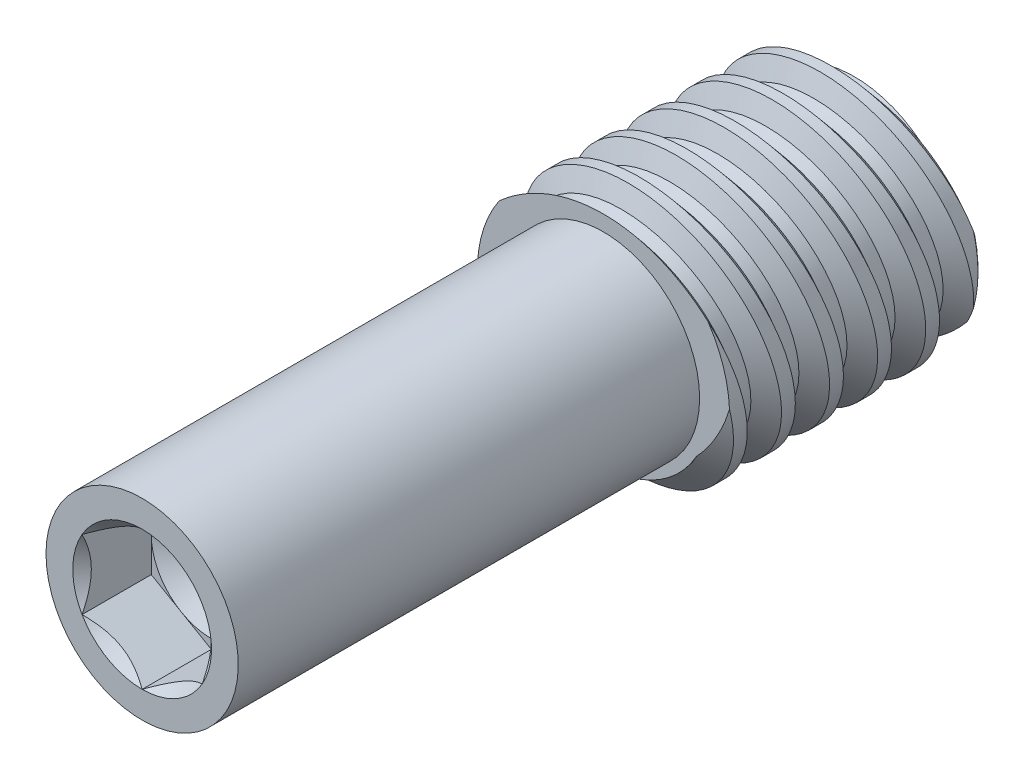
ISO-10303-21;
HEADER;
FILE_DESCRIPTION(('STEP AP214'),'2;1');
FILE_NAME('part.step','',(''),(''),'','','');
FILE_SCHEMA(('AUTOMOTIVE_DESIGN { 1 0 10303 214 1 1 1 1 }'));
ENDSEC;
DATA;
#1=APPLICATION_CONTEXT('core data for automotive mechanical design processes');
#2=APPLICATION_PROTOCOL_DEFINITION('international standard','automotive_design',2000,#1);
#3=PRODUCT_CONTEXT('',#1,'mechanical');
#4=PRODUCT('Part','Part','',(#3));
#5=PRODUCT_RELATED_PRODUCT_CATEGORY('part','',(#4));
#6=PRODUCT_DEFINITION_FORMATION('','',#4);
#7=PRODUCT_DEFINITION_CONTEXT('part definition',#1,'design');
#8=PRODUCT_DEFINITION('design','',#6,#7);
#9=PRODUCT_DEFINITION_SHAPE('','',#8);
#10=(LENGTH_UNIT() NAMED_UNIT(*) SI_UNIT(.MILLI.,.METRE.));
#11=(NAMED_UNIT(*) PLANE_ANGLE_UNIT() SI_UNIT($,.RADIAN.));
#12=(NAMED_UNIT(*) SI_UNIT($,.STERADIAN.) SOLID_ANGLE_UNIT());
#13=UNCERTAINTY_MEASURE_WITH_UNIT(LENGTH_MEASURE(1.E-05),#10,'distance_accuracy_value','');
#14=(GEOMETRIC_REPRESENTATION_CONTEXT(3) GLOBAL_UNCERTAINTY_ASSIGNED_CONTEXT((#13)) GLOBAL_UNIT_ASSIGNED_CONTEXT((#10,
#11,#12)) REPRESENTATION_CONTEXT('',''));
#15=CARTESIAN_POINT('',(0.,0.,0.));
#16=DIRECTION('',(0.,0.,1.));
#17=DIRECTION('',(1.,0.,0.));
#18=AXIS2_PLACEMENT_3D('',#15,#16,#17);
#19=CARTESIAN_POINT('',(0.,0.,-6.68194544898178));
#20=DIRECTION('',(0.,0.,1.));
#21=DIRECTION('',(0.,-1.,0.));
#22=AXIS2_PLACEMENT_3D('',#19,#20,#21);
#23=CONICAL_SURFACE('',#22,1.1049,0.78539816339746);
#24=CARTESIAN_POINT('',(-2.10914753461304,1.02583325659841,-5.44145908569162));
#25=CARTESIAN_POINT('',(-2.09759842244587,0.946744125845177,-5.48642155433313));
#26=CARTESIAN_POINT('',(-2.0836319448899,0.867644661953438,-5.5307995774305));
#27=CARTESIAN_POINT('',(-2.05038774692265,0.70910092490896,-5.61838627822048));
#28=CARTESIAN_POINT('',(-2.0310701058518,0.629658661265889,-5.66158337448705));
#29=CARTESIAN_POINT('',(-1.98606001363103,0.468632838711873,-5.74754592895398));
#30=CARTESIAN_POINT('',(-1.96017297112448,0.387068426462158,-5.79024665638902));
#31=CARTESIAN_POINT('',(-1.90184333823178,0.224993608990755,-5.87322814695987));
#32=CARTESIAN_POINT('',(-1.86939814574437,0.144483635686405,-5.91350794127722));
#33=CARTESIAN_POINT('',(-1.79746446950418,-0.014436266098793,-5.99101497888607));
#34=CARTESIAN_POINT('',(-1.75800303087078,-0.0928529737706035,-6.02825316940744));
#35=CARTESIAN_POINT('',(-1.67131300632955,-0.246821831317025,-6.09934030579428));
#36=CARTESIAN_POINT('',(-1.62409088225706,-0.322376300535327,-6.13319203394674));
#37=CARTESIAN_POINT('',(-1.51989195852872,-0.47119683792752,-6.19791007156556));
#38=CARTESIAN_POINT('',(-1.46269545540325,-0.544354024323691,-6.22867716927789));
#39=CARTESIAN_POINT('',(-1.33895238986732,-0.684344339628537,-6.28577684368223));
#40=CARTESIAN_POINT('',(-1.27240170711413,-0.751174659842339,-6.31210745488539));
#41=CARTESIAN_POINT('',(-1.12046100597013,-0.884458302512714,-6.36314568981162));
#42=CARTESIAN_POINT('',(-1.03374270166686,-0.949681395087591,-6.38717267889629));
#43=CARTESIAN_POINT('',(-0.849475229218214,-1.06513850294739,-6.42861885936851));
#44=CARTESIAN_POINT('',(-0.75194590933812,-1.11539938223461,-6.44604990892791));
#45=CARTESIAN_POINT('',(-0.585879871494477,-1.18252898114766,-6.46894206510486));
#46=CARTESIAN_POINT('',(-0.519804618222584,-1.20488583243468,-6.47644902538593));
#47=CARTESIAN_POINT('',(-0.385113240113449,-1.24166789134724,-6.48869795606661));
#48=CARTESIAN_POINT('',(-0.316492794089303,-1.25607888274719,-6.4934349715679));
#49=CARTESIAN_POINT('',(-0.247102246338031,-1.26619460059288,-6.4967647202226));
#50=B_SPLINE_CURVE_WITH_KNOTS('',3,(#24,#25,#26,#27,#28,#29,#30,#31,#32,#33,#34,#35,#36,#37,#38,
#39,#40,#41,#42,#43,#44,#45,#46,#47,#48,#49),.UNSPECIFIED.,.F.,.F.,(4,2,2,2,2,2,2,2,2,2,2,2,4),
(0.,0.275125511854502,0.552361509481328,0.839033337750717,1.12581913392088,1.41152253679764,
1.69698924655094,1.98980016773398,2.28274047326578,2.61460838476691,2.94587679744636,
3.15583756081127,3.36617276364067),.UNSPECIFIED.);
#51=CARTESIAN_POINT('',(-2.00883689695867,0.55011831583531,-5.7040454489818));
#52=VERTEX_POINT('',#51);
#53=CARTESIAN_POINT('',(-1.98796192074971,0.478336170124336,-5.74214544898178));
#54=VERTEX_POINT('',#53);
#55=EDGE_CURVE('E167',#52,#54,#50,.T.);
#56=ORIENTED_EDGE('',*,*,#55,.T.);
#57=CARTESIAN_POINT('',(0.,0.,-5.74214544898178));
#58=DIRECTION('',(0.,0.,1.));
#59=DIRECTION('',(1.,0.,0.));
#60=AXIS2_PLACEMENT_3D('',#57,#58,#59);
#61=CIRCLE('',#60,2.04470000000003);
#62=CARTESIAN_POINT('',(-1.86588803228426,-0.83621763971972,-5.74214544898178));
#63=VERTEX_POINT('',#62);
#64=EDGE_CURVE('E46',#54,#63,#61,.T.);
#65=ORIENTED_EDGE('',*,*,#64,.T.);
#66=CARTESIAN_POINT('',(2.00945671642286,-0.548609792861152,-5.70384544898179));
#67=CARTESIAN_POINT('',(1.98601485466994,-0.605721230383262,-5.71141698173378));
#68=CARTESIAN_POINT('',(1.96016319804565,-0.661827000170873,-5.71887505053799));
#69=CARTESIAN_POINT('',(1.90379483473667,-0.771682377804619,-5.73351498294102));
#70=CARTESIAN_POINT('',(1.87327805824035,-0.825431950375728,-5.74069684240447));
#71=CARTESIAN_POINT('',(1.77503386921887,-0.982513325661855,-5.76173868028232));
#72=CARTESIAN_POINT('',(1.70056124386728,-1.08180272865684,-5.77511149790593));
#73=CARTESIAN_POINT('',(1.53583057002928,-1.26633885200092,-5.80007957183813));
#74=CARTESIAN_POINT('',(1.44558353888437,-1.3515952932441,-5.81167605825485));
#75=CARTESIAN_POINT('',(1.25178014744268,-1.50561967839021,-5.83270850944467));
#76=CARTESIAN_POINT('',(1.14822908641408,-1.57439415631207,-5.84214533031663));
#77=CARTESIAN_POINT('',(0.932178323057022,-1.69257457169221,-5.85841024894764));
#78=CARTESIAN_POINT('',(0.819811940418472,-1.74221990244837,-5.86527056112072));
#79=CARTESIAN_POINT('',(0.588175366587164,-1.82186986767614,-5.87629766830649));
#80=CARTESIAN_POINT('',(0.468904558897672,-1.85187274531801,-5.88046422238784));
#81=CARTESIAN_POINT('',(0.228387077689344,-1.89104887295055,-5.88590796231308));
#82=CARTESIAN_POINT('',(0.107180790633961,-1.90046567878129,-5.8872189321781));
#83=CARTESIAN_POINT('',(-0.135094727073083,-1.89890231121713,-5.88700143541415));
#84=CARTESIAN_POINT('',(-0.256163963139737,-1.88792297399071,-5.88547308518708));
#85=CARTESIAN_POINT('',(-0.494128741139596,-1.84600918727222,-5.87965007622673));
#86=CARTESIAN_POINT('',(-0.611041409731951,-1.81516999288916,-5.87536862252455));
#87=CARTESIAN_POINT('',(-0.837995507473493,-1.7345736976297,-5.86421374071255));
#88=CARTESIAN_POINT('',(-0.948037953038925,-1.68481940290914,-5.85734069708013));
#89=CARTESIAN_POINT('',(-1.15870108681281,-1.56761437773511,-5.84121476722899));
#90=CARTESIAN_POINT('',(-1.25927834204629,-1.50008700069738,-5.83195157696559));
#91=CARTESIAN_POINT('',(-1.44775549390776,-1.34941970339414,-5.81138047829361));
#92=CARTESIAN_POINT('',(-1.5356503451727,-1.26627359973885,-5.8000717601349));
#93=CARTESIAN_POINT('',(-1.6989138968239,-1.08391604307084,-5.7753964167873));
#94=CARTESIAN_POINT('',(-1.77381306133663,-0.984288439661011,-5.76197710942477));
#95=CARTESIAN_POINT('',(-1.87259505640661,-0.826611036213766,-5.74085446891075));
#96=CARTESIAN_POINT('',(-1.9032772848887,-0.772640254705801,-5.73364280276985));
#97=CARTESIAN_POINT('',(-1.95993528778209,-0.662321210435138,-5.71894074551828));
#98=CARTESIAN_POINT('',(-1.98591125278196,-0.605973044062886,-5.71145036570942));
#99=CARTESIAN_POINT('',(-2.00945671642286,-0.548609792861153,-5.70384544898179));
#100=B_SPLINE_CURVE_WITH_KNOTS('',3,(#66,#67,#68,#69,#70,#71,#72,#73,#74,#75,#76,#77,#78,#79,
#80,#81,#82,#83,#84,#85,#86,#87,#88,#89,#90,#91,#92,#93,#94,#95,#96,#97,#98,#99),.UNSPECIFIED.,
.F.,.F.,(4,2,2,2,2,2,2,2,2,2,2,2,2,2,2,2,4),(0.,0.186480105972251,0.372963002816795,
0.745525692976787,1.11782920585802,1.48998487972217,1.85731892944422,2.22468582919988,
2.58768230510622,2.95066389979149,3.31191734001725,3.67311720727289,4.0359010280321,
4.39882877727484,4.7729417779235,4.96024978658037,5.14755020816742),.UNSPECIFIED.);
#101=CARTESIAN_POINT('',(-2.00883689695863,-0.550118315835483,-5.70404544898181));
#102=VERTEX_POINT('',#101);
#103=EDGE_CURVE('E346',#63,#102,#100,.T.);
#104=ORIENTED_EDGE('',*,*,#103,.T.);
#105=CARTESIAN_POINT('',(0.,0.,-5.7040454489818));
#106=DIRECTION('',(0.,0.,1.));
#107=DIRECTION('',(0.,-1.,0.));
#108=AXIS2_PLACEMENT_3D('',#105,#106,#107);
#109=CIRCLE('',#108,2.08280000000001);
#110=EDGE_CURVE('E370',#52,#102,#109,.T.);
#111=ORIENTED_EDGE('',*,*,#110,.F.);
#112=EDGE_LOOP('',(#56,#65,#104,#111));
#113=FACE_BOUND('',#112,.T.);
#114=ADVANCED_FACE('F31',(#113),#23,.T.);
#115=CARTESIAN_POINT('',(0.,0.,-6.01805455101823));
#116=DIRECTION('',(0.,0.,1.));
#117=DIRECTION('',(0.,-1.,0.));
#118=AXIS2_PLACEMENT_3D('',#115,#116,#117);
#119=CYLINDRICAL_SURFACE('',#118,2.08280000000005);
#120=CARTESIAN_POINT('',(-1.69813036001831,-1.20598885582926,-1.87736316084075));
#121=CARTESIAN_POINT('',(-1.76703077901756,-1.10896229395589,-1.85592999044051));
#122=CARTESIAN_POINT('',(-1.82753911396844,-1.00610004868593,-1.8333978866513));
#123=CARTESIAN_POINT('',(-1.93012009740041,-0.791737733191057,-1.78691176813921));
#124=CARTESIAN_POINT('',(-1.97216659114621,-0.680225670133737,-1.76295579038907));
#125=CARTESIAN_POINT('',(-2.03668137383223,-0.45174665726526,-1.71437923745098));
#126=CARTESIAN_POINT('',(-2.0591409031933,-0.334777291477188,-1.68975836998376));
#127=CARTESIAN_POINT('',(-2.08383879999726,-0.0987461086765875,-1.64058878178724));
#128=CARTESIAN_POINT('',(-2.08608274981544,0.0203151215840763,-1.61604004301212));
#129=CARTESIAN_POINT('',(-2.07019997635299,0.258141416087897,-1.5674924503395));
#130=CARTESIAN_POINT('',(-2.05191809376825,0.376897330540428,-1.543499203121));
#131=CARTESIAN_POINT('',(-1.99514368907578,0.609770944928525,-1.49689188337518));
#132=CARTESIAN_POINT('',(-1.95665035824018,0.723888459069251,-1.47427786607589));
#133=CARTESIAN_POINT('',(-1.86073524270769,0.943382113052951,-1.43115135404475));
#134=CARTESIAN_POINT('',(-1.80343953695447,1.04881077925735,-1.41062602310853));
#135=CARTESIAN_POINT('',(-1.67135740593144,1.24858112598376,-1.37201926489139));
#136=CARTESIAN_POINT('',(-1.59657242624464,1.3429237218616,-1.35393763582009));
#137=CARTESIAN_POINT('',(-1.43286626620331,1.51622441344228,-1.32092501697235));
#138=CARTESIAN_POINT('',(-1.34418444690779,1.59540002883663,-1.30594917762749));
#139=CARTESIAN_POINT('',(-1.15434314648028,1.73770411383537,-1.27915846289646));
#140=CARTESIAN_POINT('',(-1.05318494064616,1.80083422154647,-1.26734326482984));
#141=CARTESIAN_POINT('',(-0.843184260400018,1.90807552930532,-1.24733806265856));
#142=CARTESIAN_POINT('',(-0.734508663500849,1.95250235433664,-1.23908782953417));
#143=CARTESIAN_POINT('',(-0.511051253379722,2.02252014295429,-1.22610907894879));
#144=CARTESIAN_POINT('',(-0.396269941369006,2.04811265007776,-1.22138027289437));
#145=CARTESIAN_POINT('',(-0.165477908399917,2.07943686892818,-1.21559487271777));
#146=CARTESIAN_POINT('',(-0.0495030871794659,2.08542480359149,-1.21449090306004));
#147=CARTESIAN_POINT('',(0.181808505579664,2.07807356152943,-1.21584749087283));
#148=CARTESIAN_POINT('',(0.297145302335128,2.06473515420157,-1.21830790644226));
#149=CARTESIAN_POINT('',(0.523380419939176,2.0192532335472,-1.22671688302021));
#150=CARTESIAN_POINT('',(0.634296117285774,1.98719316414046,-1.2326499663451));
#151=CARTESIAN_POINT('',(0.849122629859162,1.90532429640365,-1.24785531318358));
#152=CARTESIAN_POINT('',(0.953033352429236,1.85551526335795,-1.25712762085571));
#153=CARTESIAN_POINT('',(1.15154377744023,1.73933923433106,-1.27885975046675));
#154=CARTESIAN_POINT('',(1.24608939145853,1.67288308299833,-1.29133674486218));
#155=CARTESIAN_POINT('',(1.42267878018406,1.52553837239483,-1.31916881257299));
#156=CARTESIAN_POINT('',(1.50472182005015,1.44464896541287,-1.33452405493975));
#157=CARTESIAN_POINT('',(1.65519539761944,1.26960027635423,-1.36799228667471));
#158=CARTESIAN_POINT('',(1.72342561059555,1.17527547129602,-1.38613994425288));
#159=CARTESIAN_POINT('',(1.84311649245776,0.976932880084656,-1.42461576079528));
#160=CARTESIAN_POINT('',(1.89457569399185,0.872914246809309,-1.44494411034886));
#161=CARTESIAN_POINT('',(1.98021369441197,0.656214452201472,-1.48767807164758));
#162=CARTESIAN_POINT('',(2.01407489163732,0.543413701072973,-1.51011376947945));
#163=CARTESIAN_POINT('',(2.06233639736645,0.313962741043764,-1.55619977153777));
#164=CARTESIAN_POINT('',(2.0767349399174,0.19731218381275,-1.57985018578));
#165=CARTESIAN_POINT('',(2.08583392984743,-0.0384193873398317,-1.62812952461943));
#166=CARTESIAN_POINT('',(2.08022985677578,-0.157510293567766,-1.65276788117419));
#167=CARTESIAN_POINT('',(2.04883112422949,-0.393015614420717,-1.70199430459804));
#168=CARTESIAN_POINT('',(2.02303525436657,-0.509429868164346,-1.72658236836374));
#169=CARTESIAN_POINT('',(1.95170305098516,-0.737036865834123,-1.7751363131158));
#170=CARTESIAN_POINT('',(1.90604243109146,-0.848191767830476,-1.79909725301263));
#171=CARTESIAN_POINT('',(1.79614407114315,-1.06126848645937,-1.84545895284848));
#172=CARTESIAN_POINT('',(1.73190662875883,-1.16319045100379,-1.86785973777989));
#173=CARTESIAN_POINT('',(1.58710514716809,-1.35402726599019,-1.91015152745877));
#174=CARTESIAN_POINT('',(1.50666930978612,-1.4430353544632,-1.9300603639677));
#175=CARTESIAN_POINT('',(1.33133868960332,-1.60621602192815,-1.96681247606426));
#176=CARTESIAN_POINT('',(1.23644548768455,-1.68039022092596,-1.98365608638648));
#177=CARTESIAN_POINT('',(1.03696402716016,-1.81014536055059,-2.0132782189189));
#178=CARTESIAN_POINT('',(0.932616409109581,-1.86607859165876,-2.02613349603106));
#179=CARTESIAN_POINT('',(0.715593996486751,-1.95957505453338,-2.04769757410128));
#180=CARTESIAN_POINT('',(0.602920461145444,-1.99714105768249,-2.05640700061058));
#181=CARTESIAN_POINT('',(0.375357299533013,-2.05195809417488,-2.0691373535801));
#182=CARTESIAN_POINT('',(0.260585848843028,-2.06967526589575,-2.07326583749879));
#183=CARTESIAN_POINT('',(0.0296303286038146,-2.08580279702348,-2.07702333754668));
#184=CARTESIAN_POINT('',(-0.0865535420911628,-2.08421584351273,-2.07665297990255));
#185=CARTESIAN_POINT('',(-0.315353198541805,-2.06195067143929,-2.07146700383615));
#186=CARTESIAN_POINT('',(-0.427996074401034,-2.04153499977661,-2.06671251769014));
#187=CARTESIAN_POINT('',(-0.648218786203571,-1.98264006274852,-2.05304591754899));
#188=CARTESIAN_POINT('',(-0.755797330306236,-1.94415621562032,-2.04413274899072));
#189=CARTESIAN_POINT('',(-0.963453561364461,-1.85010262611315,-2.02246081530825));
#190=CARTESIAN_POINT('',(-1.06348890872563,-1.79444425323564,-2.00968210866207));
#191=CARTESIAN_POINT('',(-1.25270971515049,-1.66784506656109,-1.98080678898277));
#192=CARTESIAN_POINT('',(-1.34190688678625,-1.59692098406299,-1.9647138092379));
#193=CARTESIAN_POINT('',(-1.47535298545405,-1.4718184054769,-1.93654646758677));
#194=CARTESIAN_POINT('',(-1.52367705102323,-1.42171942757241,-1.92531338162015));
#195=CARTESIAN_POINT('',(-1.61499377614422,-1.31707023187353,-1.9019655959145));
#196=CARTESIAN_POINT('',(-1.6579864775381,-1.26252004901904,-1.88985090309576));
#197=CARTESIAN_POINT('',(-1.69813036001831,-1.20598885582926,-1.87736316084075));
#198=B_SPLINE_CURVE_WITH_KNOTS('',3,(#120,#121,#122,#123,#124,#125,#126,#127,#128,#129,#130,
#131,#132,#133,#134,#135,#136,#137,#138,#139,#140,#141,#142,#143,#144,#145,#146,#147,#148,#149,
#150,#151,#152,#153,#154,#155,#156,#157,#158,#159,#160,#161,#162,#163,#164,#165,#166,#167,#168,
#169,#170,#171,#172,#173,#174,#175,#176,#177,#178,#179,#180,#181,#182,#183,#184,#185,#186,#187,
#188,#189,#190,#191,#192,#193,#194,#195,#196,#197),.UNSPECIFIED.,.T.,.F.,(4,2,2,2,2,2,2,2,2,2,2,
2,2,2,2,2,2,2,2,2,2,2,2,2,2,2,2,2,2,2,2,2,2,2,2,2,2,2,4),(0.,0.362490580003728,0.72549305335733,
1.08865778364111,1.45172222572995,1.81754973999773,2.18339189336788,2.5468293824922,
2.91023684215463,3.26796109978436,3.62564882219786,3.97703171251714,4.32838580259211,
4.67512912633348,5.02185864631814,5.36705443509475,5.71225478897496,6.0593449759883,
6.40645555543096,6.75828727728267,7.11014977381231,7.46815944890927,7.82620160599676,
8.18971770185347,8.55325559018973,8.91910146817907,9.28494148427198,9.64799246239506,
10.0110037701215,10.3665196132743,10.7219817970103,11.0689087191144,11.4157873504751,
11.7579010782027,12.1001016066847,12.444098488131,12.7877202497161,12.9989220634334,
13.2101222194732),.UNSPECIFIED.);
#199=CARTESIAN_POINT('',(2.08087913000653,0.0894309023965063,-1.60194544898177));
#200=VERTEX_POINT('',#199);
#201=CARTESIAN_POINT('',(-2.08087913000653,0.0894309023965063,-1.60194544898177));
#202=VERTEX_POINT('',#201);
#203=EDGE_CURVE('E273',#200,#202,#198,.T.);
#204=ORIENTED_EDGE('',*,*,#203,.T.);
#205=CARTESIAN_POINT('',(0.,0.,-1.60194544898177));
#206=DIRECTION('',(0.,0.,-1.));
#207=DIRECTION('',(-1.,0.,0.));
#208=AXIS2_PLACEMENT_3D('',#205,#206,#207);
#209=CIRCLE('',#208,2.08280000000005);
#210=CARTESIAN_POINT('',(-1.72551023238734,1.16647772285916,-1.60194544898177));
#211=VERTEX_POINT('',#210);
#212=EDGE_CURVE('E392',#202,#211,#209,.T.);
#213=ORIENTED_EDGE('',*,*,#212,.T.);
#214=CARTESIAN_POINT('',(-1.69231898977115,-1.21413025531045,-2.09189237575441));
#215=CARTESIAN_POINT('',(-1.62429087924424,-1.30894300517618,-2.11015351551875));
#216=CARTESIAN_POINT('',(-1.54812029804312,-1.39824425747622,-2.1272189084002));
#217=CARTESIAN_POINT('',(-1.38150690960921,-1.56309122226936,-2.15854179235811));
#218=CARTESIAN_POINT('',(-1.29104927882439,-1.63862247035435,-2.17279633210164));
#219=CARTESIAN_POINT('',(-1.09854411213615,-1.77342483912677,-2.19812549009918));
#220=CARTESIAN_POINT('',(-0.996515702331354,-1.83272225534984,-2.20920525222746));
#221=CARTESIAN_POINT('',(-0.783681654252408,-1.93332616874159,-2.22794694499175));
#222=CARTESIAN_POINT('',(-0.672878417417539,-1.97463756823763,-2.23560980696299));
#223=CARTESIAN_POINT('',(-0.447457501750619,-2.03747833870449,-2.24724778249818));
#224=CARTESIAN_POINT('',(-0.332924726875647,-2.05930225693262,-2.25127781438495));
#225=CARTESIAN_POINT('',(-0.101754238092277,-2.08355636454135,-2.25575583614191));
#226=CARTESIAN_POINT('',(0.0148834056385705,-2.0859871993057,-2.25620394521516));
#227=CARTESIAN_POINT('',(0.245922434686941,-2.07144044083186,-2.25351909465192));
#228=CARTESIAN_POINT('',(0.360334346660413,-2.05462382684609,-2.2504158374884));
#229=CARTESIAN_POINT('',(0.584667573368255,-2.00236948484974,-2.24074860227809));
#230=CARTESIAN_POINT('',(0.694588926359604,-1.96693191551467,-2.23418465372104));
#231=CARTESIAN_POINT('',(0.907027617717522,-1.87846115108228,-2.21773465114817));
#232=CARTESIAN_POINT('',(1.00953365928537,-1.82540177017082,-2.20784365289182));
#233=CARTESIAN_POINT('',(1.20415568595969,-1.70330944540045,-2.18496788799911));
#234=CARTESIAN_POINT('',(1.2962712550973,-1.6342758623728,-2.17198299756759));
#235=CARTESIAN_POINT('',(1.46858186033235,-1.48146034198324,-2.14305878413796));
#236=CARTESIAN_POINT('',(1.54863914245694,-1.39752882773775,-2.12708940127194));
#237=CARTESIAN_POINT('',(1.6935544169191,-1.21788782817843,-2.0926556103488));
#238=CARTESIAN_POINT('',(1.75841120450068,-1.12217741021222,-2.07419100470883));
#239=CARTESIAN_POINT('',(1.87223750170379,-0.920031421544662,-2.03486600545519));
#240=CARTESIAN_POINT('',(1.92092651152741,-0.813444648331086,-2.01397103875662));
#241=CARTESIAN_POINT('',(1.99972685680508,-0.593928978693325,-1.97053757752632));
#242=CARTESIAN_POINT('',(2.02983646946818,-0.480999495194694,-1.94799893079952));
#243=CARTESIAN_POINT('',(2.07112862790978,-0.249967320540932,-1.90143514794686));
#244=CARTESIAN_POINT('',(2.08198094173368,-0.13180933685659,-1.87739126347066));
#245=CARTESIAN_POINT('',(2.08352979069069,0.104538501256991,-1.82880209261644));
#246=CARTESIAN_POINT('',(2.07422476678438,0.22272835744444,-1.8042567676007));
#247=CARTESIAN_POINT('',(2.03552264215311,0.457125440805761,-1.75507930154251));
#248=CARTESIAN_POINT('',(2.0059100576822,0.573297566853,-1.73044907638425));
#249=CARTESIAN_POINT('',(1.92714715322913,0.799030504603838,-1.68211419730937));
#250=CARTESIAN_POINT('',(1.8779964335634,0.908591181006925,-1.65840956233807));
#251=CARTESIAN_POINT('',(1.76152649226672,1.11775929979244,-1.61273803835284));
#252=CARTESIAN_POINT('',(1.69423637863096,1.21738234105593,-1.5907684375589));
#253=CARTESIAN_POINT('',(1.54322721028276,1.40388698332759,-1.54930693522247));
#254=CARTESIAN_POINT('',(1.45950935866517,1.49076951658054,-1.52981485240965));
#255=CARTESIAN_POINT('',(1.27939684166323,1.64780020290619,-1.49434993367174));
#256=CARTESIAN_POINT('',(1.18322661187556,1.71819402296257,-1.47832574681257));
#257=CARTESIAN_POINT('',(0.979884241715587,1.84174625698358,-1.45006082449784));
#258=CARTESIAN_POINT('',(0.872713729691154,1.89490721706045,-1.4378195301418));
#259=CARTESIAN_POINT('',(0.653207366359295,1.98114702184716,-1.41789765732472));
#260=CARTESIAN_POINT('',(0.541060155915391,2.01468220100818,-1.41011354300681));
#261=CARTESIAN_POINT('',(0.312526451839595,2.06252435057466,-1.39899368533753));
#262=CARTESIAN_POINT('',(0.196140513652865,2.07683383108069,-1.39565736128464));
#263=CARTESIAN_POINT('',(-0.0351509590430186,2.08565469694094,-1.39360171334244));
#264=CARTESIAN_POINT('',(-0.150041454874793,2.08054449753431,-1.39479414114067));
#265=CARTESIAN_POINT('',(-0.377289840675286,2.05154275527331,-1.40154635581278));
#266=CARTESIAN_POINT('',(-0.489647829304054,2.02765194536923,-1.40710597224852));
#267=CARTESIAN_POINT('',(-0.708331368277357,1.96196825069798,-1.42233169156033));
#268=CARTESIAN_POINT('',(-0.814673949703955,1.92022910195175,-1.4319854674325));
#269=CARTESIAN_POINT('',(-1.01880591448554,1.82016859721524,-1.45500325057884));
#270=CARTESIAN_POINT('',(-1.11659476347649,1.7618462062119,-1.46836748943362));
#271=CARTESIAN_POINT('',(-1.30244110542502,1.6293912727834,-1.49851383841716));
#272=CARTESIAN_POINT('',(-1.39033280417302,1.55503712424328,-1.51534368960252));
#273=CARTESIAN_POINT('',(-1.55244209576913,1.39323342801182,-1.55167366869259));
#274=CARTESIAN_POINT('',(-1.6266580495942,1.3057823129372,-1.57117411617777));
#275=CARTESIAN_POINT('',(-1.76118071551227,1.11801206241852,-1.61267056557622));
#276=CARTESIAN_POINT('',(-1.8211138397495,1.01743594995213,-1.63471496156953));
#277=CARTESIAN_POINT('',(-1.92324460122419,0.807941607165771,-1.68018254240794));
#278=CARTESIAN_POINT('',(-1.96544089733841,0.699022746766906,-1.70360583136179));
#279=CARTESIAN_POINT('',(-2.03171846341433,0.473558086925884,-1.75160206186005));
#280=CARTESIAN_POINT('',(-2.05541831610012,0.356902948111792,-1.77618865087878));
#281=CARTESIAN_POINT('',(-2.08265128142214,0.121221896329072,-1.82534871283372));
#282=CARTESIAN_POINT('',(-2.08617816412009,0.00219526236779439,-1.84992217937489));
#283=CARTESIAN_POINT('',(-2.07286441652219,-0.235838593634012,-1.89857383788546));
#284=CARTESIAN_POINT('',(-2.05585557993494,-0.354837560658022,-1.92264627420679));
#285=CARTESIAN_POINT('',(-2.00157260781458,-0.588295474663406,-1.96942610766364));
#286=CARTESIAN_POINT('',(-1.96432331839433,-0.702759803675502,-1.99213514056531));
#287=CARTESIAN_POINT('',(-1.88753910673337,-0.883822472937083,-2.02775040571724));
#288=CARTESIAN_POINT('',(-1.85369139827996,-0.952774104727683,-2.04123423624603));
#289=CARTESIAN_POINT('',(-1.77851626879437,-1.08665984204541,-2.06728290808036));
#290=CARTESIAN_POINT('',(-1.73718878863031,-1.15159391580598,-2.0798477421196));
#291=CARTESIAN_POINT('',(-1.69231898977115,-1.21413025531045,-2.09189237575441));
#292=B_SPLINE_CURVE_WITH_KNOTS('',3,(#214,#215,#216,#217,#218,#219,#220,#221,#222,#223,#224,
#225,#226,#227,#228,#229,#230,#231,#232,#233,#234,#235,#236,#237,#238,#239,#240,#241,#242,#243,
#244,#245,#246,#247,#248,#249,#250,#251,#252,#253,#254,#255,#256,#257,#258,#259,#260,#261,#262,
#263,#264,#265,#266,#267,#268,#269,#270,#271,#272,#273,#274,#275,#276,#277,#278,#279,#280,#281,
#282,#283,#284,#285,#286,#287,#288,#289,#290,#291),.UNSPECIFIED.,.T.,.F.,(4,2,2,2,2,2,2,2,2,2,2,
2,2,2,2,2,2,2,2,2,2,2,2,2,2,2,2,2,2,2,2,2,2,2,2,2,2,2,4),(0.,0.35405812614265,0.708486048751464,
1.0623364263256,1.4160902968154,1.76440206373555,2.11270223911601,2.45811050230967,
2.80351582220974,3.14943672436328,3.49537147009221,3.84499919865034,4.19465462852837,
4.5500929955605,4.90556431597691,5.26707455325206,5.62861275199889,5.99404783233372,
6.35949038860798,6.72434998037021,7.08918286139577,7.44817426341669,7.80711260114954,
8.15733427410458,8.50751021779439,8.8508978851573,9.19427215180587,9.53661982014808,
9.87898886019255,10.2264344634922,10.5739216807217,10.9296892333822,11.2854836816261,
11.648434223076,12.0114968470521,12.3775535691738,12.7431619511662,12.9766888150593,
13.2102175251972),.UNSPECIFIED.);
#293=CARTESIAN_POINT('',(1.72551023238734,1.16647772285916,-1.60194544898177));
#294=VERTEX_POINT('',#293);
#295=EDGE_CURVE('E262',#211,#294,#292,.T.);
#296=ORIENTED_EDGE('',*,*,#295,.T.);
#297=EDGE_CURVE('E389',#294,#200,#209,.T.);
#298=ORIENTED_EDGE('',*,*,#297,.T.);
#299=EDGE_LOOP('',(#204,#213,#296,#298));
#300=FACE_BOUND('',#299,.T.);
#301=ADVANCED_FACE('F214',(#300),#119,.T.);
#302=CARTESIAN_POINT('',(-1.69813036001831,-1.20598885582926,-2.67111316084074));
#303=CARTESIAN_POINT('',(-1.76703077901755,-1.10896229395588,-2.64967999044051));
#304=CARTESIAN_POINT('',(-1.82753911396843,-1.00610004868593,-2.6271478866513));
#305=CARTESIAN_POINT('',(-1.93012009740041,-0.791737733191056,-2.58066176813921));
#306=CARTESIAN_POINT('',(-1.97216659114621,-0.680225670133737,-2.55670579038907));
#307=CARTESIAN_POINT('',(-2.03668137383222,-0.45174665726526,-2.50812923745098));
#308=CARTESIAN_POINT('',(-2.0591409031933,-0.334777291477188,-2.48350836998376));
#309=CARTESIAN_POINT('',(-2.08383879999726,-0.0987461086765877,-2.43433878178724));
#310=CARTESIAN_POINT('',(-2.08608274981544,0.020315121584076,-2.40979004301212));
#311=CARTESIAN_POINT('',(-2.07019997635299,0.258141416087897,-2.3612424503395));
#312=CARTESIAN_POINT('',(-2.05191809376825,0.376897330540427,-2.337249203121));
#313=CARTESIAN_POINT('',(-1.99514368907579,0.609770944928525,-2.29064188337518));
#314=CARTESIAN_POINT('',(-1.95665035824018,0.723888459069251,-2.26802786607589));
#315=CARTESIAN_POINT('',(-1.86073524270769,0.943382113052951,-2.22490135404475));
#316=CARTESIAN_POINT('',(-1.80343953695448,1.04881077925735,-2.20437602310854));
#317=CARTESIAN_POINT('',(-1.67135740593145,1.24858112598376,-2.16576926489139));
#318=CARTESIAN_POINT('',(-1.59657242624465,1.3429237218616,-2.14768763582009));
#319=CARTESIAN_POINT('',(-1.43286626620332,1.51622441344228,-2.11467501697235));
#320=CARTESIAN_POINT('',(-1.3441844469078,1.59540002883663,-2.0996991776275));
#321=CARTESIAN_POINT('',(-1.15434314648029,1.73770411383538,-2.07290846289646));
#322=CARTESIAN_POINT('',(-1.05318494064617,1.80083422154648,-2.06109326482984));
#323=CARTESIAN_POINT('',(-0.843184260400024,1.90807552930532,-2.04108806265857));
#324=CARTESIAN_POINT('',(-0.734508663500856,1.95250235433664,-2.03283782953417));
#325=CARTESIAN_POINT('',(-0.511051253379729,2.02252014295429,-2.01985907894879));
#326=CARTESIAN_POINT('',(-0.396269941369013,2.04811265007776,-2.01513027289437));
#327=CARTESIAN_POINT('',(-0.165477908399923,2.07943686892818,-2.00934487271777));
#328=CARTESIAN_POINT('',(-0.0495030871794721,2.0854248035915,-2.00824090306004));
#329=CARTESIAN_POINT('',(0.181808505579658,2.07807356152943,-2.00959749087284));
#330=CARTESIAN_POINT('',(0.297145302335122,2.06473515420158,-2.01205790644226));
#331=CARTESIAN_POINT('',(0.523380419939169,2.0192532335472,-2.02046688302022));
#332=CARTESIAN_POINT('',(0.634296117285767,1.98719316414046,-2.0263999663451));
#333=CARTESIAN_POINT('',(0.849122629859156,1.90532429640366,-2.04160531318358));
#334=CARTESIAN_POINT('',(0.95303335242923,1.85551526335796,-2.05087762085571));
#335=CARTESIAN_POINT('',(1.15154377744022,1.73933923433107,-2.07260975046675));
#336=CARTESIAN_POINT('',(1.24608939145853,1.67288308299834,-2.08508674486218));
#337=CARTESIAN_POINT('',(1.42267878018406,1.52553837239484,-2.11291881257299));
#338=CARTESIAN_POINT('',(1.50472182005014,1.44464896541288,-2.12827405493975));
#339=CARTESIAN_POINT('',(1.65519539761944,1.26960027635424,-2.16174228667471));
#340=CARTESIAN_POINT('',(1.72342561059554,1.17527547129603,-2.17988994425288));
#341=CARTESIAN_POINT('',(1.84311649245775,0.976932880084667,-2.21836576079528));
#342=CARTESIAN_POINT('',(1.89457569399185,0.87291424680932,-2.23869411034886));
#343=CARTESIAN_POINT('',(1.98021369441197,0.656214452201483,-2.28142807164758));
#344=CARTESIAN_POINT('',(2.01407489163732,0.543413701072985,-2.30386376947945));
#345=CARTESIAN_POINT('',(2.06233639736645,0.313962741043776,-2.34994977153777));
#346=CARTESIAN_POINT('',(2.0767349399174,0.197312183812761,-2.37360018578));
#347=CARTESIAN_POINT('',(2.08583392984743,-0.0384193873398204,-2.42187952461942));
#348=CARTESIAN_POINT('',(2.08022985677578,-0.157510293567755,-2.44651788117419));
#349=CARTESIAN_POINT('',(2.04883112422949,-0.393015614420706,-2.49574430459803));
#350=CARTESIAN_POINT('',(2.02303525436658,-0.509429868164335,-2.52033236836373));
#351=CARTESIAN_POINT('',(1.95170305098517,-0.737036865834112,-2.56888631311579));
#352=CARTESIAN_POINT('',(1.90604243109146,-0.848191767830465,-2.59284725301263));
#353=CARTESIAN_POINT('',(1.79614407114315,-1.06126848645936,-2.63920895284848));
#354=CARTESIAN_POINT('',(1.73190662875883,-1.16319045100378,-2.66160973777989));
#355=CARTESIAN_POINT('',(1.5871051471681,-1.35402726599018,-2.70390152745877));
#356=CARTESIAN_POINT('',(1.50666930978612,-1.44303535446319,-2.7238103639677));
#357=CARTESIAN_POINT('',(1.33133868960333,-1.60621602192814,-2.76056247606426));
#358=CARTESIAN_POINT('',(1.23644548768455,-1.68039022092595,-2.77740608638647));
#359=CARTESIAN_POINT('',(1.03696402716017,-1.81014536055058,-2.8070282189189));
#360=CARTESIAN_POINT('',(0.932616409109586,-1.86607859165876,-2.81988349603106));
#361=CARTESIAN_POINT('',(0.715593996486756,-1.95957505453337,-2.84144757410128));
#362=CARTESIAN_POINT('',(0.60292046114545,-1.99714105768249,-2.85015700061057));
#363=CARTESIAN_POINT('',(0.375357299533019,-2.05195809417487,-2.86288735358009));
#364=CARTESIAN_POINT('',(0.260585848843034,-2.06967526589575,-2.86701583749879));
#365=CARTESIAN_POINT('',(0.0296303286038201,-2.08580279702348,-2.87077333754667));
#366=CARTESIAN_POINT('',(-0.0865535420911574,-2.08421584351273,-2.87040297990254));
#367=CARTESIAN_POINT('',(-0.3153531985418,-2.06195067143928,-2.86521700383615));
#368=CARTESIAN_POINT('',(-0.42799607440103,-2.04153499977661,-2.86046251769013));
#369=CARTESIAN_POINT('',(-0.648218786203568,-1.98264006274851,-2.84679591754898));
#370=CARTESIAN_POINT('',(-0.755797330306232,-1.94415621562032,-2.83788274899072));
#371=CARTESIAN_POINT('',(-0.963453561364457,-1.85010262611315,-2.81621081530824));
#372=CARTESIAN_POINT('',(-1.06348890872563,-1.79444425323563,-2.80343210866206));
#373=CARTESIAN_POINT('',(-1.25270971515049,-1.66784506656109,-2.77455678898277));
#374=CARTESIAN_POINT('',(-1.34190688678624,-1.59692098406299,-2.7584638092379));
#375=CARTESIAN_POINT('',(-1.47535298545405,-1.47181840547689,-2.73029646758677));
#376=CARTESIAN_POINT('',(-1.52367705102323,-1.42171942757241,-2.71906338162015));
#377=CARTESIAN_POINT('',(-1.61499377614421,-1.31707023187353,-2.6957155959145));
#378=CARTESIAN_POINT('',(-1.6579864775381,-1.26252004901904,-2.68360090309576));
#379=CARTESIAN_POINT('',(-1.69813036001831,-1.20598885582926,-2.67111316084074));
#380=B_SPLINE_CURVE_WITH_KNOTS('',3,(#302,#303,#304,#305,#306,#307,#308,#309,#310,#311,#312,
#313,#314,#315,#316,#317,#318,#319,#320,#321,#322,#323,#324,#325,#326,#327,#328,#329,#330,#331,
#332,#333,#334,#335,#336,#337,#338,#339,#340,#341,#342,#343,#344,#345,#346,#347,#348,#349,#350,
#351,#352,#353,#354,#355,#356,#357,#358,#359,#360,#361,#362,#363,#364,#365,#366,#367,#368,#369,
#370,#371,#372,#373,#374,#375,#376,#377,#378,#379),.UNSPECIFIED.,.T.,.F.,(4,2,2,2,2,2,2,2,2,2,2,
2,2,2,2,2,2,2,2,2,2,2,2,2,2,2,2,2,2,2,2,2,2,2,2,2,2,2,4),(0.,0.362490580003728,0.72549305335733,
1.08865778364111,1.45172222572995,1.81754973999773,2.18339189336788,2.54682938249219,
2.91023684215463,3.26796109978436,3.62564882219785,3.97703171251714,4.32838580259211,
4.67512912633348,5.02185864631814,5.36705443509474,5.71225478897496,6.05934497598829,
6.40645555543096,6.75828727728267,7.11014977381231,7.46815944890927,7.82620160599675,
8.18971770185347,8.55325559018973,8.91910146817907,9.28494148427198,9.64799246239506,
10.0110037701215,10.3665196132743,10.7219817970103,11.0689087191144,11.4157873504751,
11.7579010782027,12.1001016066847,12.444098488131,12.7877202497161,12.9989220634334,
13.2101222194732),.UNSPECIFIED.);
#381=CARTESIAN_POINT('',(-1.69813036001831,-1.20598885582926,-2.67111316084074));
#382=VERTEX_POINT('',#381);
#383=EDGE_CURVE('E267',#382,#382,#380,.T.);
#384=ORIENTED_EDGE('',*,*,#383,.T.);
#385=EDGE_LOOP('',(#384));
#386=FACE_BOUND('',#385,.T.);
#387=CARTESIAN_POINT('',(-1.69231898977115,-1.21413025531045,-2.88564237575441));
#388=CARTESIAN_POINT('',(-1.62429087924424,-1.30894300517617,-2.90390351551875));
#389=CARTESIAN_POINT('',(-1.54812029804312,-1.39824425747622,-2.9209689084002));
#390=CARTESIAN_POINT('',(-1.38150690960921,-1.56309122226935,-2.95229179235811));
#391=CARTESIAN_POINT('',(-1.29104927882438,-1.63862247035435,-2.96654633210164));
#392=CARTESIAN_POINT('',(-1.09854411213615,-1.77342483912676,-2.99187549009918));
#393=CARTESIAN_POINT('',(-0.996515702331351,-1.83272225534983,-3.00295525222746));
#394=CARTESIAN_POINT('',(-0.783681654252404,-1.93332616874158,-3.02169694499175));
#395=CARTESIAN_POINT('',(-0.672878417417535,-1.97463756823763,-3.029359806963));
#396=CARTESIAN_POINT('',(-0.447457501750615,-2.03747833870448,-3.04099778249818));
#397=CARTESIAN_POINT('',(-0.332924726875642,-2.05930225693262,-3.04502781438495));
#398=CARTESIAN_POINT('',(-0.101754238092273,-2.08355636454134,-3.04950583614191));
#399=CARTESIAN_POINT('',(0.0148834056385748,-2.08598719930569,-3.04995394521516));
#400=CARTESIAN_POINT('',(0.245922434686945,-2.07144044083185,-3.04726909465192));
#401=CARTESIAN_POINT('',(0.360334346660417,-2.05462382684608,-3.0441658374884));
#402=CARTESIAN_POINT('',(0.584667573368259,-2.00236948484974,-3.0344986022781));
#403=CARTESIAN_POINT('',(0.694588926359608,-1.96693191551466,-3.02793465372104));
#404=CARTESIAN_POINT('',(0.907027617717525,-1.87846115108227,-3.01148465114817));
#405=CARTESIAN_POINT('',(1.00953365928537,-1.82540177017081,-3.00159365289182));
#406=CARTESIAN_POINT('',(1.20415568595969,-1.70330944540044,-2.97871788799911));
#407=CARTESIAN_POINT('',(1.29627125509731,-1.6342758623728,-2.96573299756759));
#408=CARTESIAN_POINT('',(1.46858186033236,-1.48146034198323,-2.93680878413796));
#409=CARTESIAN_POINT('',(1.54863914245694,-1.39752882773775,-2.92083940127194));
#410=CARTESIAN_POINT('',(1.6935544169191,-1.21788782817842,-2.8864056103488));
#411=CARTESIAN_POINT('',(1.75841120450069,-1.12217741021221,-2.86794100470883));
#412=CARTESIAN_POINT('',(1.87223750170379,-0.920031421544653,-2.82861600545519));
#413=CARTESIAN_POINT('',(1.92092651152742,-0.813444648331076,-2.80772103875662));
#414=CARTESIAN_POINT('',(1.99972685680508,-0.593928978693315,-2.76428757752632));
#415=CARTESIAN_POINT('',(2.02983646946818,-0.480999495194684,-2.74174893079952));
#416=CARTESIAN_POINT('',(2.07112862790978,-0.249967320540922,-2.69518514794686));
#417=CARTESIAN_POINT('',(2.08198094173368,-0.13180933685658,-2.67114126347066));
#418=CARTESIAN_POINT('',(2.08352979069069,0.104538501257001,-2.62255209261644));
#419=CARTESIAN_POINT('',(2.07422476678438,0.222728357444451,-2.5980067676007));
#420=CARTESIAN_POINT('',(2.03552264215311,0.457125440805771,-2.54882930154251));
#421=CARTESIAN_POINT('',(2.0059100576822,0.57329756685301,-2.52419907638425));
#422=CARTESIAN_POINT('',(1.92714715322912,0.799030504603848,-2.47586419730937));
#423=CARTESIAN_POINT('',(1.8779964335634,0.908591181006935,-2.45215956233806));
#424=CARTESIAN_POINT('',(1.76152649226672,1.11775929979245,-2.40648803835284));
#425=CARTESIAN_POINT('',(1.69423637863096,1.21738234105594,-2.3845184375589));
#426=CARTESIAN_POINT('',(1.54322721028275,1.4038869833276,-2.34305693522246));
#427=CARTESIAN_POINT('',(1.45950935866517,1.49076951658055,-2.32356485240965));
#428=CARTESIAN_POINT('',(1.27939684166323,1.6478002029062,-2.28809993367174));
#429=CARTESIAN_POINT('',(1.18322661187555,1.71819402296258,-2.27207574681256));
#430=CARTESIAN_POINT('',(0.979884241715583,1.84174625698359,-2.24381082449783));
#431=CARTESIAN_POINT('',(0.87271372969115,1.89490721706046,-2.23156953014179));
#432=CARTESIAN_POINT('',(0.653207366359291,1.98114702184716,-2.21164765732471));
#433=CARTESIAN_POINT('',(0.541060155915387,2.01468220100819,-2.2038635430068));
#434=CARTESIAN_POINT('',(0.312526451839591,2.06252435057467,-2.19274368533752));
#435=CARTESIAN_POINT('',(0.19614051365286,2.07683383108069,-2.18940736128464));
#436=CARTESIAN_POINT('',(-0.0351509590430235,2.08565469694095,-2.18735171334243));
#437=CARTESIAN_POINT('',(-0.150041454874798,2.08054449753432,-2.18854414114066));
#438=CARTESIAN_POINT('',(-0.377289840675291,2.05154275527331,-2.19529635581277));
#439=CARTESIAN_POINT('',(-0.489647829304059,2.02765194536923,-2.20085597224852));
#440=CARTESIAN_POINT('',(-0.708331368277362,1.96196825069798,-2.21608169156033));
#441=CARTESIAN_POINT('',(-0.81467394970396,1.92022910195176,-2.2257354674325));
#442=CARTESIAN_POINT('',(-1.01880591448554,1.82016859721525,-2.24875325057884));
#443=CARTESIAN_POINT('',(-1.11659476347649,1.7618462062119,-2.26211748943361));
#444=CARTESIAN_POINT('',(-1.30244110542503,1.62939127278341,-2.29226383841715));
#445=CARTESIAN_POINT('',(-1.39033280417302,1.55503712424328,-2.30909368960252));
#446=CARTESIAN_POINT('',(-1.55244209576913,1.39323342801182,-2.34542366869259));
#447=CARTESIAN_POINT('',(-1.62665804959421,1.3057823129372,-2.36492411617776));
#448=CARTESIAN_POINT('',(-1.76118071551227,1.11801206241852,-2.40642056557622));
#449=CARTESIAN_POINT('',(-1.8211138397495,1.01743594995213,-2.42846496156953));
#450=CARTESIAN_POINT('',(-1.92324460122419,0.807941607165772,-2.47393254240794));
#451=CARTESIAN_POINT('',(-1.96544089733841,0.699022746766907,-2.49735583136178));
#452=CARTESIAN_POINT('',(-2.03171846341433,0.473558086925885,-2.54535206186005));
#453=CARTESIAN_POINT('',(-2.05541831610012,0.356902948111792,-2.56993865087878));
#454=CARTESIAN_POINT('',(-2.08265128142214,0.121221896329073,-2.61909871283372));
#455=CARTESIAN_POINT('',(-2.08617816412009,0.00219526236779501,-2.64367217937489));
#456=CARTESIAN_POINT('',(-2.07286441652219,-0.235838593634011,-2.69232383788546));
#457=CARTESIAN_POINT('',(-2.05585557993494,-0.354837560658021,-2.7163962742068));
#458=CARTESIAN_POINT('',(-2.00157260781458,-0.588295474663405,-2.76317610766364));
#459=CARTESIAN_POINT('',(-1.96432331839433,-0.702759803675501,-2.78588514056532));
#460=CARTESIAN_POINT('',(-1.88753910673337,-0.883822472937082,-2.82150040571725));
#461=CARTESIAN_POINT('',(-1.85369139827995,-0.952774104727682,-2.83498423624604));
#462=CARTESIAN_POINT('',(-1.77851626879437,-1.08665984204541,-2.86103290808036));
#463=CARTESIAN_POINT('',(-1.73718878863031,-1.15159391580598,-2.87359774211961));
#464=CARTESIAN_POINT('',(-1.69231898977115,-1.21413025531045,-2.88564237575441));
#465=B_SPLINE_CURVE_WITH_KNOTS('',3,(#387,#388,#389,#390,#391,#392,#393,#394,#395,#396,#397,
#398,#399,#400,#401,#402,#403,#404,#405,#406,#407,#408,#409,#410,#411,#412,#413,#414,#415,#416,
#417,#418,#419,#420,#421,#422,#423,#424,#425,#426,#427,#428,#429,#430,#431,#432,#433,#434,#435,
#436,#437,#438,#439,#440,#441,#442,#443,#444,#445,#446,#447,#448,#449,#450,#451,#452,#453,#454,
#455,#456,#457,#458,#459,#460,#461,#462,#463,#464),.UNSPECIFIED.,.T.,.F.,(4,2,2,2,2,2,2,2,2,2,2,
2,2,2,2,2,2,2,2,2,2,2,2,2,2,2,2,2,2,2,2,2,2,2,2,2,2,2,4),(0.,0.35405812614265,0.708486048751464,
1.0623364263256,1.4160902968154,1.76440206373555,2.11270223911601,2.45811050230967,
2.80351582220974,3.14943672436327,3.49537147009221,3.84499919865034,4.19465462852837,
4.5500929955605,4.90556431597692,5.26707455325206,5.62861275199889,5.99404783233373,
6.35949038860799,6.72434998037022,7.08918286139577,7.44817426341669,7.80711260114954,
8.15733427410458,8.50751021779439,8.85089788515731,9.19427215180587,9.53661982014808,
9.87898886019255,10.2264344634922,10.5739216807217,10.9296892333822,11.2854836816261,
11.648434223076,12.0114968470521,12.3775535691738,12.7431619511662,12.9766888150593,
13.2102175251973),.UNSPECIFIED.);
#466=CARTESIAN_POINT('',(-1.69231898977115,-1.21413025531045,-2.88564237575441));
#467=VERTEX_POINT('',#466);
#468=EDGE_CURVE('E251',#467,#467,#465,.T.);
#469=ORIENTED_EDGE('',*,*,#468,.T.);
#470=EDGE_LOOP('',(#469));
#471=FACE_BOUND('',#470,.T.);
#472=ADVANCED_FACE('F217',(#386,#471),#119,.T.);
#473=CARTESIAN_POINT('',(-1.6981303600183,-1.20598885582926,-3.46486316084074));
#474=CARTESIAN_POINT('',(-1.76703077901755,-1.10896229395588,-3.44342999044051));
#475=CARTESIAN_POINT('',(-1.82753911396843,-1.00610004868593,-3.4208978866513));
#476=CARTESIAN_POINT('',(-1.93012009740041,-0.791737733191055,-3.37441176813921));
#477=CARTESIAN_POINT('',(-1.97216659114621,-0.680225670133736,-3.35045579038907));
#478=CARTESIAN_POINT('',(-2.03668137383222,-0.45174665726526,-3.30187923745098));
#479=CARTESIAN_POINT('',(-2.0591409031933,-0.334777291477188,-3.27725836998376));
#480=CARTESIAN_POINT('',(-2.08383879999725,-0.0987461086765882,-3.22808878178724));
#481=CARTESIAN_POINT('',(-2.08608274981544,0.0203151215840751,-3.20354004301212));
#482=CARTESIAN_POINT('',(-2.07019997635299,0.258141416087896,-3.1549924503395));
#483=CARTESIAN_POINT('',(-2.05191809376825,0.376897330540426,-3.130999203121));
#484=CARTESIAN_POINT('',(-1.99514368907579,0.609770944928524,-3.08439188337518));
#485=CARTESIAN_POINT('',(-1.95665035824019,0.72388845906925,-3.06177786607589));
#486=CARTESIAN_POINT('',(-1.8607352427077,0.94338211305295,-3.01865135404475));
#487=CARTESIAN_POINT('',(-1.80343953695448,1.04881077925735,-2.99812602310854));
#488=CARTESIAN_POINT('',(-1.67135740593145,1.24858112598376,-2.95951926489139));
#489=CARTESIAN_POINT('',(-1.59657242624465,1.3429237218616,-2.9414376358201));
#490=CARTESIAN_POINT('',(-1.43286626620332,1.51622441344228,-2.90842501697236));
#491=CARTESIAN_POINT('',(-1.3441844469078,1.59540002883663,-2.8934491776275));
#492=CARTESIAN_POINT('',(-1.1543431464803,1.73770411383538,-2.86665846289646));
#493=CARTESIAN_POINT('',(-1.05318494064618,1.80083422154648,-2.85484326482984));
#494=CARTESIAN_POINT('',(-0.84318426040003,1.90807552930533,-2.83483806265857));
#495=CARTESIAN_POINT('',(-0.734508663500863,1.95250235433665,-2.82658782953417));
#496=CARTESIAN_POINT('',(-0.511051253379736,2.0225201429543,-2.81360907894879));
#497=CARTESIAN_POINT('',(-0.39626994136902,2.04811265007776,-2.80888027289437));
#498=CARTESIAN_POINT('',(-0.165477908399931,2.07943686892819,-2.80309487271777));
#499=CARTESIAN_POINT('',(-0.0495030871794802,2.0854248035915,-2.80199090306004));
#500=CARTESIAN_POINT('',(0.18180850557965,2.07807356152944,-2.80334749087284));
#501=CARTESIAN_POINT('',(0.297145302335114,2.06473515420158,-2.80580790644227));
#502=CARTESIAN_POINT('',(0.523380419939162,2.01925323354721,-2.81421688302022));
#503=CARTESIAN_POINT('',(0.63429611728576,1.98719316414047,-2.82014996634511));
#504=CARTESIAN_POINT('',(0.84912262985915,1.90532429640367,-2.83535531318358));
#505=CARTESIAN_POINT('',(0.953033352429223,1.85551526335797,-2.84462762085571));
#506=CARTESIAN_POINT('',(1.15154377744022,1.73933923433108,-2.86635975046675));
#507=CARTESIAN_POINT('',(1.24608939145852,1.67288308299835,-2.87883674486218));
#508=CARTESIAN_POINT('',(1.42267878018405,1.52553837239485,-2.90666881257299));
#509=CARTESIAN_POINT('',(1.50472182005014,1.44464896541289,-2.92202405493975));
#510=CARTESIAN_POINT('',(1.65519539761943,1.26960027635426,-2.95549228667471));
#511=CARTESIAN_POINT('',(1.72342561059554,1.17527547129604,-2.97363994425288));
#512=CARTESIAN_POINT('',(1.84311649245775,0.976932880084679,-3.01211576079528));
#513=CARTESIAN_POINT('',(1.89457569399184,0.872914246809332,-3.03244411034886));
#514=CARTESIAN_POINT('',(1.98021369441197,0.656214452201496,-3.07517807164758));
#515=CARTESIAN_POINT('',(2.01407489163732,0.543413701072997,-3.09761376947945));
#516=CARTESIAN_POINT('',(2.06233639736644,0.313962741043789,-3.14369977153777));
#517=CARTESIAN_POINT('',(2.0767349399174,0.197312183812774,-3.16735018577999));
#518=CARTESIAN_POINT('',(2.08583392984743,-0.0384193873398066,-3.21562952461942));
#519=CARTESIAN_POINT('',(2.08022985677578,-0.157510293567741,-3.24026788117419));
#520=CARTESIAN_POINT('',(2.04883112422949,-0.393015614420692,-3.28949430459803));
#521=CARTESIAN_POINT('',(2.02303525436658,-0.509429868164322,-3.31408236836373));
#522=CARTESIAN_POINT('',(1.95170305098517,-0.737036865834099,-3.36263631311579));
#523=CARTESIAN_POINT('',(1.90604243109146,-0.848191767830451,-3.38659725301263));
#524=CARTESIAN_POINT('',(1.79614407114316,-1.06126848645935,-3.43295895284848));
#525=CARTESIAN_POINT('',(1.73190662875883,-1.16319045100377,-3.45535973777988));
#526=CARTESIAN_POINT('',(1.5871051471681,-1.35402726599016,-3.49765152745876));
#527=CARTESIAN_POINT('',(1.50666930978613,-1.44303535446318,-3.51756036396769));
#528=CARTESIAN_POINT('',(1.33133868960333,-1.60621602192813,-3.55431247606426));
#529=CARTESIAN_POINT('',(1.23644548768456,-1.68039022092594,-3.57115608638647));
#530=CARTESIAN_POINT('',(1.03696402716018,-1.81014536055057,-3.60077821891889));
#531=CARTESIAN_POINT('',(0.932616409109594,-1.86607859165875,-3.61363349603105));
#532=CARTESIAN_POINT('',(0.715593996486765,-1.95957505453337,-3.63519757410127));
#533=CARTESIAN_POINT('',(0.602920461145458,-1.99714105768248,-3.64390700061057));
#534=CARTESIAN_POINT('',(0.375357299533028,-2.05195809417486,-3.65663735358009));
#535=CARTESIAN_POINT('',(0.260585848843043,-2.06967526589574,-3.66076583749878));
#536=CARTESIAN_POINT('',(0.029630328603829,-2.08580279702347,-3.66452333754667));
#537=CARTESIAN_POINT('',(-0.0865535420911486,-2.08421584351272,-3.66415297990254));
#538=CARTESIAN_POINT('',(-0.315353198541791,-2.06195067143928,-3.65896700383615));
#539=CARTESIAN_POINT('',(-0.427996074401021,-2.0415349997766,-3.65421251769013));
#540=CARTESIAN_POINT('',(-0.648218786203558,-1.98264006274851,-3.64054591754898));
#541=CARTESIAN_POINT('',(-0.755797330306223,-1.94415621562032,-3.63163274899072));
#542=CARTESIAN_POINT('',(-0.963453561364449,-1.85010262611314,-3.60996081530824));
#543=CARTESIAN_POINT('',(-1.06348890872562,-1.79444425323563,-3.59718210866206));
#544=CARTESIAN_POINT('',(-1.25270971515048,-1.66784506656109,-3.56830678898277));
#545=CARTESIAN_POINT('',(-1.34190688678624,-1.59692098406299,-3.5522138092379));
#546=CARTESIAN_POINT('',(-1.47535298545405,-1.47181840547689,-3.52404646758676));
#547=CARTESIAN_POINT('',(-1.52367705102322,-1.42171942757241,-3.51281338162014));
#548=CARTESIAN_POINT('',(-1.61499377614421,-1.31707023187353,-3.4894655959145));
#549=CARTESIAN_POINT('',(-1.6579864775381,-1.26252004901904,-3.47735090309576));
#550=CARTESIAN_POINT('',(-1.6981303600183,-1.20598885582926,-3.46486316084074));
#551=B_SPLINE_CURVE_WITH_KNOTS('',3,(#473,#474,#475,#476,#477,#478,#479,#480,#481,#482,#483,
#484,#485,#486,#487,#488,#489,#490,#491,#492,#493,#494,#495,#496,#497,#498,#499,#500,#501,#502,
#503,#504,#505,#506,#507,#508,#509,#510,#511,#512,#513,#514,#515,#516,#517,#518,#519,#520,#521,
#522,#523,#524,#525,#526,#527,#528,#529,#530,#531,#532,#533,#534,#535,#536,#537,#538,#539,#540,
#541,#542,#543,#544,#545,#546,#547,#548,#549,#550),.UNSPECIFIED.,.T.,.F.,(4,2,2,2,2,2,2,2,2,2,2,
2,2,2,2,2,2,2,2,2,2,2,2,2,2,2,2,2,2,2,2,2,2,2,2,2,2,2,4),(0.,0.362490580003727,
0.725493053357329,1.08865778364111,1.45172222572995,1.81754973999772,2.18339189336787,
2.54682938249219,2.91023684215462,3.26796109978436,3.62564882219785,3.97703171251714,
4.32838580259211,4.67512912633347,5.02185864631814,5.36705443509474,5.71225478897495,
6.05934497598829,6.40645555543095,6.75828727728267,7.11014977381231,7.46815944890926,
7.82620160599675,8.18971770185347,8.55325559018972,8.91910146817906,9.28494148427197,
9.64799246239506,10.0110037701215,10.3665196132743,10.7219817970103,11.0689087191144,
11.4157873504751,11.7579010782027,12.1001016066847,12.444098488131,12.7877202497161,
12.9989220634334,13.2101222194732),.UNSPECIFIED.);
#552=CARTESIAN_POINT('',(-1.6981303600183,-1.20598885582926,-3.46486316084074));
#553=VERTEX_POINT('',#552);
#554=EDGE_CURVE('E257',#553,#553,#551,.T.);
#555=ORIENTED_EDGE('',*,*,#554,.T.);
#556=EDGE_LOOP('',(#555));
#557=FACE_BOUND('',#556,.T.);
#558=CARTESIAN_POINT('',(-1.69231898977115,-1.21413025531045,-3.67939237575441));
#559=CARTESIAN_POINT('',(-1.62429087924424,-1.30894300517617,-3.69765351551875));
#560=CARTESIAN_POINT('',(-1.54812029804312,-1.39824425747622,-3.71471890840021));
#561=CARTESIAN_POINT('',(-1.3815069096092,-1.56309122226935,-3.74604179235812));
#562=CARTESIAN_POINT('',(-1.29104927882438,-1.63862247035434,-3.76029633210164));
#563=CARTESIAN_POINT('',(-1.09854411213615,-1.77342483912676,-3.78562549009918));
#564=CARTESIAN_POINT('',(-0.996515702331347,-1.83272225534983,-3.79670525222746));
#565=CARTESIAN_POINT('',(-0.7836816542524,-1.93332616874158,-3.81544694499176));
#566=CARTESIAN_POINT('',(-0.672878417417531,-1.97463756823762,-3.823109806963));
#567=CARTESIAN_POINT('',(-0.447457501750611,-2.03747833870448,-3.83474778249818));
#568=CARTESIAN_POINT('',(-0.332924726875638,-2.05930225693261,-3.83877781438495));
#569=CARTESIAN_POINT('',(-0.101754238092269,-2.08355636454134,-3.84325583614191));
#570=CARTESIAN_POINT('',(0.0148834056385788,-2.08598719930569,-3.84370394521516));
#571=CARTESIAN_POINT('',(0.245922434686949,-2.07144044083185,-3.84101909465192));
#572=CARTESIAN_POINT('',(0.360334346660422,-2.05462382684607,-3.8379158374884));
#573=CARTESIAN_POINT('',(0.584667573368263,-2.00236948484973,-3.8282486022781));
#574=CARTESIAN_POINT('',(0.694588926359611,-1.96693191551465,-3.82168465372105));
#575=CARTESIAN_POINT('',(0.907027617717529,-1.87846115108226,-3.80523465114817));
#576=CARTESIAN_POINT('',(1.00953365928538,-1.8254017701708,-3.79534365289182));
#577=CARTESIAN_POINT('',(1.20415568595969,-1.70330944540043,-3.77246788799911));
#578=CARTESIAN_POINT('',(1.29627125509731,-1.63427586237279,-3.75948299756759));
#579=CARTESIAN_POINT('',(1.46858186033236,-1.48146034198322,-3.73055878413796));
#580=CARTESIAN_POINT('',(1.54863914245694,-1.39752882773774,-3.71458940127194));
#581=CARTESIAN_POINT('',(1.6935544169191,-1.21788782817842,-3.6801556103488));
#582=CARTESIAN_POINT('',(1.75841120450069,-1.1221774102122,-3.66169100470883));
#583=CARTESIAN_POINT('',(1.87223750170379,-0.920031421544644,-3.62236600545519));
#584=CARTESIAN_POINT('',(1.92092651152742,-0.813444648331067,-3.60147103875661));
#585=CARTESIAN_POINT('',(1.99972685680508,-0.593928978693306,-3.55803757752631));
#586=CARTESIAN_POINT('',(2.02983646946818,-0.480999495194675,-3.53549893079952));
#587=CARTESIAN_POINT('',(2.07112862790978,-0.249967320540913,-3.48893514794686));
#588=CARTESIAN_POINT('',(2.08198094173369,-0.131809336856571,-3.46489126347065));
#589=CARTESIAN_POINT('',(2.08352979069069,0.10453850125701,-3.41630209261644));
#590=CARTESIAN_POINT('',(2.07422476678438,0.222728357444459,-3.3917567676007));
#591=CARTESIAN_POINT('',(2.03552264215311,0.457125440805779,-3.34257930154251));
#592=CARTESIAN_POINT('',(2.00591005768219,0.573297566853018,-3.31794907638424));
#593=CARTESIAN_POINT('',(1.92714715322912,0.799030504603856,-3.26961419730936));
#594=CARTESIAN_POINT('',(1.8779964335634,0.908591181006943,-3.24590956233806));
#595=CARTESIAN_POINT('',(1.76152649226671,1.11775929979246,-3.20023803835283));
#596=CARTESIAN_POINT('',(1.69423637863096,1.21738234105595,-3.1782684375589));
#597=CARTESIAN_POINT('',(1.54322721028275,1.40388698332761,-3.13680693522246));
#598=CARTESIAN_POINT('',(1.45950935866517,1.49076951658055,-3.11731485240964));
#599=CARTESIAN_POINT('',(1.27939684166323,1.64780020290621,-3.08184993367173));
#600=CARTESIAN_POINT('',(1.18322661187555,1.71819402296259,-3.06582574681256));
#601=CARTESIAN_POINT('',(0.97988424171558,1.8417462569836,-3.03756082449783));
#602=CARTESIAN_POINT('',(0.872713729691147,1.89490721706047,-3.02531953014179));
#603=CARTESIAN_POINT('',(0.653207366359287,1.98114702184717,-3.00539765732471));
#604=CARTESIAN_POINT('',(0.541060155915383,2.0146822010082,-2.99761354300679));
#605=CARTESIAN_POINT('',(0.312526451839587,2.06252435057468,-2.98649368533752));
#606=CARTESIAN_POINT('',(0.196140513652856,2.0768338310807,-2.98315736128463));
#607=CARTESIAN_POINT('',(-0.035150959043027,2.08565469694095,-2.98110171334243));
#608=CARTESIAN_POINT('',(-0.150041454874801,2.08054449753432,-2.98229414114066));
#609=CARTESIAN_POINT('',(-0.377289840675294,2.05154275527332,-2.98904635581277));
#610=CARTESIAN_POINT('',(-0.489647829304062,2.02765194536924,-2.99460597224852));
#611=CARTESIAN_POINT('',(-0.708331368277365,1.96196825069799,-3.00983169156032));
#612=CARTESIAN_POINT('',(-0.814673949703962,1.92022910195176,-3.01948546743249));
#613=CARTESIAN_POINT('',(-1.01880591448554,1.82016859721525,-3.04250325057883));
#614=CARTESIAN_POINT('',(-1.11659476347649,1.76184620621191,-3.05586748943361));
#615=CARTESIAN_POINT('',(-1.30244110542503,1.62939127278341,-3.08601383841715));
#616=CARTESIAN_POINT('',(-1.39033280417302,1.55503712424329,-3.10284368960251));
#617=CARTESIAN_POINT('',(-1.55244209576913,1.39323342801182,-3.13917366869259));
#618=CARTESIAN_POINT('',(-1.62665804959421,1.3057823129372,-3.15867411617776));
#619=CARTESIAN_POINT('',(-1.76118071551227,1.11801206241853,-3.20017056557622));
#620=CARTESIAN_POINT('',(-1.82111383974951,1.01743594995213,-3.22221496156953));
#621=CARTESIAN_POINT('',(-1.92324460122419,0.807941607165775,-3.26768254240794));
#622=CARTESIAN_POINT('',(-1.96544089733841,0.699022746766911,-3.29110583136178));
#623=CARTESIAN_POINT('',(-2.03171846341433,0.473558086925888,-3.33910206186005));
#624=CARTESIAN_POINT('',(-2.05541831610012,0.356902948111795,-3.36368865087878));
#625=CARTESIAN_POINT('',(-2.08265128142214,0.121221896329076,-3.41284871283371));
#626=CARTESIAN_POINT('',(-2.08617816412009,0.00219526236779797,-3.43742217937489));
#627=CARTESIAN_POINT('',(-2.07286441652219,-0.235838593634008,-3.48607383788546));
#628=CARTESIAN_POINT('',(-2.05585557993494,-0.354837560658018,-3.5101462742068));
#629=CARTESIAN_POINT('',(-2.00157260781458,-0.588295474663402,-3.55692610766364));
#630=CARTESIAN_POINT('',(-1.96432331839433,-0.702759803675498,-3.57963514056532));
#631=CARTESIAN_POINT('',(-1.88753910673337,-0.883822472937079,-3.61525040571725));
#632=CARTESIAN_POINT('',(-1.85369139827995,-0.952774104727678,-3.62873423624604));
#633=CARTESIAN_POINT('',(-1.77851626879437,-1.0866598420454,-3.65478290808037));
#634=CARTESIAN_POINT('',(-1.7371887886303,-1.15159391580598,-3.66734774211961));
#635=CARTESIAN_POINT('',(-1.69231898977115,-1.21413025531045,-3.67939237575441));
#636=B_SPLINE_CURVE_WITH_KNOTS('',3,(#558,#559,#560,#561,#562,#563,#564,#565,#566,#567,#568,
#569,#570,#571,#572,#573,#574,#575,#576,#577,#578,#579,#580,#581,#582,#583,#584,#585,#586,#587,
#588,#589,#590,#591,#592,#593,#594,#595,#596,#597,#598,#599,#600,#601,#602,#603,#604,#605,#606,
#607,#608,#609,#610,#611,#612,#613,#614,#615,#616,#617,#618,#619,#620,#621,#622,#623,#624,#625,
#626,#627,#628,#629,#630,#631,#632,#633,#634,#635),.UNSPECIFIED.,.T.,.F.,(4,2,2,2,2,2,2,2,2,2,2,
2,2,2,2,2,2,2,2,2,2,2,2,2,2,2,2,2,2,2,2,2,2,2,2,2,2,2,4),(0.,0.35405812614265,0.708486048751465,
1.0623364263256,1.4160902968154,1.76440206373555,2.11270223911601,2.45811050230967,
2.80351582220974,3.14943672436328,3.49537147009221,3.84499919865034,4.19465462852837,
4.5500929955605,4.90556431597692,5.26707455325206,5.62861275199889,5.99404783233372,
6.35949038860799,6.72434998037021,7.08918286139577,7.44817426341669,7.80711260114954,
8.15733427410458,8.50751021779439,8.85089788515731,9.19427215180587,9.53661982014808,
9.87898886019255,10.2264344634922,10.5739216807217,10.9296892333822,11.2854836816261,
11.648434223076,12.0114968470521,12.3775535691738,12.7431619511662,12.9766888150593,
13.2102175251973),.UNSPECIFIED.);
#637=CARTESIAN_POINT('',(-1.69231898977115,-1.21413025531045,-3.67939237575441));
#638=VERTEX_POINT('',#637);
#639=EDGE_CURVE('E239',#638,#638,#636,.T.);
#640=ORIENTED_EDGE('',*,*,#639,.T.);
#641=EDGE_LOOP('',(#640));
#642=FACE_BOUND('',#641,.T.);
#643=ADVANCED_FACE('F578',(#557,#642),#119,.T.);
#644=CARTESIAN_POINT('',(-1.6981303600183,-1.20598885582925,-4.25861316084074));
#645=CARTESIAN_POINT('',(-1.76703077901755,-1.10896229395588,-4.23717999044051));
#646=CARTESIAN_POINT('',(-1.82753911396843,-1.00610004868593,-4.21464788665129));
#647=CARTESIAN_POINT('',(-1.93012009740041,-0.791737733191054,-4.16816176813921));
#648=CARTESIAN_POINT('',(-1.9721665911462,-0.680225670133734,-4.14420579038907));
#649=CARTESIAN_POINT('',(-2.03668137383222,-0.451746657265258,-4.09562923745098));
#650=CARTESIAN_POINT('',(-2.0591409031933,-0.334777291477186,-4.07100836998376));
#651=CARTESIAN_POINT('',(-2.08383879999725,-0.0987461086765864,-4.02183878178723));
#652=CARTESIAN_POINT('',(-2.08608274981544,0.0203151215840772,-3.99729004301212));
#653=CARTESIAN_POINT('',(-2.07019997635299,0.258141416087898,-3.9487424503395));
#654=CARTESIAN_POINT('',(-2.05191809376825,0.376897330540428,-3.924749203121));
#655=CARTESIAN_POINT('',(-1.99514368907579,0.609770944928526,-3.87814188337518));
#656=CARTESIAN_POINT('',(-1.95665035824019,0.723888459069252,-3.85552786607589));
#657=CARTESIAN_POINT('',(-1.8607352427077,0.943382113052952,-3.81240135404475));
#658=CARTESIAN_POINT('',(-1.80343953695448,1.04881077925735,-3.79187602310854));
#659=CARTESIAN_POINT('',(-1.67135740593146,1.24858112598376,-3.7532692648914));
#660=CARTESIAN_POINT('',(-1.59657242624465,1.3429237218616,-3.7351876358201));
#661=CARTESIAN_POINT('',(-1.43286626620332,1.51622441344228,-3.70217501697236));
#662=CARTESIAN_POINT('',(-1.3441844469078,1.59540002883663,-3.6871991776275));
#663=CARTESIAN_POINT('',(-1.1543431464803,1.73770411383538,-3.66040846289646));
#664=CARTESIAN_POINT('',(-1.05318494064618,1.80083422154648,-3.64859326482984));
#665=CARTESIAN_POINT('',(-0.843184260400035,1.90807552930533,-3.62858806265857));
#666=CARTESIAN_POINT('',(-0.734508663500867,1.95250235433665,-3.62033782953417));
#667=CARTESIAN_POINT('',(-0.51105125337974,2.0225201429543,-3.60735907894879));
#668=CARTESIAN_POINT('',(-0.396269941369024,2.04811265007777,-3.60263027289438));
#669=CARTESIAN_POINT('',(-0.165477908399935,2.0794368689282,-3.59684487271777));
#670=CARTESIAN_POINT('',(-0.0495030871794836,2.08542480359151,-3.59574090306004));
#671=CARTESIAN_POINT('',(0.181808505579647,2.07807356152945,-3.59709749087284));
#672=CARTESIAN_POINT('',(0.297145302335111,2.06473515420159,-3.59955790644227));
#673=CARTESIAN_POINT('',(0.523380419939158,2.01925323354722,-3.60796688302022));
#674=CARTESIAN_POINT('',(0.634296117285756,1.98719316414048,-3.61389996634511));
#675=CARTESIAN_POINT('',(0.849122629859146,1.90532429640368,-3.62910531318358));
#676=CARTESIAN_POINT('',(0.95303335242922,1.85551526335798,-3.63837762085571));
#677=CARTESIAN_POINT('',(1.15154377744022,1.73933923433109,-3.66010975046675));
#678=CARTESIAN_POINT('',(1.24608939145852,1.67288308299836,-3.67258674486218));
#679=CARTESIAN_POINT('',(1.42267878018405,1.52553837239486,-3.70041881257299));
#680=CARTESIAN_POINT('',(1.50472182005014,1.4446489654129,-3.71577405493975));
#681=CARTESIAN_POINT('',(1.65519539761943,1.26960027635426,-3.74924228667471));
#682=CARTESIAN_POINT('',(1.72342561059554,1.17527547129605,-3.76738994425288));
#683=CARTESIAN_POINT('',(1.84311649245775,0.976932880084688,-3.80586576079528));
#684=CARTESIAN_POINT('',(1.89457569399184,0.872914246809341,-3.82619411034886));
#685=CARTESIAN_POINT('',(1.98021369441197,0.656214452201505,-3.86892807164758));
#686=CARTESIAN_POINT('',(2.01407489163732,0.543413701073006,-3.89136376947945));
#687=CARTESIAN_POINT('',(2.06233639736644,0.313962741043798,-3.93744977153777));
#688=CARTESIAN_POINT('',(2.0767349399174,0.197312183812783,-3.96110018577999));
#689=CARTESIAN_POINT('',(2.08583392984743,-0.0384193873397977,-4.00937952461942));
#690=CARTESIAN_POINT('',(2.08022985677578,-0.157510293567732,-4.03401788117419));
#691=CARTESIAN_POINT('',(2.04883112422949,-0.393015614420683,-4.08324430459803));
#692=CARTESIAN_POINT('',(2.02303525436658,-0.509429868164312,-4.10783236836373));
#693=CARTESIAN_POINT('',(1.95170305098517,-0.73703686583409,-4.15638631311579));
#694=CARTESIAN_POINT('',(1.90604243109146,-0.848191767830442,-4.18034725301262));
#695=CARTESIAN_POINT('',(1.79614407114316,-1.06126848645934,-4.22670895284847));
#696=CARTESIAN_POINT('',(1.73190662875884,-1.16319045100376,-4.24910973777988));
#697=CARTESIAN_POINT('',(1.58710514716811,-1.35402726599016,-4.29140152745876));
#698=CARTESIAN_POINT('',(1.50666930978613,-1.44303535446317,-4.31131036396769));
#699=CARTESIAN_POINT('',(1.33133868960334,-1.60621602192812,-4.34806247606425));
#700=CARTESIAN_POINT('',(1.23644548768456,-1.68039022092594,-4.36490608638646));
#701=CARTESIAN_POINT('',(1.03696402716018,-1.81014536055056,-4.39452821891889));
#702=CARTESIAN_POINT('',(0.932616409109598,-1.86607859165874,-4.40738349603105));
#703=CARTESIAN_POINT('',(0.715593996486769,-1.95957505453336,-4.42894757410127));
#704=CARTESIAN_POINT('',(0.602920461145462,-1.99714105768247,-4.43765700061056));
#705=CARTESIAN_POINT('',(0.375357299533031,-2.05195809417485,-4.45038735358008));
#706=CARTESIAN_POINT('',(0.260585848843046,-2.06967526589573,-4.45451583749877));
#707=CARTESIAN_POINT('',(0.0296303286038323,-2.08580279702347,-4.45827333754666));
#708=CARTESIAN_POINT('',(-0.0865535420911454,-2.08421584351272,-4.45790297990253));
#709=CARTESIAN_POINT('',(-0.315353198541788,-2.06195067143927,-4.45271700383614));
#710=CARTESIAN_POINT('',(-0.427996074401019,-2.0415349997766,-4.44796251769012));
#711=CARTESIAN_POINT('',(-0.648218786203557,-1.98264006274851,-4.43429591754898));
#712=CARTESIAN_POINT('',(-0.755797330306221,-1.94415621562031,-4.42538274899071));
#713=CARTESIAN_POINT('',(-0.963453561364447,-1.85010262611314,-4.40371081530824));
#714=CARTESIAN_POINT('',(-1.06348890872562,-1.79444425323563,-4.39093210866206));
#715=CARTESIAN_POINT('',(-1.25270971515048,-1.66784506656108,-4.36205678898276));
#716=CARTESIAN_POINT('',(-1.34190688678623,-1.59692098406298,-4.34596380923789));
#717=CARTESIAN_POINT('',(-1.47535298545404,-1.47181840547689,-4.31779646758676));
#718=CARTESIAN_POINT('',(-1.52367705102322,-1.42171942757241,-4.30656338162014));
#719=CARTESIAN_POINT('',(-1.61499377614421,-1.31707023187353,-4.28321559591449));
#720=CARTESIAN_POINT('',(-1.65798647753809,-1.26252004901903,-4.27110090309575));
#721=CARTESIAN_POINT('',(-1.6981303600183,-1.20598885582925,-4.25861316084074));
#722=B_SPLINE_CURVE_WITH_KNOTS('',3,(#644,#645,#646,#647,#648,#649,#650,#651,#652,#653,#654,
#655,#656,#657,#658,#659,#660,#661,#662,#663,#664,#665,#666,#667,#668,#669,#670,#671,#672,#673,
#674,#675,#676,#677,#678,#679,#680,#681,#682,#683,#684,#685,#686,#687,#688,#689,#690,#691,#692,
#693,#694,#695,#696,#697,#698,#699,#700,#701,#702,#703,#704,#705,#706,#707,#708,#709,#710,#711,
#712,#713,#714,#715,#716,#717,#718,#719,#720,#721),.UNSPECIFIED.,.T.,.F.,(4,2,2,2,2,2,2,2,2,2,2,
2,2,2,2,2,2,2,2,2,2,2,2,2,2,2,2,2,2,2,2,2,2,2,2,2,2,2,4),(0.,0.362490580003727,
0.725493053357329,1.08865778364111,1.45172222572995,1.81754973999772,2.18339189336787,
2.54682938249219,2.91023684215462,3.26796109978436,3.62564882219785,3.97703171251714,
4.32838580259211,4.67512912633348,5.02185864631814,5.36705443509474,5.71225478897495,
6.05934497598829,6.40645555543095,6.75828727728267,7.11014977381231,7.46815944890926,
7.82620160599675,8.18971770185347,8.55325559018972,8.91910146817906,9.28494148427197,
9.64799246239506,10.0110037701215,10.3665196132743,10.7219817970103,11.0689087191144,
11.4157873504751,11.7579010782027,12.1001016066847,12.444098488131,12.7877202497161,
12.9989220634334,13.2101222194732),.UNSPECIFIED.);
#723=CARTESIAN_POINT('',(-1.6981303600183,-1.20598885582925,-4.25861316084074));
#724=VERTEX_POINT('',#723);
#725=EDGE_CURVE('E245',#724,#724,#722,.T.);
#726=ORIENTED_EDGE('',*,*,#725,.T.);
#727=EDGE_LOOP('',(#726));
#728=FACE_BOUND('',#727,.T.);
#729=CARTESIAN_POINT('',(-1.69231898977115,-1.21413025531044,-4.47314237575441));
#730=CARTESIAN_POINT('',(-1.62429087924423,-1.30894300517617,-4.49140351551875));
#731=CARTESIAN_POINT('',(-1.54812029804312,-1.39824425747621,-4.50846890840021));
#732=CARTESIAN_POINT('',(-1.3815069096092,-1.56309122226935,-4.53979179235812));
#733=CARTESIAN_POINT('',(-1.29104927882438,-1.63862247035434,-4.55404633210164));
#734=CARTESIAN_POINT('',(-1.09854411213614,-1.77342483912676,-4.57937549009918));
#735=CARTESIAN_POINT('',(-0.996515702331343,-1.83272225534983,-4.59045525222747));
#736=CARTESIAN_POINT('',(-0.783681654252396,-1.93332616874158,-4.60919694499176));
#737=CARTESIAN_POINT('',(-0.672878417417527,-1.97463756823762,-4.616859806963));
#738=CARTESIAN_POINT('',(-0.447457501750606,-2.03747833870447,-4.62849778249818));
#739=CARTESIAN_POINT('',(-0.332924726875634,-2.05930225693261,-4.63252781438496));
#740=CARTESIAN_POINT('',(-0.101754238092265,-2.08355636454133,-4.63700583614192));
#741=CARTESIAN_POINT('',(0.0148834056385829,-2.08598719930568,-4.63745394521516));
#742=CARTESIAN_POINT('',(0.245922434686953,-2.07144044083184,-4.63476909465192));
#743=CARTESIAN_POINT('',(0.360334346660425,-2.05462382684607,-4.6316658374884));
#744=CARTESIAN_POINT('',(0.584667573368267,-2.00236948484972,-4.6219986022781));
#745=CARTESIAN_POINT('',(0.694588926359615,-1.96693191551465,-4.61543465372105));
#746=CARTESIAN_POINT('',(0.907027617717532,-1.87846115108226,-4.59898465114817));
#747=CARTESIAN_POINT('',(1.00953365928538,-1.82540177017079,-4.58909365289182));
#748=CARTESIAN_POINT('',(1.20415568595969,-1.70330944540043,-4.56621788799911));
#749=CARTESIAN_POINT('',(1.29627125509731,-1.63427586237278,-4.55323299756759));
#750=CARTESIAN_POINT('',(1.46858186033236,-1.48146034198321,-4.52430878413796));
#751=CARTESIAN_POINT('',(1.54863914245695,-1.39752882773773,-4.50833940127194));
#752=CARTESIAN_POINT('',(1.6935544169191,-1.21788782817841,-4.4739056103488));
#753=CARTESIAN_POINT('',(1.75841120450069,-1.12217741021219,-4.45544100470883));
#754=CARTESIAN_POINT('',(1.87223750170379,-0.920031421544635,-4.41611600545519));
#755=CARTESIAN_POINT('',(1.92092651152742,-0.813444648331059,-4.39522103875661));
#756=CARTESIAN_POINT('',(1.99972685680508,-0.593928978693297,-4.35178757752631));
#757=CARTESIAN_POINT('',(2.02983646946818,-0.480999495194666,-4.32924893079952));
#758=CARTESIAN_POINT('',(2.07112862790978,-0.249967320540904,-4.28268514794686));
#759=CARTESIAN_POINT('',(2.08198094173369,-0.131809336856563,-4.25864126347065));
#760=CARTESIAN_POINT('',(2.08352979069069,0.104538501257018,-4.21005209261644));
#761=CARTESIAN_POINT('',(2.07422476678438,0.222728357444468,-4.1855067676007));
#762=CARTESIAN_POINT('',(2.03552264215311,0.457125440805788,-4.1363293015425));
#763=CARTESIAN_POINT('',(2.00591005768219,0.573297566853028,-4.11169907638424));
#764=CARTESIAN_POINT('',(1.92714715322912,0.799030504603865,-4.06336419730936));
#765=CARTESIAN_POINT('',(1.8779964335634,0.908591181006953,-4.03965956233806));
#766=CARTESIAN_POINT('',(1.76152649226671,1.11775929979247,-3.99398803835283));
#767=CARTESIAN_POINT('',(1.69423637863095,1.21738234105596,-3.97201843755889));
#768=CARTESIAN_POINT('',(1.54322721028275,1.40388698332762,-3.93055693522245));
#769=CARTESIAN_POINT('',(1.45950935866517,1.49076951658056,-3.91106485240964));
#770=CARTESIAN_POINT('',(1.27939684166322,1.64780020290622,-3.87559993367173));
#771=CARTESIAN_POINT('',(1.18322661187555,1.7181940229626,-3.85957574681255));
#772=CARTESIAN_POINT('',(0.979884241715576,1.8417462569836,-3.83131082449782));
#773=CARTESIAN_POINT('',(0.872713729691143,1.89490721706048,-3.81906953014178));
#774=CARTESIAN_POINT('',(0.653207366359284,1.98114702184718,-3.7991476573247));
#775=CARTESIAN_POINT('',(0.54106015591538,2.0146822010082,-3.79136354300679));
#776=CARTESIAN_POINT('',(0.312526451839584,2.06252435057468,-3.78024368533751));
#777=CARTESIAN_POINT('',(0.196140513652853,2.07683383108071,-3.77690736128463));
#778=CARTESIAN_POINT('',(-0.0351509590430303,2.08565469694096,-3.77485171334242));
#779=CARTESIAN_POINT('',(-0.150041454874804,2.08054449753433,-3.77604414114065));
#780=CARTESIAN_POINT('',(-0.377289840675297,2.05154275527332,-3.78279635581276));
#781=CARTESIAN_POINT('',(-0.489647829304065,2.02765194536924,-3.78835597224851));
#782=CARTESIAN_POINT('',(-0.708331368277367,1.96196825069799,-3.80358169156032));
#783=CARTESIAN_POINT('',(-0.814673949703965,1.92022910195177,-3.81323546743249));
#784=CARTESIAN_POINT('',(-1.01880591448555,1.82016859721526,-3.83625325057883));
#785=CARTESIAN_POINT('',(-1.1165947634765,1.76184620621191,-3.8496174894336));
#786=CARTESIAN_POINT('',(-1.30244110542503,1.62939127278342,-3.87976383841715));
#787=CARTESIAN_POINT('',(-1.39033280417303,1.55503712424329,-3.89659368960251));
#788=CARTESIAN_POINT('',(-1.55244209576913,1.39323342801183,-3.93292366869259));
#789=CARTESIAN_POINT('',(-1.62665804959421,1.30578231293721,-3.95242411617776));
#790=CARTESIAN_POINT('',(-1.76118071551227,1.11801206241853,-3.99392056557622));
#791=CARTESIAN_POINT('',(-1.82111383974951,1.01743594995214,-4.01596496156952));
#792=CARTESIAN_POINT('',(-1.9232446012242,0.807941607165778,-4.06143254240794));
#793=CARTESIAN_POINT('',(-1.96544089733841,0.699022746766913,-4.08485583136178));
#794=CARTESIAN_POINT('',(-2.03171846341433,0.473558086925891,-4.13285206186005));
#795=CARTESIAN_POINT('',(-2.05541831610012,0.356902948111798,-4.15743865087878));
#796=CARTESIAN_POINT('',(-2.08265128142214,0.121221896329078,-4.20659871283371));
#797=CARTESIAN_POINT('',(-2.08617816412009,0.00219526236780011,-4.23117217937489));
#798=CARTESIAN_POINT('',(-2.07286441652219,-0.235838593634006,-4.27982383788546));
#799=CARTESIAN_POINT('',(-2.05585557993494,-0.354837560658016,-4.3038962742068));
#800=CARTESIAN_POINT('',(-2.00157260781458,-0.5882954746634,-4.35067610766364));
#801=CARTESIAN_POINT('',(-1.96432331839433,-0.702759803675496,-4.37338514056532));
#802=CARTESIAN_POINT('',(-1.88753910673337,-0.883822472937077,-4.40900040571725));
#803=CARTESIAN_POINT('',(-1.85369139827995,-0.952774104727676,-4.42248423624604));
#804=CARTESIAN_POINT('',(-1.77851626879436,-1.0866598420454,-4.44853290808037));
#805=CARTESIAN_POINT('',(-1.7371887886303,-1.15159391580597,-4.46109774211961));
#806=CARTESIAN_POINT('',(-1.69231898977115,-1.21413025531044,-4.47314237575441));
#807=B_SPLINE_CURVE_WITH_KNOTS('',3,(#729,#730,#731,#732,#733,#734,#735,#736,#737,#738,#739,
#740,#741,#742,#743,#744,#745,#746,#747,#748,#749,#750,#751,#752,#753,#754,#755,#756,#757,#758,
#759,#760,#761,#762,#763,#764,#765,#766,#767,#768,#769,#770,#771,#772,#773,#774,#775,#776,#777,
#778,#779,#780,#781,#782,#783,#784,#785,#786,#787,#788,#789,#790,#791,#792,#793,#794,#795,#796,
#797,#798,#799,#800,#801,#802,#803,#804,#805,#806),.UNSPECIFIED.,.T.,.F.,(4,2,2,2,2,2,2,2,2,2,2,
2,2,2,2,2,2,2,2,2,2,2,2,2,2,2,2,2,2,2,2,2,2,2,2,2,2,2,4),(0.,0.35405812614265,0.708486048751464,
1.0623364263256,1.4160902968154,1.76440206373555,2.11270223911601,2.45811050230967,
2.80351582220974,3.14943672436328,3.49537147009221,3.84499919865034,4.19465462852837,
4.5500929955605,4.90556431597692,5.26707455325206,5.62861275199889,5.99404783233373,
6.35949038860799,6.72434998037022,7.08918286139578,7.44817426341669,7.80711260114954,
8.15733427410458,8.50751021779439,8.85089788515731,9.19427215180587,9.53661982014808,
9.87898886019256,10.2264344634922,10.5739216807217,10.9296892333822,11.2854836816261,
11.648434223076,12.0114968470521,12.3775535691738,12.7431619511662,12.9766888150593,
13.2102175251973),.UNSPECIFIED.);
#808=CARTESIAN_POINT('',(-1.69231898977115,-1.21413025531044,-4.47314237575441));
#809=VERTEX_POINT('',#808);
#810=EDGE_CURVE('E170',#809,#809,#807,.T.);
#811=ORIENTED_EDGE('',*,*,#810,.T.);
#812=EDGE_LOOP('',(#811));
#813=FACE_BOUND('',#812,.T.);
#814=ADVANCED_FACE('F361',(#728,#813),#119,.T.);
#815=CARTESIAN_POINT('',(-1.6981303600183,-1.20598885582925,-5.05236316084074));
#816=CARTESIAN_POINT('',(-1.76703077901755,-1.10896229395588,-5.03092999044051));
#817=CARTESIAN_POINT('',(-1.82753911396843,-1.00610004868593,-5.00839788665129));
#818=CARTESIAN_POINT('',(-1.93012009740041,-0.791737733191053,-4.9619117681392));
#819=CARTESIAN_POINT('',(-1.9721665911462,-0.680225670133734,-4.93795579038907));
#820=CARTESIAN_POINT('',(-2.03668137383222,-0.451746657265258,-4.88937923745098));
#821=CARTESIAN_POINT('',(-2.0591409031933,-0.334777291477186,-4.86475836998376));
#822=CARTESIAN_POINT('',(-2.08383879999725,-0.0987461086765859,-4.81558878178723));
#823=CARTESIAN_POINT('',(-2.08608274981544,0.0203151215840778,-4.79104004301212));
#824=CARTESIAN_POINT('',(-2.07019997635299,0.258141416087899,-4.7424924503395));
#825=CARTESIAN_POINT('',(-2.05191809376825,0.376897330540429,-4.718499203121));
#826=CARTESIAN_POINT('',(-1.99514368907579,0.609770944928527,-4.67189188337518));
#827=CARTESIAN_POINT('',(-1.95665035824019,0.723888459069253,-4.64927786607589));
#828=CARTESIAN_POINT('',(-1.8607352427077,0.943382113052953,-4.60615135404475));
#829=CARTESIAN_POINT('',(-1.80343953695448,1.04881077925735,-4.58562602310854));
#830=CARTESIAN_POINT('',(-1.67135740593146,1.24858112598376,-4.5470192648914));
#831=CARTESIAN_POINT('',(-1.59657242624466,1.3429237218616,-4.5289376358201));
#832=CARTESIAN_POINT('',(-1.43286626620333,1.51622441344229,-4.49592501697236));
#833=CARTESIAN_POINT('',(-1.34418444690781,1.59540002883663,-4.4809491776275));
#834=CARTESIAN_POINT('',(-1.1543431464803,1.73770411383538,-4.45415846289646));
#835=CARTESIAN_POINT('',(-1.05318494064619,1.80083422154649,-4.44234326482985));
#836=CARTESIAN_POINT('',(-0.843184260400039,1.90807552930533,-4.42233806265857));
#837=CARTESIAN_POINT('',(-0.734508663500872,1.95250235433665,-4.41408782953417));
#838=CARTESIAN_POINT('',(-0.511051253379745,2.02252014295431,-4.40110907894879));
#839=CARTESIAN_POINT('',(-0.396269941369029,2.04811265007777,-4.39638027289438));
#840=CARTESIAN_POINT('',(-0.16547790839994,2.0794368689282,-4.39059487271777));
#841=CARTESIAN_POINT('',(-0.0495030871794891,2.08542480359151,-4.38949090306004));
#842=CARTESIAN_POINT('',(0.181808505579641,2.07807356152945,-4.39084749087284));
#843=CARTESIAN_POINT('',(0.297145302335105,2.0647351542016,-4.39330790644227));
#844=CARTESIAN_POINT('',(0.523380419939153,2.01925323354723,-4.40171688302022));
#845=CARTESIAN_POINT('',(0.634296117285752,1.98719316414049,-4.40764996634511));
#846=CARTESIAN_POINT('',(0.849122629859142,1.90532429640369,-4.42285531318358));
#847=CARTESIAN_POINT('',(0.953033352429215,1.85551526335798,-4.43212762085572));
#848=CARTESIAN_POINT('',(1.15154377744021,1.7393392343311,-4.45385975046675));
#849=CARTESIAN_POINT('',(1.24608939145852,1.67288308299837,-4.46633674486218));
#850=CARTESIAN_POINT('',(1.42267878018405,1.52553837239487,-4.49416881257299));
#851=CARTESIAN_POINT('',(1.50472182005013,1.44464896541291,-4.50952405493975));
#852=CARTESIAN_POINT('',(1.65519539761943,1.26960027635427,-4.54299228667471));
#853=CARTESIAN_POINT('',(1.72342561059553,1.17527547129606,-4.56113994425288));
#854=CARTESIAN_POINT('',(1.84311649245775,0.976932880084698,-4.59961576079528));
#855=CARTESIAN_POINT('',(1.89457569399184,0.872914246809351,-4.61994411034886));
#856=CARTESIAN_POINT('',(1.98021369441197,0.656214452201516,-4.66267807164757));
#857=CARTESIAN_POINT('',(2.01407489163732,0.543413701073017,-4.68511376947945));
#858=CARTESIAN_POINT('',(2.06233639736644,0.313962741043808,-4.73119977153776));
#859=CARTESIAN_POINT('',(2.0767349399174,0.197312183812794,-4.75485018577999));
#860=CARTESIAN_POINT('',(2.08583392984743,-0.0384193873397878,-4.80312952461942));
#861=CARTESIAN_POINT('',(2.08022985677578,-0.157510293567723,-4.82776788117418));
#862=CARTESIAN_POINT('',(2.04883112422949,-0.393015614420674,-4.87699430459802));
#863=CARTESIAN_POINT('',(2.02303525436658,-0.509429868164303,-4.90158236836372));
#864=CARTESIAN_POINT('',(1.95170305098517,-0.73703686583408,-4.95013631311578));
#865=CARTESIAN_POINT('',(1.90604243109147,-0.848191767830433,-4.97409725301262));
#866=CARTESIAN_POINT('',(1.79614407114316,-1.06126848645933,-5.02045895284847));
#867=CARTESIAN_POINT('',(1.73190662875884,-1.16319045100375,-5.04285973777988));
#868=CARTESIAN_POINT('',(1.58710514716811,-1.35402726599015,-5.08515152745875));
#869=CARTESIAN_POINT('',(1.50666930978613,-1.44303535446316,-5.10506036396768));
#870=CARTESIAN_POINT('',(1.33133868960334,-1.60621602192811,-5.14181247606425));
#871=CARTESIAN_POINT('',(1.23644548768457,-1.68039022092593,-5.15865608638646));
#872=CARTESIAN_POINT('',(1.03696402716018,-1.81014536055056,-5.18827821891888));
#873=CARTESIAN_POINT('',(0.932616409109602,-1.86607859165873,-5.20113349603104));
#874=CARTESIAN_POINT('',(0.715593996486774,-1.95957505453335,-5.22269757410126));
#875=CARTESIAN_POINT('',(0.602920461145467,-1.99714105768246,-5.23140700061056));
#876=CARTESIAN_POINT('',(0.375357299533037,-2.05195809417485,-5.24413735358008));
#877=CARTESIAN_POINT('',(0.260585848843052,-2.06967526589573,-5.24826583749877));
#878=CARTESIAN_POINT('',(0.0296303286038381,-2.08580279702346,-5.25202333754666));
#879=CARTESIAN_POINT('',(-0.0865535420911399,-2.08421584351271,-5.25165297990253));
#880=CARTESIAN_POINT('',(-0.315353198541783,-2.06195067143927,-5.24646700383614));
#881=CARTESIAN_POINT('',(-0.427996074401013,-2.04153499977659,-5.24171251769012));
#882=CARTESIAN_POINT('',(-0.648218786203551,-1.9826400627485,-5.22804591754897));
#883=CARTESIAN_POINT('',(-0.755797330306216,-1.94415621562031,-5.21913274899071));
#884=CARTESIAN_POINT('',(-0.963453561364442,-1.85010262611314,-5.19746081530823));
#885=CARTESIAN_POINT('',(-1.06348890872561,-1.79444425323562,-5.18468210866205));
#886=CARTESIAN_POINT('',(-1.25270971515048,-1.66784506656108,-5.15580678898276));
#887=CARTESIAN_POINT('',(-1.34190688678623,-1.59692098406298,-5.13971380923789));
#888=CARTESIAN_POINT('',(-1.47535298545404,-1.47181840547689,-5.11154646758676));
#889=CARTESIAN_POINT('',(-1.52367705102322,-1.42171942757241,-5.10031338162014));
#890=CARTESIAN_POINT('',(-1.6149937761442,-1.31707023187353,-5.07696559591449));
#891=CARTESIAN_POINT('',(-1.65798647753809,-1.26252004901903,-5.06485090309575));
#892=CARTESIAN_POINT('',(-1.6981303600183,-1.20598885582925,-5.05236316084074));
#893=B_SPLINE_CURVE_WITH_KNOTS('',3,(#815,#816,#817,#818,#819,#820,#821,#822,#823,#824,#825,
#826,#827,#828,#829,#830,#831,#832,#833,#834,#835,#836,#837,#838,#839,#840,#841,#842,#843,#844,
#845,#846,#847,#848,#849,#850,#851,#852,#853,#854,#855,#856,#857,#858,#859,#860,#861,#862,#863,
#864,#865,#866,#867,#868,#869,#870,#871,#872,#873,#874,#875,#876,#877,#878,#879,#880,#881,#882,
#883,#884,#885,#886,#887,#888,#889,#890,#891,#892),.UNSPECIFIED.,.T.,.F.,(4,2,2,2,2,2,2,2,2,2,2,
2,2,2,2,2,2,2,2,2,2,2,2,2,2,2,2,2,2,2,2,2,2,2,2,2,2,2,4),(0.,0.362490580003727,
0.725493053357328,1.08865778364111,1.45172222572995,1.81754973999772,2.18339189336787,
2.54682938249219,2.91023684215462,3.26796109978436,3.62564882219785,3.97703171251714,
4.32838580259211,4.67512912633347,5.02185864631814,5.36705443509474,5.71225478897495,
6.05934497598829,6.40645555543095,6.75828727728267,7.1101497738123,7.46815944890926,
7.82620160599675,8.18971770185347,8.55325559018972,8.91910146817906,9.28494148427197,
9.64799246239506,10.0110037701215,10.3665196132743,10.7219817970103,11.0689087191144,
11.4157873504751,11.7579010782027,12.1001016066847,12.444098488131,12.7877202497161,
12.9989220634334,13.2101222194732),.UNSPECIFIED.);
#894=CARTESIAN_POINT('',(-1.6981303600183,-1.20598885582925,-5.05236316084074));
#895=VERTEX_POINT('',#894);
#896=EDGE_CURVE('E165',#895,#895,#893,.T.);
#897=ORIENTED_EDGE('',*,*,#896,.T.);
#898=EDGE_LOOP('',(#897));
#899=FACE_BOUND('',#898,.T.);
#900=CARTESIAN_POINT('',(-1.69231898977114,-1.21413025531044,-5.26689237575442));
#901=CARTESIAN_POINT('',(-1.62429087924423,-1.30894300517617,-5.28515351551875));
#902=CARTESIAN_POINT('',(-1.54812029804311,-1.39824425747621,-5.30221890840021));
#903=CARTESIAN_POINT('',(-1.3815069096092,-1.56309122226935,-5.33354179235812));
#904=CARTESIAN_POINT('',(-1.29104927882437,-1.63862247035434,-5.34779633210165));
#905=CARTESIAN_POINT('',(-1.09854411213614,-1.77342483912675,-5.37312549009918));
#906=CARTESIAN_POINT('',(-0.99651570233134,-1.83272225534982,-5.38420525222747));
#907=CARTESIAN_POINT('',(-0.783681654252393,-1.93332616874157,-5.40294694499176));
#908=CARTESIAN_POINT('',(-0.672878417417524,-1.97463756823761,-5.410609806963));
#909=CARTESIAN_POINT('',(-0.447457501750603,-2.03747833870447,-5.42224778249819));
#910=CARTESIAN_POINT('',(-0.33292472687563,-2.0593022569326,-5.42627781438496));
#911=CARTESIAN_POINT('',(-0.101754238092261,-2.08355636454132,-5.43075583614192));
#912=CARTESIAN_POINT('',(0.0148834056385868,-2.08598719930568,-5.43120394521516));
#913=CARTESIAN_POINT('',(0.245922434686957,-2.07144044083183,-5.42851909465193));
#914=CARTESIAN_POINT('',(0.360334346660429,-2.05462382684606,-5.4254158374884));
#915=CARTESIAN_POINT('',(0.58466757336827,-2.00236948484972,-5.4157486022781));
#916=CARTESIAN_POINT('',(0.694588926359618,-1.96693191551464,-5.40918465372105));
#917=CARTESIAN_POINT('',(0.907027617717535,-1.87846115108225,-5.39273465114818));
#918=CARTESIAN_POINT('',(1.00953365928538,-1.82540177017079,-5.38284365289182));
#919=CARTESIAN_POINT('',(1.2041556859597,-1.70330944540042,-5.35996788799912));
#920=CARTESIAN_POINT('',(1.29627125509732,-1.63427586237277,-5.34698299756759));
#921=CARTESIAN_POINT('',(1.46858186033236,-1.4814603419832,-5.31805878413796));
#922=CARTESIAN_POINT('',(1.54863914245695,-1.39752882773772,-5.30208940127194));
#923=CARTESIAN_POINT('',(1.6935544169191,-1.2178878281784,-5.2676556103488));
#924=CARTESIAN_POINT('',(1.75841120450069,-1.12217741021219,-5.24919100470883));
#925=CARTESIAN_POINT('',(1.87223750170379,-0.920031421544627,-5.20986600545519));
#926=CARTESIAN_POINT('',(1.92092651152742,-0.81344464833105,-5.18897103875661));
#927=CARTESIAN_POINT('',(1.99972685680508,-0.593928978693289,-5.14553757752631));
#928=CARTESIAN_POINT('',(2.02983646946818,-0.480999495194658,-5.12299893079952));
#929=CARTESIAN_POINT('',(2.07112862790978,-0.249967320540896,-5.07643514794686));
#930=CARTESIAN_POINT('',(2.08198094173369,-0.131809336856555,-5.05239126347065));
#931=CARTESIAN_POINT('',(2.08352979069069,0.104538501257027,-5.00380209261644));
#932=CARTESIAN_POINT('',(2.07422476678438,0.222728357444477,-4.9792567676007));
#933=CARTESIAN_POINT('',(2.03552264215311,0.457125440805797,-4.9300793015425));
#934=CARTESIAN_POINT('',(2.00591005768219,0.573297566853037,-4.90544907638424));
#935=CARTESIAN_POINT('',(1.92714715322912,0.799030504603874,-4.85711419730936));
#936=CARTESIAN_POINT('',(1.8779964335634,0.908591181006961,-4.83340956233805));
#937=CARTESIAN_POINT('',(1.76152649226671,1.11775929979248,-4.78773803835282));
#938=CARTESIAN_POINT('',(1.69423637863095,1.21738234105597,-4.76576843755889));
#939=CARTESIAN_POINT('',(1.54322721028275,1.40388698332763,-4.72430693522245));
#940=CARTESIAN_POINT('',(1.45950935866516,1.49076951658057,-4.70481485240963));
#941=CARTESIAN_POINT('',(1.27939684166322,1.64780020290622,-4.66934993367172));
#942=CARTESIAN_POINT('',(1.18322661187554,1.71819402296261,-4.65332574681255));
#943=CARTESIAN_POINT('',(0.979884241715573,1.84174625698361,-4.62506082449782));
#944=CARTESIAN_POINT('',(0.872713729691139,1.89490721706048,-4.61281953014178));
#945=CARTESIAN_POINT('',(0.653207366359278,1.98114702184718,-4.5928976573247));
#946=CARTESIAN_POINT('',(0.541060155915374,2.01468220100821,-4.58511354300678));
#947=CARTESIAN_POINT('',(0.312526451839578,2.06252435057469,-4.57399368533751));
#948=CARTESIAN_POINT('',(0.196140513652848,2.07683383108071,-4.57065736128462));
#949=CARTESIAN_POINT('',(-0.0351509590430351,2.08565469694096,-4.56860171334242));
#950=CARTESIAN_POINT('',(-0.15004145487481,2.08054449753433,-4.56979414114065));
#951=CARTESIAN_POINT('',(-0.377289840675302,2.05154275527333,-4.57654635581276));
#952=CARTESIAN_POINT('',(-0.489647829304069,2.02765194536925,-4.58210597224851));
#953=CARTESIAN_POINT('',(-0.708331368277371,1.961968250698,-4.59733169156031));
#954=CARTESIAN_POINT('',(-0.814673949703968,1.92022910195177,-4.60698546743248));
#955=CARTESIAN_POINT('',(-1.01880591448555,1.82016859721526,-4.63000325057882));
#956=CARTESIAN_POINT('',(-1.1165947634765,1.76184620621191,-4.6433674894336));
#957=CARTESIAN_POINT('',(-1.30244110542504,1.62939127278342,-4.67351383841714));
#958=CARTESIAN_POINT('',(-1.39033280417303,1.55503712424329,-4.69034368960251));
#959=CARTESIAN_POINT('',(-1.55244209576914,1.39323342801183,-4.72667366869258));
#960=CARTESIAN_POINT('',(-1.62665804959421,1.30578231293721,-4.74617411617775));
#961=CARTESIAN_POINT('',(-1.76118071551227,1.11801206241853,-4.78767056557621));
#962=CARTESIAN_POINT('',(-1.82111383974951,1.01743594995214,-4.80971496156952));
#963=CARTESIAN_POINT('',(-1.9232446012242,0.807941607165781,-4.85518254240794));
#964=CARTESIAN_POINT('',(-1.96544089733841,0.699022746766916,-4.87860583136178));
#965=CARTESIAN_POINT('',(-2.03171846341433,0.473558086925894,-4.92660206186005));
#966=CARTESIAN_POINT('',(-2.05541831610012,0.356902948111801,-4.95118865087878));
#967=CARTESIAN_POINT('',(-2.08265128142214,0.121221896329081,-5.00034871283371));
#968=CARTESIAN_POINT('',(-2.08617816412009,0.00219526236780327,-5.02492217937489));
#969=CARTESIAN_POINT('',(-2.07286441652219,-0.235838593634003,-5.07357383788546));
#970=CARTESIAN_POINT('',(-2.05585557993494,-0.354837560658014,-5.0976462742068));
#971=CARTESIAN_POINT('',(-2.00157260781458,-0.588295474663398,-5.14442610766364));
#972=CARTESIAN_POINT('',(-1.96432331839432,-0.702759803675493,-5.16713514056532));
#973=CARTESIAN_POINT('',(-1.88753910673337,-0.883822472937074,-5.20275040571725));
#974=CARTESIAN_POINT('',(-1.85369139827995,-0.952774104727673,-5.21623423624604));
#975=CARTESIAN_POINT('',(-1.77851626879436,-1.0866598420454,-5.24228290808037));
#976=CARTESIAN_POINT('',(-1.7371887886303,-1.15159391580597,-5.25484774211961));
#977=CARTESIAN_POINT('',(-1.69231898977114,-1.21413025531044,-5.26689237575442));
#978=B_SPLINE_CURVE_WITH_KNOTS('',3,(#900,#901,#902,#903,#904,#905,#906,#907,#908,#909,#910,
#911,#912,#913,#914,#915,#916,#917,#918,#919,#920,#921,#922,#923,#924,#925,#926,#927,#928,#929,
#930,#931,#932,#933,#934,#935,#936,#937,#938,#939,#940,#941,#942,#943,#944,#945,#946,#947,#948,
#949,#950,#951,#952,#953,#954,#955,#956,#957,#958,#959,#960,#961,#962,#963,#964,#965,#966,#967,
#968,#969,#970,#971,#972,#973,#974,#975,#976,#977),.UNSPECIFIED.,.T.,.F.,(4,2,2,2,2,2,2,2,2,2,2,
2,2,2,2,2,2,2,2,2,2,2,2,2,2,2,2,2,2,2,2,2,2,2,2,2,2,2,4),(0.,0.35405812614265,0.708486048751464,
1.0623364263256,1.4160902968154,1.76440206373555,2.11270223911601,2.45811050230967,
2.80351582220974,3.14943672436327,3.49537147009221,3.84499919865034,4.19465462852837,
4.5500929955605,4.90556431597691,5.26707455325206,5.62861275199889,5.99404783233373,
6.35949038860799,6.72434998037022,7.08918286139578,7.44817426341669,7.80711260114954,
8.15733427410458,8.50751021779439,8.85089788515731,9.19427215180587,9.53661982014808,
9.87898886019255,10.2264344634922,10.5739216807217,10.9296892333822,11.2854836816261,
11.648434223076,12.0114968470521,12.3775535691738,12.7431619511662,12.9766888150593,
13.2102175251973),.UNSPECIFIED.);
#979=CARTESIAN_POINT('',(-1.69231898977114,-1.21413025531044,-5.26689237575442));
#980=VERTEX_POINT('',#979);
#981=EDGE_CURVE('E207',#980,#980,#978,.T.);
#982=ORIENTED_EDGE('',*,*,#981,.T.);
#983=EDGE_LOOP('',(#982));
#984=FACE_BOUND('',#983,.T.);
#985=ADVANCED_FACE('F332',(#899,#984),#119,.T.);
#986=CARTESIAN_POINT('',(0.,-0.0650014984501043,-4.96604258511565));
#987=DIRECTION('',(0.,-0.187180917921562,0.982325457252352));
#988=DIRECTION('',(0.,-0.982325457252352,-0.187180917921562));
#989=AXIS2_PLACEMENT_3D('',#986,#987,#988);
#990=CONICAL_SURFACE('',#989,2.20535194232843,1.04719755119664);
#991=CARTESIAN_POINT('',(0.,-0.0185718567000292,-5.20970534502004));
#992=DIRECTION('',(0.,0.187180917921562,-0.982325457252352));
#993=DIRECTION('',(0.,0.982325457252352,0.187180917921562));
#994=AXIS2_PLACEMENT_3D('',#991,#992,#993);
#995=CIRCLE('',#994,1.7757221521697);
#996=CARTESIAN_POINT('',(0.,1.7257652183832,-4.87732404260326));
#997=VERTEX_POINT('',#996);
#998=EDGE_CURVE('E366',#997,#997,#995,.T.);
#999=ORIENTED_EDGE('',*,*,#998,.F.);
#1000=EDGE_LOOP('',(#999));
#1001=FACE_BOUND('',#1000,.T.);
#1002=ORIENTED_EDGE('',*,*,#981,.F.);
#1003=EDGE_LOOP('',(#1002));
#1004=FACE_BOUND('',#1003,.T.);
#1005=ADVANCED_FACE('F352',(#1001,#1004),#990,.T.);
#1006=CARTESIAN_POINT('',(0.,0.0185718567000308,-5.40463555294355));
#1007=DIRECTION('',(0.,0.187180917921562,-0.982325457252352));
#1008=DIRECTION('',(0.,0.982325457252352,0.187180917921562));
#1009=AXIS2_PLACEMENT_3D('',#1006,#1007,#1008);
#1010=CONICAL_SURFACE('',#1009,1.7757221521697,1.04719755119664);
#1011=CARTESIAN_POINT('',(0.,0.0185718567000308,-5.40463555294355));
#1012=DIRECTION('',(0.,0.187180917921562,-0.982325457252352));
#1013=DIRECTION('',(0.,0.982325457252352,0.187180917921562));
#1014=AXIS2_PLACEMENT_3D('',#1011,#1012,#1013);
#1015=CIRCLE('',#1014,1.7757221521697);
#1016=CARTESIAN_POINT('',(0.,1.76290893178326,-5.07225425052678));
#1017=VERTEX_POINT('',#1016);
#1018=EDGE_CURVE('E372',#1017,#1017,#1015,.T.);
#1019=ORIENTED_EDGE('',*,*,#1018,.T.);
#1020=EDGE_LOOP('',(#1019));
#1021=FACE_BOUND('',#1020,.T.);
#1022=ORIENTED_EDGE('',*,*,#103,.F.);
#1023=CARTESIAN_POINT('',(0.,0.976801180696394,-5.74214544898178));
#1024=DIRECTION('',(0.,0.,1.));
#1025=DIRECTION('',(0.,1.,0.));
#1026=AXIS2_PLACEMENT_3D('',#1023,#1024,#1025);
#1027=ELLIPSE('',#1026,2.70851038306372,2.51155483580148);
#1028=CARTESIAN_POINT('',(1.86588803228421,-0.83621763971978,-5.74214544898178));
#1029=VERTEX_POINT('',#1028);
#1030=EDGE_CURVE('E379',#63,#1029,#1027,.T.);
#1031=ORIENTED_EDGE('',*,*,#1030,.T.);
#1032=CARTESIAN_POINT('',(2.00883689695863,-0.550118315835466,-5.7040454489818));
#1033=VERTEX_POINT('',#1032);
#1034=EDGE_CURVE('E206',#1033,#1029,#100,.T.);
#1035=ORIENTED_EDGE('',*,*,#1034,.F.);
#1036=CARTESIAN_POINT('',(-1.25229716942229,-1.66427390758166,-5.94877324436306));
#1037=CARTESIAN_POINT('',(-1.29102318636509,-1.63513175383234,-5.94215350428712));
#1038=CARTESIAN_POINT('',(-1.32868353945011,-1.60467769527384,-5.9352533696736));
#1039=CARTESIAN_POINT('',(-1.40174836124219,-1.54126651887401,-5.92092928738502));
#1040=CARTESIAN_POINT('',(-1.43715217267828,-1.50830867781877,-5.91350518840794));
#1041=CARTESIAN_POINT('',(-1.53930932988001,-1.4063361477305,-5.89060924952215));
#1042=CARTESIAN_POINT('',(-1.60252107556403,-1.33383556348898,-5.87442563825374));
#1043=CARTESIAN_POINT('',(-1.68629698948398,-1.22324214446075,-5.84991847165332));
#1044=CARTESIAN_POINT('',(-1.7111821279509,-1.18817947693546,-5.84217247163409));
#1045=CARTESIAN_POINT('',(-1.7961613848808,-1.06022089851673,-5.81399795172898));
#1046=CARTESIAN_POINT('',(-1.84999740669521,-0.963192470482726,-5.79280437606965));
#1047=CARTESIAN_POINT('',(-1.94160628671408,-0.761906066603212,-5.74924846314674));
#1048=CARTESIAN_POINT('',(-1.97934437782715,-0.657633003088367,-5.72688371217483));
#1049=CARTESIAN_POINT('',(-2.0402197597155,-0.43571390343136,-5.67974366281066));
#1050=CARTESIAN_POINT('',(-2.06189943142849,-0.317673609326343,-5.65492148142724));
#1051=CARTESIAN_POINT('',(-2.08470878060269,-0.0796470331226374,-5.60538792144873));
#1052=CARTESIAN_POINT('',(-2.08584356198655,0.0403387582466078,-5.58067651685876));
#1053=CARTESIAN_POINT('',(-2.06750539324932,0.278903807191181,-5.53203531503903));
#1054=CARTESIAN_POINT('',(-2.04803083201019,0.397482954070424,-5.50810557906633));
#1055=CARTESIAN_POINT('',(-1.98891221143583,0.629801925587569,-5.46166105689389));
#1056=CARTESIAN_POINT('',(-1.94926785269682,0.743541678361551,-5.43914629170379));
#1057=CARTESIAN_POINT('',(-1.85114917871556,0.962053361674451,-5.39625659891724));
#1058=CARTESIAN_POINT('',(-1.79280686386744,1.06688182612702,-5.3758679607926));
#1059=CARTESIAN_POINT('',(-1.65874874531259,1.26528181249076,-5.33756054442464));
#1060=CARTESIAN_POINT('',(-1.58303436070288,1.35885425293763,-5.31964156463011));
#1061=CARTESIAN_POINT('',(-1.41764336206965,1.5304640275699,-5.28697589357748));
#1062=CARTESIAN_POINT('',(-1.32820627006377,1.60872347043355,-5.27218355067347));
#1063=CARTESIAN_POINT('',(-1.13702586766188,1.74908144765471,-5.24577526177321));
#1064=CARTESIAN_POINT('',(-1.03528380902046,1.81118162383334,-5.23415899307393));
#1065=CARTESIAN_POINT('',(-0.824309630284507,1.91630276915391,-5.21455806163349));
#1066=CARTESIAN_POINT('',(-0.715240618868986,1.9596399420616,-5.20651314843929));
#1067=CARTESIAN_POINT('',(-0.491191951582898,2.02743214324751,-5.19395053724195));
#1068=CARTESIAN_POINT('',(-0.376212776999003,2.05188870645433,-5.18943255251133));
#1069=CARTESIAN_POINT('',(-0.145202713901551,2.08094948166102,-5.18406586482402));
#1070=CARTESIAN_POINT('',(-0.0292045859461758,2.08580600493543,-5.18317052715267));
#1071=CARTESIAN_POINT('',(0.201959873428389,2.07621020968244,-5.18494138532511));
#1072=CARTESIAN_POINT('',(0.317126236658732,2.06175863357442,-5.18760744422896));
#1073=CARTESIAN_POINT('',(0.542868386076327,2.01410113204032,-5.19642034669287));
#1074=CARTESIAN_POINT('',(0.653461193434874,1.98097304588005,-5.20255274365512));
#1075=CARTESIAN_POINT('',(0.867467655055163,1.89704175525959,-5.2181465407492));
#1076=CARTESIAN_POINT('',(0.97088119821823,1.84623827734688,-5.22760799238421));
#1077=CARTESIAN_POINT('',(1.16826469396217,1.72815378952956,-5.24970808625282));
#1078=CARTESIAN_POINT('',(1.26217692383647,1.66077970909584,-5.26236468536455));
#1079=CARTESIAN_POINT('',(1.43735603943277,1.51171853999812,-5.29053908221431));
#1080=CARTESIAN_POINT('',(1.51862218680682,1.43003061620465,-5.30605704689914));
#1081=CARTESIAN_POINT('',(1.66742478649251,1.25349887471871,-5.33983516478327));
#1082=CARTESIAN_POINT('',(1.73475652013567,1.15848921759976,-5.35813017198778));
#1083=CARTESIAN_POINT('',(1.85254767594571,0.958931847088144,-5.39687684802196));
#1084=CARTESIAN_POINT('',(1.90300562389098,0.854383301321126,-5.41732870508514));
#1085=CARTESIAN_POINT('',(1.98654897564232,0.636788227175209,-5.46028292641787));
#1086=CARTESIAN_POINT('',(2.01931516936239,0.523625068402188,-5.48281489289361));
#1087=CARTESIAN_POINT('',(2.06533318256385,0.293608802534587,-5.52906587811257));
#1088=CARTESIAN_POINT('',(2.07858273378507,0.176755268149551,-5.552785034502));
#1089=CARTESIAN_POINT('',(2.08490159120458,-0.0432827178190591,-5.59790248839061));
#1090=CARTESIAN_POINT('',(2.08020197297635,-0.146424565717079,-5.61923768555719));
#1091=CARTESIAN_POINT('',(2.05562244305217,-0.350747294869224,-5.6618807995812));
#1092=CARTESIAN_POINT('',(2.03577067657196,-0.451931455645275,-5.68318869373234));
#1093=CARTESIAN_POINT('',(1.99609742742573,-0.596560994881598,-5.71391075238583));
#1094=CARTESIAN_POINT('',(1.98206953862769,-0.641628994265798,-5.72352314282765));
#1095=CARTESIAN_POINT('',(1.94689509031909,-0.742427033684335,-5.74510664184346));
#1096=CARTESIAN_POINT('',(1.92484637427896,-0.797856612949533,-5.75703584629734));
#1097=CARTESIAN_POINT('',(1.87603459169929,-0.906704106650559,-5.78057427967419));
#1098=CARTESIAN_POINT('',(1.849268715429,-0.96012079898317,-5.79218331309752));
#1099=CARTESIAN_POINT('',(1.79096594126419,-1.0649508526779,-5.81507165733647));
#1100=CARTESIAN_POINT('',(1.75939210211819,-1.11634444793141,-5.82634752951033));
#1101=CARTESIAN_POINT('',(1.69186746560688,-1.21625726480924,-5.84836541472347));
#1102=CARTESIAN_POINT('',(1.6559186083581,-1.26477774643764,-5.85910766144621));
#1103=CARTESIAN_POINT('',(1.6178843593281,-1.31168061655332,-5.86953574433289));
#1104=B_SPLINE_CURVE_WITH_KNOTS('',3,(#1036,#1037,#1038,#1039,#1040,#1041,#1042,#1043,#1044,
#1045,#1046,#1047,#1048,#1049,#1050,#1051,#1052,#1053,#1054,#1055,#1056,#1057,#1058,#1059,#1060,
#1061,#1062,#1063,#1064,#1065,#1066,#1067,#1068,#1069,#1070,#1071,#1072,#1073,#1074,#1075,#1076,
#1077,#1078,#1079,#1080,#1081,#1082,#1083,#1084,#1085,#1086,#1087,#1088,#1089,#1090,#1091,#1092,
#1093,#1094,#1095,#1096,#1097,#1098,#1099,#1100,#1101,#1102,#1103),.UNSPECIFIED.,.F.,.F.,(4,2,2,
2,2,2,2,2,2,2,2,2,2,2,2,2,2,2,2,2,2,2,2,2,2,2,2,2,2,2,2,2,2,4),(0.,0.146670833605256,
0.293384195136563,0.584881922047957,0.715908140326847,1.05324463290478,1.39130603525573,
1.7571957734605,2.12299461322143,2.4888220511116,2.85465491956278,3.21796002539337,
3.58123546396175,3.93877076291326,4.29626972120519,4.64748419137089,4.99867010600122,
5.34532050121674,5.69195756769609,6.037160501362,6.38236877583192,6.72956209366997,
7.07677567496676,7.42877585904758,7.78080678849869,8.13899343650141,8.4972217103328,
8.81245754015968,9.12710923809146,9.27153814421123,9.45381040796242,9.63619160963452,
9.82005228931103,10.0038317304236),.UNSPECIFIED.);
#1105=EDGE_CURVE('E223',#102,#1033,#1104,.T.);
#1106=ORIENTED_EDGE('',*,*,#1105,.F.);
#1107=EDGE_LOOP('',(#1022,#1031,#1035,#1106));
#1108=FACE_BOUND('',#1107,.T.);
#1109=ADVANCED_FACE('F333',(#1021,#1108),#1010,.T.);
#1110=CARTESIAN_POINT('',(0.,0.162231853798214,-6.15856321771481));
#1111=DIRECTION('',(0.,0.187180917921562,-0.982325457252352));
#1112=DIRECTION('',(0.,0.982325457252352,0.187180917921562));
#1113=AXIS2_PLACEMENT_3D('',#1110,#1111,#1112);
#1114=CYLINDRICAL_SURFACE('',#1113,1.7757221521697);
#1115=ORIENTED_EDGE('',*,*,#1018,.F.);
#1116=EDGE_LOOP('',(#1115));
#1117=FACE_BOUND('',#1116,.T.);
#1118=ORIENTED_EDGE('',*,*,#998,.T.);
#1119=EDGE_LOOP('',(#1118));
#1120=FACE_BOUND('',#1119,.T.);
#1121=ADVANCED_FACE('F325',(#1117,#1120),#1114,.T.);
#1122=ORIENTED_EDGE('',*,*,#1034,.T.);
#1123=CARTESIAN_POINT('',(1.98796192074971,0.478336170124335,-5.74214544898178));
#1124=VERTEX_POINT('',#1123);
#1125=EDGE_CURVE('E339',#1029,#1124,#61,.T.);
#1126=ORIENTED_EDGE('',*,*,#1125,.T.);
#1127=CARTESIAN_POINT('',(-0.262120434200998,-1.26393030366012,-6.49602131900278));
#1128=CARTESIAN_POINT('',(-0.216963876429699,-1.27094618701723,-6.49832385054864));
#1129=CARTESIAN_POINT('',(-0.171515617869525,-1.27615443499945,-6.50002800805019));
#1130=CARTESIAN_POINT('',(-0.0803247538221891,-1.28291072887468,-6.5022356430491));
#1131=CARTESIAN_POINT('',(-0.0345821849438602,-1.28445922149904,-6.50273926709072));
#1132=CARTESIAN_POINT('',(0.102325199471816,-1.28355188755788,-6.50244480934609));
#1133=CARTESIAN_POINT('',(0.193514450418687,-1.27559671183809,-6.49985878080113));
#1134=CARTESIAN_POINT('',(0.3761908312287,-1.2448929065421,-6.48976132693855));
#1135=CARTESIAN_POINT('',(0.467584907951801,-1.22165592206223,-6.48208723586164));
#1136=CARTESIAN_POINT('',(0.645038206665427,-1.1612539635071,-6.46173870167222));
#1137=CARTESIAN_POINT('',(0.731097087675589,-1.12408810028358,-6.44906393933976));
#1138=CARTESIAN_POINT('',(0.883834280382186,-1.04416178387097,-6.42108641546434));
#1139=CARTESIAN_POINT('',(0.95150078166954,-1.00302993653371,-6.40644504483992));
#1140=CARTESIAN_POINT('',(1.08087806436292,-0.9134759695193,-6.3737608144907));
#1141=CARTESIAN_POINT('',(1.14258911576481,-0.865054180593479,-6.35571810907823));
#1142=CARTESIAN_POINT('',(1.29398344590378,-0.73223214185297,-6.30484932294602));
#1143=CARTESIAN_POINT('',(1.37892891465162,-0.64334746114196,-6.26954713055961));
#1144=CARTESIAN_POINT('',(1.5331815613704,-0.455752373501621,-6.1915230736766));
#1145=CARTESIAN_POINT('',(1.60245288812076,-0.357020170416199,-6.14878458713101));
#1146=CARTESIAN_POINT('',(1.74274828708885,-0.1272048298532,-6.04496200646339));
#1147=CARTESIAN_POINT('',(1.80951869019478,0.00560045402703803,-5.98200021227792));
#1148=CARTESIAN_POINT('',(1.92335792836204,0.27551286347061,-5.84824408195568));
#1149=CARTESIAN_POINT('',(1.97041302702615,0.412622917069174,-5.77744432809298));
#1150=CARTESIAN_POINT('',(2.02700164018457,0.615118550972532,-5.66934650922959));
#1151=CARTESIAN_POINT('',(2.04318820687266,0.679911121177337,-5.63423254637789));
#1152=CARTESIAN_POINT('',(2.07196403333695,0.80947541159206,-5.56307284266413));
#1153=CARTESIAN_POINT('',(2.08456582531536,0.874246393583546,-5.52703084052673));
#1154=CARTESIAN_POINT('',(2.09550624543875,0.939059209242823,-5.49054872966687));
#1155=B_SPLINE_CURVE_WITH_KNOTS('',3,(#1127,#1128,#1129,#1130,#1131,#1132,#1133,#1134,#1135,
#1136,#1137,#1138,#1139,#1140,#1141,#1142,#1143,#1144,#1145,#1146,#1147,#1148,#1149,#1150,#1151,
#1152,#1153,#1154),.UNSPECIFIED.,.F.,.F.,(4,2,2,2,2,2,2,2,2,2,2,2,2,4),(0.,0.137188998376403,
0.274361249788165,0.547671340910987,0.830169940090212,1.11268657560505,1.35362055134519,
1.59454359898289,1.9763112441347,2.35894346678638,2.84135707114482,3.32410623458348,
3.55039139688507,3.77587547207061),.UNSPECIFIED.);
#1156=CARTESIAN_POINT('',(2.00883689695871,0.550118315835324,-5.7040454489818));
#1157=VERTEX_POINT('',#1156);
#1158=EDGE_CURVE('E164',#1124,#1157,#1155,.T.);
#1159=ORIENTED_EDGE('',*,*,#1158,.T.);
#1160=EDGE_CURVE('E341',#1033,#1157,#109,.T.);
#1161=ORIENTED_EDGE('',*,*,#1160,.F.);
#1162=EDGE_LOOP('',(#1122,#1126,#1159,#1161));
#1163=FACE_BOUND('',#1162,.T.);
#1164=ADVANCED_FACE('F185',(#1163),#23,.T.);
#1165=ORIENTED_EDGE('',*,*,#1160,.T.);
#1166=CARTESIAN_POINT('',(2.00909451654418,0.549176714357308,-5.70424544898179));
#1167=CARTESIAN_POINT('',(1.99340214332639,0.606580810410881,-5.69205329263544));
#1168=CARTESIAN_POINT('',(1.97525347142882,0.66330085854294,-5.67994378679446));
#1169=CARTESIAN_POINT('',(1.93414980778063,0.775027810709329,-5.65597329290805));
#1170=CARTESIAN_POINT('',(1.91119466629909,0.830034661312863,-5.64411231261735));
#1171=CARTESIAN_POINT('',(1.83531685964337,0.991885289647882,-5.60904485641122));
#1172=CARTESIAN_POINT('',(1.77535905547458,1.09564224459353,-5.5863361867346));
#1173=CARTESIAN_POINT('',(1.63838881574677,1.29152109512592,-5.54309880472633));
#1174=CARTESIAN_POINT('',(1.56139087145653,1.38365277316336,-5.52256826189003));
#1175=CARTESIAN_POINT('',(1.39238079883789,1.55360041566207,-5.48442243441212));
#1176=CARTESIAN_POINT('',(1.30037624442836,1.6314235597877,-5.46680568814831));
#1177=CARTESIAN_POINT('',(1.10582076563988,1.76893591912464,-5.43549925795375));
#1178=CARTESIAN_POINT('',(1.00350876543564,1.82894731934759,-5.42174008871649));
#1179=CARTESIAN_POINT('',(0.789784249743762,1.93088293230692,-5.3982770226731));
#1180=CARTESIAN_POINT('',(0.678371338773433,1.97280635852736,-5.38857330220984));
#1181=CARTESIAN_POINT('',(0.452551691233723,2.03633877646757,-5.37383699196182));
#1182=CARTESIAN_POINT('',(0.338284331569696,2.05841847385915,-5.36869620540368));
#1183=CARTESIAN_POINT('',(0.107569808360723,2.0832523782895,-5.36291268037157));
#1184=CARTESIAN_POINT('',(-0.00887693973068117,2.0860102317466,-5.36226909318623));
#1185=CARTESIAN_POINT('',(-0.238752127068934,2.07222332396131,-5.36548149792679));
#1186=CARTESIAN_POINT('',(-0.352199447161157,2.05597464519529,-5.36926847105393));
#1187=CARTESIAN_POINT('',(-0.574696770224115,2.00519350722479,-5.38106566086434));
#1188=CARTESIAN_POINT('',(-0.683746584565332,1.97066026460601,-5.38907605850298));
#1189=CARTESIAN_POINT('',(-0.894713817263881,1.8842957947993,-5.40901323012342));
#1190=CARTESIAN_POINT('',(-0.996611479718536,1.8324187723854,-5.42095037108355));
#1191=CARTESIAN_POINT('',(-1.19024148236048,1.71298635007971,-5.44826068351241));
#1192=CARTESIAN_POINT('',(-1.28197338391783,1.64543027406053,-5.46363400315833));
#1193=CARTESIAN_POINT('',(-1.45454686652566,1.49522012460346,-5.49756086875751));
#1194=CARTESIAN_POINT('',(-1.53515090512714,1.41230575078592,-5.51616883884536));
#1195=CARTESIAN_POINT('',(-1.68135634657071,1.23463672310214,-5.5556969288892));
#1196=CARTESIAN_POINT('',(-1.74695824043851,1.13988245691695,-5.5766169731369));
#1197=CARTESIAN_POINT('',(-1.84880726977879,0.963291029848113,-5.61523870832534));
#1198=CARTESIAN_POINT('',(-1.8883380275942,0.883254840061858,-5.63262412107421));
#1199=CARTESIAN_POINT('',(-1.95677504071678,0.719033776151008,-5.66803040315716));
#1200=CARTESIAN_POINT('',(-1.9856962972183,0.634854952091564,-5.68605033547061));
#1201=CARTESIAN_POINT('',(-2.00909451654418,0.549176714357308,-5.70424544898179));
#1202=B_SPLINE_CURVE_WITH_KNOTS('',3,(#1166,#1167,#1168,#1169,#1170,#1171,#1172,#1173,#1174,
#1175,#1176,#1177,#1178,#1179,#1180,#1181,#1182,#1183,#1184,#1185,#1186,#1187,#1188,#1189,#1190,
#1191,#1192,#1193,#1194,#1195,#1196,#1197,#1198,#1199,#1200,#1201),.UNSPECIFIED.,.F.,.F.,(4,2,2,
2,2,2,2,2,2,2,2,2,2,2,2,2,2,4),(0.,0.182128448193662,0.364262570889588,0.728270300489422,
1.09196965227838,1.45548600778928,1.81195793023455,2.16844535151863,2.51623461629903,
2.86395824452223,3.20633640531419,3.54872923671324,3.89203337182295,4.23535231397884,
4.58513481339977,4.93490586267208,5.2070433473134,5.47879454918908),.UNSPECIFIED.);
#1203=EDGE_CURVE('E199',#1157,#52,#1202,.T.);
#1204=ORIENTED_EDGE('',*,*,#1203,.T.);
#1205=ORIENTED_EDGE('',*,*,#110,.T.);
#1206=ORIENTED_EDGE('',*,*,#1105,.T.);
#1207=EDGE_LOOP('',(#1165,#1204,#1205,#1206));
#1208=FACE_BOUND('',#1207,.T.);
#1209=ADVANCED_FACE('F219',(#1208),#119,.T.);
#1210=CARTESIAN_POINT('',(0.,0.162231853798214,-6.95231321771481));
#1211=DIRECTION('',(0.,0.187180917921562,-0.982325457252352));
#1212=DIRECTION('',(0.,0.982325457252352,0.187180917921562));
#1213=AXIS2_PLACEMENT_3D('',#1210,#1211,#1212);
#1214=CYLINDRICAL_SURFACE('',#1213,1.7757221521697);
#1215=CARTESIAN_POINT('',(0.,-0.0185718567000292,-6.00345534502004));
#1216=DIRECTION('',(0.,0.187180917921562,-0.982325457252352));
#1217=DIRECTION('',(0.,0.982325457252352,0.187180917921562));
#1218=AXIS2_PLACEMENT_3D('',#1215,#1216,#1217);
#1219=CIRCLE('',#1218,1.7757221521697);
#1220=CARTESIAN_POINT('',(-1.09740311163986,1.35278247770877,-5.74214544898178));
#1221=VERTEX_POINT('',#1220);
#1222=CARTESIAN_POINT('',(1.09740311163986,1.35278247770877,-5.74214544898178));
#1223=VERTEX_POINT('',#1222);
#1224=EDGE_CURVE('E160',#1221,#1223,#1219,.T.);
#1225=ORIENTED_EDGE('',*,*,#1224,.T.);
#1226=CARTESIAN_POINT('',(0.,-0.0683641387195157,-5.74214544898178));
#1227=DIRECTION('',(0.,0.,1.));
#1228=DIRECTION('',(0.,1.,0.));
#1229=AXIS2_PLACEMENT_3D('',#1226,#1227,#1228);
#1230=ELLIPSE('',#1229,1.80767192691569,1.7757221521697);
#1231=EDGE_CURVE('E152',#1223,#1221,#1230,.T.);
#1232=ORIENTED_EDGE('',*,*,#1231,.T.);
#1233=EDGE_LOOP('',(#1225,#1232));
#1234=FACE_BOUND('',#1233,.T.);
#1235=ADVANCED_FACE('F159',(#1234),#1214,.T.);
#1236=CARTESIAN_POINT('',(0.,-0.0650014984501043,-5.75979258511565));
#1237=DIRECTION('',(0.,-0.187180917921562,0.982325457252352));
#1238=DIRECTION('',(0.,-0.982325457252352,-0.187180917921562));
#1239=AXIS2_PLACEMENT_3D('',#1236,#1237,#1238);
#1240=CONICAL_SURFACE('',#1239,2.20535194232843,1.04719755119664);
#1241=ORIENTED_EDGE('',*,*,#1158,.F.);
#1242=CARTESIAN_POINT('',(0.,-0.911622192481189,-5.74214544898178));
#1243=DIRECTION('',(0.,0.,1.));
#1244=DIRECTION('',(0.,-1.,0.));
#1245=AXIS2_PLACEMENT_3D('',#1242,#1243,#1244);
#1246=ELLIPSE('',#1245,2.55501642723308,2.36922254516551);
#1247=EDGE_CURVE('E11',#1124,#1223,#1246,.T.);
#1248=ORIENTED_EDGE('',*,*,#1247,.T.);
#1249=ORIENTED_EDGE('',*,*,#1224,.F.);
#1250=EDGE_CURVE('E35',#1221,#54,#1246,.T.);
#1251=ORIENTED_EDGE('',*,*,#1250,.T.);
#1252=ORIENTED_EDGE('',*,*,#55,.F.);
#1253=ORIENTED_EDGE('',*,*,#1203,.F.);
#1254=EDGE_LOOP('',(#1241,#1248,#1249,#1251,#1252,#1253));
#1255=FACE_BOUND('',#1254,.T.);
#1256=ADVANCED_FACE('F163',(#1255),#1240,.T.);
#1257=CARTESIAN_POINT('',(0.,0.0185718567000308,-4.61088555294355));
#1258=DIRECTION('',(0.,0.187180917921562,-0.982325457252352));
#1259=DIRECTION('',(0.,0.982325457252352,0.187180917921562));
#1260=AXIS2_PLACEMENT_3D('',#1257,#1258,#1259);
#1261=CONICAL_SURFACE('',#1260,1.7757221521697,1.04719755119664);
#1262=CARTESIAN_POINT('',(0.,0.0185718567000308,-4.61088555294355));
#1263=DIRECTION('',(0.,0.187180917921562,-0.982325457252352));
#1264=DIRECTION('',(0.,0.982325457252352,0.187180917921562));
#1265=AXIS2_PLACEMENT_3D('',#1262,#1263,#1264);
#1266=CIRCLE('',#1265,1.7757221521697);
#1267=CARTESIAN_POINT('',(0.,1.76290893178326,-4.27850425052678));
#1268=VERTEX_POINT('',#1267);
#1269=EDGE_CURVE('E173',#1268,#1268,#1266,.T.);
#1270=ORIENTED_EDGE('',*,*,#1269,.T.);
#1271=EDGE_LOOP('',(#1270));
#1272=FACE_BOUND('',#1271,.T.);
#1273=ORIENTED_EDGE('',*,*,#896,.F.);
#1274=EDGE_LOOP('',(#1273));
#1275=FACE_BOUND('',#1274,.T.);
#1276=ADVANCED_FACE('F192',(#1272,#1275),#1261,.T.);
#1277=CARTESIAN_POINT('',(0.,-0.0650014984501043,-4.17229258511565));
#1278=DIRECTION('',(0.,-0.187180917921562,0.982325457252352));
#1279=DIRECTION('',(0.,-0.982325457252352,-0.187180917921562));
#1280=AXIS2_PLACEMENT_3D('',#1277,#1278,#1279);
#1281=CONICAL_SURFACE('',#1280,2.20535194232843,1.04719755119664);
#1282=CARTESIAN_POINT('',(0.,-0.0185718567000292,-4.41595534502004));
#1283=DIRECTION('',(0.,0.187180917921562,-0.982325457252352));
#1284=DIRECTION('',(0.,0.982325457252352,0.187180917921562));
#1285=AXIS2_PLACEMENT_3D('',#1282,#1283,#1284);
#1286=CIRCLE('',#1285,1.7757221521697);
#1287=CARTESIAN_POINT('',(0.,1.7257652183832,-4.08357404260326));
#1288=VERTEX_POINT('',#1287);
#1289=EDGE_CURVE('E568',#1288,#1288,#1286,.T.);
#1290=ORIENTED_EDGE('',*,*,#1289,.F.);
#1291=EDGE_LOOP('',(#1290));
#1292=FACE_BOUND('',#1291,.T.);
#1293=ORIENTED_EDGE('',*,*,#810,.F.);
#1294=EDGE_LOOP('',(#1293));
#1295=FACE_BOUND('',#1294,.T.);
#1296=ADVANCED_FACE('F310',(#1292,#1295),#1281,.T.);
#1297=CARTESIAN_POINT('',(0.,0.162231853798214,-5.36481321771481));
#1298=DIRECTION('',(0.,0.187180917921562,-0.982325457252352));
#1299=DIRECTION('',(0.,0.982325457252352,0.187180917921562));
#1300=AXIS2_PLACEMENT_3D('',#1297,#1298,#1299);
#1301=CYLINDRICAL_SURFACE('',#1300,1.7757221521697);
#1302=ORIENTED_EDGE('',*,*,#1269,.F.);
#1303=EDGE_LOOP('',(#1302));
#1304=FACE_BOUND('',#1303,.T.);
#1305=ORIENTED_EDGE('',*,*,#1289,.T.);
#1306=EDGE_LOOP('',(#1305));
#1307=FACE_BOUND('',#1306,.T.);
#1308=ADVANCED_FACE('F308',(#1304,#1307),#1301,.T.);
#1309=CARTESIAN_POINT('',(0.,0.0185718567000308,-3.81713555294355));
#1310=DIRECTION('',(0.,0.187180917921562,-0.982325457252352));
#1311=DIRECTION('',(0.,0.982325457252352,0.187180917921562));
#1312=AXIS2_PLACEMENT_3D('',#1309,#1310,#1311);
#1313=CONICAL_SURFACE('',#1312,1.7757221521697,1.04719755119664);
#1314=CARTESIAN_POINT('',(0.,0.0185718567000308,-3.81713555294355));
#1315=DIRECTION('',(0.,0.187180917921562,-0.982325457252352));
#1316=DIRECTION('',(0.,0.982325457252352,0.187180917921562));
#1317=AXIS2_PLACEMENT_3D('',#1314,#1315,#1316);
#1318=CIRCLE('',#1317,1.7757221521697);
#1319=CARTESIAN_POINT('',(0.,1.76290893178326,-3.48475425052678));
#1320=VERTEX_POINT('',#1319);
#1321=EDGE_CURVE('E566',#1320,#1320,#1318,.T.);
#1322=ORIENTED_EDGE('',*,*,#1321,.T.);
#1323=EDGE_LOOP('',(#1322));
#1324=FACE_BOUND('',#1323,.T.);
#1325=ORIENTED_EDGE('',*,*,#725,.F.);
#1326=EDGE_LOOP('',(#1325));
#1327=FACE_BOUND('',#1326,.T.);
#1328=ADVANCED_FACE('F302',(#1324,#1327),#1313,.T.);
#1329=CARTESIAN_POINT('',(0.,-0.0650014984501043,-3.37854258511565));
#1330=DIRECTION('',(0.,-0.187180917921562,0.982325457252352));
#1331=DIRECTION('',(0.,-0.982325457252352,-0.187180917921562));
#1332=AXIS2_PLACEMENT_3D('',#1329,#1330,#1331);
#1333=CONICAL_SURFACE('',#1332,2.20535194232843,1.04719755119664);
#1334=CARTESIAN_POINT('',(0.,-0.0185718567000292,-3.62220534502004));
#1335=DIRECTION('',(0.,0.187180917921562,-0.982325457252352));
#1336=DIRECTION('',(0.,0.982325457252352,0.187180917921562));
#1337=AXIS2_PLACEMENT_3D('',#1334,#1335,#1336);
#1338=CIRCLE('',#1337,1.7757221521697);
#1339=CARTESIAN_POINT('',(0.,1.7257652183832,-3.28982404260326));
#1340=VERTEX_POINT('',#1339);
#1341=EDGE_CURVE('E563',#1340,#1340,#1338,.T.);
#1342=ORIENTED_EDGE('',*,*,#1341,.F.);
#1343=EDGE_LOOP('',(#1342));
#1344=FACE_BOUND('',#1343,.T.);
#1345=ORIENTED_EDGE('',*,*,#639,.F.);
#1346=EDGE_LOOP('',(#1345));
#1347=FACE_BOUND('',#1346,.T.);
#1348=ADVANCED_FACE('F298',(#1344,#1347),#1333,.T.);
#1349=CARTESIAN_POINT('',(0.,0.162231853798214,-4.57106321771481));
#1350=DIRECTION('',(0.,0.187180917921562,-0.982325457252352));
#1351=DIRECTION('',(0.,0.982325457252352,0.187180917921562));
#1352=AXIS2_PLACEMENT_3D('',#1349,#1350,#1351);
#1353=CYLINDRICAL_SURFACE('',#1352,1.7757221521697);
#1354=ORIENTED_EDGE('',*,*,#1321,.F.);
#1355=EDGE_LOOP('',(#1354));
#1356=FACE_BOUND('',#1355,.T.);
#1357=ORIENTED_EDGE('',*,*,#1341,.T.);
#1358=EDGE_LOOP('',(#1357));
#1359=FACE_BOUND('',#1358,.T.);
#1360=ADVANCED_FACE('F296',(#1356,#1359),#1353,.T.);
#1361=CARTESIAN_POINT('',(0.,0.0185718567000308,-3.02338555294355));
#1362=DIRECTION('',(0.,0.187180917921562,-0.982325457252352));
#1363=DIRECTION('',(0.,0.982325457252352,0.187180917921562));
#1364=AXIS2_PLACEMENT_3D('',#1361,#1362,#1363);
#1365=CONICAL_SURFACE('',#1364,1.7757221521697,1.04719755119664);
#1366=CARTESIAN_POINT('',(0.,0.0185718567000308,-3.02338555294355));
#1367=DIRECTION('',(0.,0.187180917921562,-0.982325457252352));
#1368=DIRECTION('',(0.,0.982325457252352,0.187180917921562));
#1369=AXIS2_PLACEMENT_3D('',#1366,#1367,#1368);
#1370=CIRCLE('',#1369,1.7757221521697);
#1371=CARTESIAN_POINT('',(0.,1.76290893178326,-2.69100425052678));
#1372=VERTEX_POINT('',#1371);
#1373=EDGE_CURVE('E560',#1372,#1372,#1370,.T.);
#1374=ORIENTED_EDGE('',*,*,#1373,.T.);
#1375=EDGE_LOOP('',(#1374));
#1376=FACE_BOUND('',#1375,.T.);
#1377=ORIENTED_EDGE('',*,*,#554,.F.);
#1378=EDGE_LOOP('',(#1377));
#1379=FACE_BOUND('',#1378,.T.);
#1380=ADVANCED_FACE('F290',(#1376,#1379),#1365,.T.);
#1381=CARTESIAN_POINT('',(0.,-0.0650014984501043,-2.58479258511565));
#1382=DIRECTION('',(0.,-0.187180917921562,0.982325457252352));
#1383=DIRECTION('',(0.,-0.982325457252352,-0.187180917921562));
#1384=AXIS2_PLACEMENT_3D('',#1381,#1382,#1383);
#1385=CONICAL_SURFACE('',#1384,2.20535194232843,1.04719755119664);
#1386=CARTESIAN_POINT('',(0.,-0.0185718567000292,-2.82845534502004));
#1387=DIRECTION('',(0.,0.187180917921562,-0.982325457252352));
#1388=DIRECTION('',(0.,0.982325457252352,0.187180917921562));
#1389=AXIS2_PLACEMENT_3D('',#1386,#1387,#1388);
#1390=CIRCLE('',#1389,1.7757221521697);
#1391=CARTESIAN_POINT('',(0.,1.7257652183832,-2.49607404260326));
#1392=VERTEX_POINT('',#1391);
#1393=EDGE_CURVE('E272',#1392,#1392,#1390,.T.);
#1394=ORIENTED_EDGE('',*,*,#1393,.F.);
#1395=EDGE_LOOP('',(#1394));
#1396=FACE_BOUND('',#1395,.T.);
#1397=ORIENTED_EDGE('',*,*,#468,.F.);
#1398=EDGE_LOOP('',(#1397));
#1399=FACE_BOUND('',#1398,.T.);
#1400=ADVANCED_FACE('F286',(#1396,#1399),#1385,.T.);
#1401=CARTESIAN_POINT('',(0.,0.162231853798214,-3.77731321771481));
#1402=DIRECTION('',(0.,0.187180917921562,-0.982325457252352));
#1403=DIRECTION('',(0.,0.982325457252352,0.187180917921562));
#1404=AXIS2_PLACEMENT_3D('',#1401,#1402,#1403);
#1405=CYLINDRICAL_SURFACE('',#1404,1.7757221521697);
#1406=ORIENTED_EDGE('',*,*,#1373,.F.);
#1407=EDGE_LOOP('',(#1406));
#1408=FACE_BOUND('',#1407,.T.);
#1409=ORIENTED_EDGE('',*,*,#1393,.T.);
#1410=EDGE_LOOP('',(#1409));
#1411=FACE_BOUND('',#1410,.T.);
#1412=ADVANCED_FACE('F283',(#1408,#1411),#1405,.T.);
#1413=CARTESIAN_POINT('',(0.,0.0185718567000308,-2.22963555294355));
#1414=DIRECTION('',(0.,0.187180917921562,-0.982325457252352));
#1415=DIRECTION('',(0.,0.982325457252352,0.187180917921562));
#1416=AXIS2_PLACEMENT_3D('',#1413,#1414,#1415);
#1417=CONICAL_SURFACE('',#1416,1.7757221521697,1.04719755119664);
#1418=CARTESIAN_POINT('',(0.,0.0185718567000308,-2.22963555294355));
#1419=DIRECTION('',(0.,0.187180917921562,-0.982325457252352));
#1420=DIRECTION('',(0.,0.982325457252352,0.187180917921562));
#1421=AXIS2_PLACEMENT_3D('',#1418,#1419,#1420);
#1422=CIRCLE('',#1421,1.7757221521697);
#1423=CARTESIAN_POINT('',(0.,1.76290893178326,-1.89725425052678));
#1424=VERTEX_POINT('',#1423);
#1425=EDGE_CURVE('E555',#1424,#1424,#1422,.T.);
#1426=ORIENTED_EDGE('',*,*,#1425,.T.);
#1427=EDGE_LOOP('',(#1426));
#1428=FACE_BOUND('',#1427,.T.);
#1429=ORIENTED_EDGE('',*,*,#383,.F.);
#1430=EDGE_LOOP('',(#1429));
#1431=FACE_BOUND('',#1430,.T.);
#1432=ADVANCED_FACE('F278',(#1428,#1431),#1417,.T.);
#1433=CARTESIAN_POINT('',(0.,-0.0650014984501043,-1.79104258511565));
#1434=DIRECTION('',(0.,-0.187180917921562,0.982325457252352));
#1435=DIRECTION('',(0.,-0.982325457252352,-0.187180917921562));
#1436=AXIS2_PLACEMENT_3D('',#1433,#1434,#1435);
#1437=CONICAL_SURFACE('',#1436,2.20535194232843,1.04719755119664);
#1438=CARTESIAN_POINT('',(0.,-0.0185718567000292,-2.03470534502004));
#1439=DIRECTION('',(0.,0.187180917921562,-0.982325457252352));
#1440=DIRECTION('',(0.,0.982325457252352,0.187180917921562));
#1441=AXIS2_PLACEMENT_3D('',#1438,#1439,#1440);
#1442=CIRCLE('',#1441,1.7757221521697);
#1443=CARTESIAN_POINT('',(0.,1.7257652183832,-1.70232404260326));
#1444=VERTEX_POINT('',#1443);
#1445=EDGE_CURVE('E552',#1444,#1444,#1442,.T.);
#1446=ORIENTED_EDGE('',*,*,#1445,.F.);
#1447=EDGE_LOOP('',(#1446));
#1448=FACE_BOUND('',#1447,.T.);
#1449=ORIENTED_EDGE('',*,*,#295,.F.);
#1450=CARTESIAN_POINT('',(0.,-1.05827491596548,-1.60194544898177));
#1451=DIRECTION('',(0.,0.,-1.));
#1452=DIRECTION('',(0.,-1.,0.));
#1453=AXIS2_PLACEMENT_3D('',#1450,#1451,#1452);
#1454=ELLIPSE('',#1453,2.90037782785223,2.68947019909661);
#1455=EDGE_CURVE('E393',#211,#294,#1454,.T.);
#1456=ORIENTED_EDGE('',*,*,#1455,.T.);
#1457=EDGE_LOOP('',(#1449,#1456));
#1458=FACE_BOUND('',#1457,.T.);
#1459=ADVANCED_FACE('F282',(#1448,#1458),#1437,.T.);
#1460=CARTESIAN_POINT('',(0.,0.162231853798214,-2.98356321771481));
#1461=DIRECTION('',(0.,0.187180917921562,-0.982325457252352));
#1462=DIRECTION('',(0.,0.982325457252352,0.187180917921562));
#1463=AXIS2_PLACEMENT_3D('',#1460,#1461,#1462);
#1464=CYLINDRICAL_SURFACE('',#1463,1.7757221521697);
#1465=ORIENTED_EDGE('',*,*,#1425,.F.);
#1466=EDGE_LOOP('',(#1465));
#1467=FACE_BOUND('',#1466,.T.);
#1468=ORIENTED_EDGE('',*,*,#1445,.T.);
#1469=EDGE_LOOP('',(#1468));
#1470=FACE_BOUND('',#1469,.T.);
#1471=ADVANCED_FACE('F285',(#1467,#1470),#1464,.T.);
#1472=CARTESIAN_POINT('',(0.,0.0185718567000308,-1.43588555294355));
#1473=DIRECTION('',(0.,0.187180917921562,-0.982325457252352));
#1474=DIRECTION('',(0.,0.982325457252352,0.187180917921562));
#1475=AXIS2_PLACEMENT_3D('',#1472,#1473,#1474);
#1476=CONICAL_SURFACE('',#1475,1.7757221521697,1.04719755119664);
#1477=ORIENTED_EDGE('',*,*,#203,.F.);
#1478=CARTESIAN_POINT('',(0.,0.830148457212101,-1.60194544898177));
#1479=DIRECTION('',(0.,0.,-1.));
#1480=DIRECTION('',(0.,1.,0.));
#1481=AXIS2_PLACEMENT_3D('',#1478,#1479,#1480);
#1482=ELLIPSE('',#1481,2.36314898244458,2.19130718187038);
#1483=CARTESIAN_POINT('',(1.53822359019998,-0.852910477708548,-1.60194544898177));
#1484=VERTEX_POINT('',#1483);
#1485=EDGE_CURVE('E388',#200,#1484,#1482,.T.);
#1486=ORIENTED_EDGE('',*,*,#1485,.T.);
#1487=CARTESIAN_POINT('',(0.,0.0185718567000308,-1.43588555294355));
#1488=DIRECTION('',(0.,0.187180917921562,-0.982325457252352));
#1489=DIRECTION('',(0.,0.982325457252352,0.187180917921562));
#1490=AXIS2_PLACEMENT_3D('',#1487,#1488,#1489);
#1491=CIRCLE('',#1490,1.7757221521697);
#1492=CARTESIAN_POINT('',(-1.53822359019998,-0.852910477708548,-1.60194544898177));
#1493=VERTEX_POINT('',#1492);
#1494=EDGE_CURVE('E538',#1484,#1493,#1491,.T.);
#1495=ORIENTED_EDGE('',*,*,#1494,.T.);
#1496=EDGE_CURVE('E54',#1493,#202,#1482,.T.);
#1497=ORIENTED_EDGE('',*,*,#1496,.T.);
#1498=EDGE_LOOP('',(#1477,#1486,#1495,#1497));
#1499=FACE_BOUND('',#1498,.T.);
#1500=ADVANCED_FACE('F651',(#1499),#1476,.T.);
#1501=CARTESIAN_POINT('',(0.,0.162231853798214,-2.18981321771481));
#1502=DIRECTION('',(0.,0.187180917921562,-0.982325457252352));
#1503=DIRECTION('',(0.,0.982325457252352,0.187180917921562));
#1504=AXIS2_PLACEMENT_3D('',#1501,#1502,#1503);
#1505=CYLINDRICAL_SURFACE('',#1504,1.7757221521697);
#1506=ORIENTED_EDGE('',*,*,#1494,.F.);
#1507=CARTESIAN_POINT('',(0.,0.0502143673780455,-1.60194544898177));
#1508=DIRECTION('',(0.,0.,-1.));
#1509=DIRECTION('',(0.,1.,0.));
#1510=AXIS2_PLACEMENT_3D('',#1507,#1508,#1509);
#1511=ELLIPSE('',#1510,1.80767192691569,1.7757221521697);
#1512=EDGE_CURVE('E156',#1484,#1493,#1511,.T.);
#1513=ORIENTED_EDGE('',*,*,#1512,.T.);
#1514=EDGE_LOOP('',(#1506,#1513));
#1515=FACE_BOUND('',#1514,.T.);
#1516=ADVANCED_FACE('F656',(#1515),#1505,.T.);
#1517=CARTESIAN_POINT('',(0.,3.70488107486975,-1.60194544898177));
#1518=DIRECTION('',(0.,0.,-1.));
#1519=DIRECTION('',(-1.,0.,0.));
#1520=AXIS2_PLACEMENT_3D('',#1517,#1518,#1519);
#1521=PLANE('',#1520);
#1522=CARTESIAN_POINT('',(0.,0.,-1.60194544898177));
#1523=DIRECTION('',(0.,0.,-1.));
#1524=DIRECTION('',(-1.,0.,0.));
#1525=AXIS2_PLACEMENT_3D('',#1522,#1523,#1524);
#1526=CIRCLE('',#1525,1.5875);
#1527=CARTESIAN_POINT('',(-1.5875,0.,-1.60194544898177));
#1528=VERTEX_POINT('',#1527);
#1529=EDGE_CURVE('E381',#1528,#1528,#1526,.T.);
#1530=ORIENTED_EDGE('',*,*,#1529,.T.);
#1531=EDGE_LOOP('',(#1530));
#1532=FACE_BOUND('',#1531,.T.);
#1533=ORIENTED_EDGE('',*,*,#212,.F.);
#1534=ORIENTED_EDGE('',*,*,#1496,.F.);
#1535=ORIENTED_EDGE('',*,*,#1512,.F.);
#1536=ORIENTED_EDGE('',*,*,#1485,.F.);
#1537=ORIENTED_EDGE('',*,*,#297,.F.);
#1538=ORIENTED_EDGE('',*,*,#1455,.F.);
#1539=EDGE_LOOP('',(#1533,#1534,#1535,#1536,#1537,#1538));
#1540=FACE_BOUND('',#1539,.T.);
#1541=ADVANCED_FACE('F665',(#1532,#1540),#1521,.F.);
#1542=CARTESIAN_POINT('',(0.,0.,0.));
#1543=DIRECTION('',(0.,0.,-1.));
#1544=DIRECTION('',(-1.,0.,0.));
#1545=AXIS2_PLACEMENT_3D('',#1542,#1543,#1544);
#1546=CYLINDRICAL_SURFACE('',#1545,1.5875);
#1547=ORIENTED_EDGE('',*,*,#1529,.F.);
#1548=EDGE_LOOP('',(#1547));
#1549=FACE_BOUND('',#1548,.T.);
#1550=CARTESIAN_POINT('',(0.,0.,6.01805455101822));
#1551=DIRECTION('',(0.,0.,-1.));
#1552=DIRECTION('',(0.,1.,0.));
#1553=AXIS2_PLACEMENT_3D('',#1550,#1551,#1552);
#1554=CIRCLE('',#1553,1.5875);
#1555=CARTESIAN_POINT('',(0.,1.5875,6.01805455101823));
#1556=VERTEX_POINT('',#1555);
#1557=EDGE_CURVE('E386',#1556,#1556,#1554,.F.);
#1558=ORIENTED_EDGE('',*,*,#1557,.F.);
#1559=EDGE_LOOP('',(#1558));
#1560=FACE_BOUND('',#1559,.T.);
#1561=ADVANCED_FACE('F676',(#1549,#1560),#1546,.T.);
#1562=CARTESIAN_POINT('',(0.,0.,4.87505455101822));
#1563=DIRECTION('',(0.,0.,1.));
#1564=DIRECTION('',(1.,0.,0.));
#1565=AXIS2_PLACEMENT_3D('',#1562,#1563,#1564);
#1566=CONICAL_SURFACE('',#1565,0.9921875,1.02974425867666);
#1567=CARTESIAN_POINT('',(0.,0.,4.27888815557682));
#1568=VERTEX_POINT('',#1567);
#1569=VERTEX_LOOP('',#1568);
#1570=FACE_BOUND('',#1569,.T.);
#1571=CARTESIAN_POINT('',(0.,0.,4.87505455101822));
#1572=DIRECTION('',(0.,0.,1.));
#1573=DIRECTION('',(1.,0.,0.));
#1574=AXIS2_PLACEMENT_3D('',#1571,#1572,#1573);
#1575=CIRCLE('',#1574,0.9921875);
#1576=CARTESIAN_POINT('',(0.992187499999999,0.,4.87505455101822));
#1577=VERTEX_POINT('',#1576);
#1578=CARTESIAN_POINT('',(0.496093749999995,0.859259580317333,4.87505455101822));
#1579=VERTEX_POINT('',#1578);
#1580=EDGE_CURVE('E397',#1577,#1579,#1575,.T.);
#1581=ORIENTED_EDGE('',*,*,#1580,.T.);
#1582=CARTESIAN_POINT('',(-0.496093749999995,0.859259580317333,4.87505455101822));
#1583=VERTEX_POINT('',#1582);
#1584=EDGE_CURVE('E400',#1579,#1583,#1575,.T.);
#1585=ORIENTED_EDGE('',*,*,#1584,.T.);
#1586=CARTESIAN_POINT('',(-0.9921875,0.,4.87505455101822));
#1587=VERTEX_POINT('',#1586);
#1588=EDGE_CURVE('E844',#1583,#1587,#1575,.T.);
#1589=ORIENTED_EDGE('',*,*,#1588,.T.);
#1590=CARTESIAN_POINT('',(-0.496093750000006,-0.859259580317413,4.87505455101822));
#1591=VERTEX_POINT('',#1590);
#1592=EDGE_CURVE('E866',#1587,#1591,#1575,.T.);
#1593=ORIENTED_EDGE('',*,*,#1592,.T.);
#1594=CARTESIAN_POINT('',(0.496093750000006,-0.859259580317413,4.87505455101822));
#1595=VERTEX_POINT('',#1594);
#1596=EDGE_CURVE('E867',#1591,#1595,#1575,.T.);
#1597=ORIENTED_EDGE('',*,*,#1596,.T.);
#1598=EDGE_CURVE('E396',#1595,#1577,#1575,.T.);
#1599=ORIENTED_EDGE('',*,*,#1598,.T.);
#1600=EDGE_LOOP('',(#1581,#1585,#1589,#1593,#1597,#1599));
#1601=FACE_BOUND('',#1600,.T.);
#1602=ADVANCED_FACE('F430',(#1570,#1601),#1566,.F.);
#1603=CARTESIAN_POINT('',(0.,1.14567944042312,4.87505455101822));
#1604=DIRECTION('',(0.,0.,1.));
#1605=DIRECTION('',(1.,0.,0.));
#1606=AXIS2_PLACEMENT_3D('',#1603,#1604,#1605);
#1607=PLANE('',#1606);
#1608=ORIENTED_EDGE('',*,*,#1592,.F.);
#1609=DIRECTION('',(0.,-1.,0.));
#1610=VECTOR('',#1609,1.);
#1611=CARTESIAN_POINT('',(-0.9921875,0.572839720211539,4.87505455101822));
#1612=LINE('',#1611,#1610);
#1613=CARTESIAN_POINT('',(-0.9921875,-0.572839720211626,4.87505455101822));
#1614=VERTEX_POINT('',#1613);
#1615=EDGE_CURVE('E849',#1587,#1614,#1612,.T.);
#1616=ORIENTED_EDGE('',*,*,#1615,.T.);
#1617=DIRECTION('',(0.866025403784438,-0.5,0.));
#1618=VECTOR('',#1617,1.);
#1619=CARTESIAN_POINT('',(-0.9921875,-0.572839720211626,4.87505455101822));
#1620=LINE('',#1619,#1618);
#1621=EDGE_CURVE('E852',#1614,#1591,#1620,.T.);
#1622=ORIENTED_EDGE('',*,*,#1621,.T.);
#1623=EDGE_LOOP('',(#1608,#1616,#1622));
#1624=FACE_BOUND('',#1623,.T.);
#1625=ADVANCED_FACE('F485',(#1624),#1607,.T.);
#1626=ORIENTED_EDGE('',*,*,#1596,.F.);
#1627=CARTESIAN_POINT('',(0.,-1.14567944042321,4.87505455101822));
#1628=VERTEX_POINT('',#1627);
#1629=EDGE_CURVE('E851',#1591,#1628,#1620,.T.);
#1630=ORIENTED_EDGE('',*,*,#1629,.T.);
#1631=DIRECTION('',(0.866025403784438,0.5,0.));
#1632=VECTOR('',#1631,1.);
#1633=CARTESIAN_POINT('',(0.,-1.14567944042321,4.87505455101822));
#1634=LINE('',#1633,#1632);
#1635=EDGE_CURVE('E855',#1628,#1595,#1634,.T.);
#1636=ORIENTED_EDGE('',*,*,#1635,.T.);
#1637=EDGE_LOOP('',(#1626,#1630,#1636));
#1638=FACE_BOUND('',#1637,.T.);
#1639=ADVANCED_FACE('F775',(#1638),#1607,.T.);
#1640=ORIENTED_EDGE('',*,*,#1598,.F.);
#1641=CARTESIAN_POINT('',(0.992187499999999,-0.572839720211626,4.87505455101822));
#1642=VERTEX_POINT('',#1641);
#1643=EDGE_CURVE('E854',#1595,#1642,#1634,.T.);
#1644=ORIENTED_EDGE('',*,*,#1643,.T.);
#1645=DIRECTION('',(0.,1.,0.));
#1646=VECTOR('',#1645,1.);
#1647=CARTESIAN_POINT('',(0.992187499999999,-0.572839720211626,4.87505455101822));
#1648=LINE('',#1647,#1646);
#1649=EDGE_CURVE('E545',#1642,#1577,#1648,.T.);
#1650=ORIENTED_EDGE('',*,*,#1649,.T.);
#1651=EDGE_LOOP('',(#1640,#1644,#1650));
#1652=FACE_BOUND('',#1651,.T.);
#1653=ADVANCED_FACE('F432',(#1652),#1607,.T.);
#1654=ORIENTED_EDGE('',*,*,#1580,.F.);
#1655=CARTESIAN_POINT('',(0.992187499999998,0.57283972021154,4.87505455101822));
#1656=VERTEX_POINT('',#1655);
#1657=EDGE_CURVE('E845',#1577,#1656,#1648,.T.);
#1658=ORIENTED_EDGE('',*,*,#1657,.T.);
#1659=DIRECTION('',(-0.866025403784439,0.5,0.));
#1660=VECTOR('',#1659,1.);
#1661=CARTESIAN_POINT('',(0.992187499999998,0.57283972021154,4.87505455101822));
#1662=LINE('',#1661,#1660);
#1663=EDGE_CURVE('E537',#1656,#1579,#1662,.T.);
#1664=ORIENTED_EDGE('',*,*,#1663,.T.);
#1665=EDGE_LOOP('',(#1654,#1658,#1664));
#1666=FACE_BOUND('',#1665,.T.);
#1667=ADVANCED_FACE('F774',(#1666),#1607,.T.);
#1668=ORIENTED_EDGE('',*,*,#1584,.F.);
#1669=CARTESIAN_POINT('',(0.,1.14567944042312,4.87505455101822));
#1670=VERTEX_POINT('',#1669);
#1671=EDGE_CURVE('E526',#1579,#1670,#1662,.T.);
#1672=ORIENTED_EDGE('',*,*,#1671,.T.);
#1673=DIRECTION('',(-0.866025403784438,-0.5,0.));
#1674=VECTOR('',#1673,1.);
#1675=CARTESIAN_POINT('',(0.,1.14567944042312,4.87505455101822));
#1676=LINE('',#1675,#1674);
#1677=EDGE_CURVE('E843',#1670,#1583,#1676,.T.);
#1678=ORIENTED_EDGE('',*,*,#1677,.T.);
#1679=EDGE_LOOP('',(#1668,#1672,#1678));
#1680=FACE_BOUND('',#1679,.T.);
#1681=ADVANCED_FACE('F483',(#1680),#1607,.T.);
#1682=ORIENTED_EDGE('',*,*,#1588,.F.);
#1683=CARTESIAN_POINT('',(-0.9921875,0.572839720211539,4.87505455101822));
#1684=VERTEX_POINT('',#1683);
#1685=EDGE_CURVE('E846',#1583,#1684,#1676,.T.);
#1686=ORIENTED_EDGE('',*,*,#1685,.T.);
#1687=EDGE_CURVE('E496',#1684,#1587,#1612,.T.);
#1688=ORIENTED_EDGE('',*,*,#1687,.T.);
#1689=EDGE_LOOP('',(#1682,#1686,#1688));
#1690=FACE_BOUND('',#1689,.T.);
#1691=ADVANCED_FACE('F478',(#1690),#1607,.T.);
#1692=CARTESIAN_POINT('',(-0.9921875,0.572839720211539,4.87505455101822));
#1693=DIRECTION('',(-1.,0.,0.));
#1694=DIRECTION('',(0.,0.,1.));
#1695=AXIS2_PLACEMENT_3D('',#1692,#1693,#1694);
#1696=PLANE('',#1695);
#1697=DIRECTION('',(0.,0.,1.));
#1698=VECTOR('',#1697,1.);
#1699=CARTESIAN_POINT('',(-0.9921875,0.572839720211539,4.87505455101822));
#1700=LINE('',#1699,#1698);
#1701=CARTESIAN_POINT('',(-0.992187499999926,0.572839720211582,6.01805455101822));
#1702=VERTEX_POINT('',#1701);
#1703=EDGE_CURVE('E490',#1684,#1702,#1700,.T.);
#1704=ORIENTED_EDGE('',*,*,#1703,.T.);
#1705=CARTESIAN_POINT('',(-0.9921875,-1.14273997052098,6.38574574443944));
#1706=CARTESIAN_POINT('',(-0.9921875,-1.11491617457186,6.36473930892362));
#1707=CARTESIAN_POINT('',(-0.9921875,-1.08693737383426,6.34393876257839));
#1708=CARTESIAN_POINT('',(-0.9921875,-1.03060686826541,6.30283450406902));
#1709=CARTESIAN_POINT('',(-0.9921875,-1.00225507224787,6.28253091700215));
#1710=CARTESIAN_POINT('',(-0.9921875,-0.916130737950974,6.22220344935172));
#1711=CARTESIAN_POINT('',(-0.9921875,-0.85771228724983,6.18308639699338));
#1712=CARTESIAN_POINT('',(-0.9921875,-0.735209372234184,6.1062925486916));
#1713=CARTESIAN_POINT('',(-0.9921875,-0.670991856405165,6.06882558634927));
#1714=CARTESIAN_POINT('',(-0.9921875,-0.539348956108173,6.00028884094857));
#1715=CARTESIAN_POINT('',(-0.9921875,-0.471935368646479,5.96919749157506));
#1716=CARTESIAN_POINT('',(-0.9921875,-0.370749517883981,5.93116002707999));
#1717=CARTESIAN_POINT('',(-0.9921875,-0.338475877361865,5.92024344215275));
#1718=CARTESIAN_POINT('',(-0.9921875,-0.273149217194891,5.90100127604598));
#1719=CARTESIAN_POINT('',(-0.9921875,-0.240096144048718,5.8926758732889));
#1720=CARTESIAN_POINT('',(-0.9921875,-0.173965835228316,5.87918832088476));
#1721=CARTESIAN_POINT('',(-0.9921875,-0.140899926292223,5.87397150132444));
#1722=CARTESIAN_POINT('',(-0.9921875,-0.0744034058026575,5.86679967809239));
#1723=CARTESIAN_POINT('',(-0.9921875,-0.040972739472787,5.86484517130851));
#1724=CARTESIAN_POINT('',(-0.9921875,0.0247016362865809,5.86434639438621));
#1725=CARTESIAN_POINT('',(-0.9921875,0.0569444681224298,5.8656811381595));
#1726=CARTESIAN_POINT('',(-0.9921875,0.121143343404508,5.87141930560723));
#1727=CARTESIAN_POINT('',(-0.9921875,0.153099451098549,5.87582202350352));
#1728=CARTESIAN_POINT('',(-0.9921875,0.217050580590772,5.88753039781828));
#1729=CARTESIAN_POINT('',(-0.9921875,0.249036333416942,5.89488592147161));
#1730=CARTESIAN_POINT('',(-0.9921875,0.312308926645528,5.91210886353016));
#1731=CARTESIAN_POINT('',(-0.9921875,0.343595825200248,5.92197607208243));
#1732=CARTESIAN_POINT('',(-0.9921875,0.442087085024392,5.95675030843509));
#1733=CARTESIAN_POINT('',(-0.9921875,0.507889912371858,5.98561721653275));
#1734=CARTESIAN_POINT('',(-0.9921875,0.636404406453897,6.04979961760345));
#1735=CARTESIAN_POINT('',(-0.9921875,0.69910390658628,6.08513827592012));
#1736=CARTESIAN_POINT('',(-0.9921875,0.818931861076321,6.15804542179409));
#1737=CARTESIAN_POINT('',(-0.9921875,0.876182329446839,6.19541585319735));
#1738=CARTESIAN_POINT('',(-0.9921875,0.960529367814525,6.25318683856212));
#1739=CARTESIAN_POINT('',(-0.9921875,0.988281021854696,6.27264756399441));
#1740=CARTESIAN_POINT('',(-0.9921875,1.04340510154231,6.31208375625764));
#1741=CARTESIAN_POINT('',(-0.9921875,1.07077762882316,6.33205908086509));
#1742=CARTESIAN_POINT('',(-0.9921875,1.09799229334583,6.35224777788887));
#1743=B_SPLINE_CURVE_WITH_KNOTS('',3,(#1705,#1706,#1707,#1708,#1709,#1710,#1711,#1712,#1713,
#1714,#1715,#1716,#1717,#1718,#1719,#1720,#1721,#1722,#1723,#1724,#1725,#1726,#1727,#1728,#1729,
#1730,#1731,#1732,#1733,#1734,#1735,#1736,#1737,#1738,#1739,#1740,#1741,#1742),.UNSPECIFIED.,
.F.,.F.,(4,2,2,2,2,2,2,2,2,2,2,2,2,2,2,2,2,2,4),(0.,0.104586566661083,0.209199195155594,
0.420021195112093,0.642883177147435,0.864978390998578,0.967101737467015,1.06923211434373,
1.16950884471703,1.26980084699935,1.36645930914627,1.46309554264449,1.56143747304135,
1.6597711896,1.87470716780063,2.09042809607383,2.295429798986,2.39711104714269,
2.49876448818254),.UNSPECIFIED.);
#1744=CARTESIAN_POINT('',(-0.9921875,-0.572839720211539,6.01805455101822));
#1745=VERTEX_POINT('',#1744);
#1746=EDGE_CURVE('E413',#1702,#1745,#1743,.F.);
#1747=ORIENTED_EDGE('',*,*,#1746,.T.);
#1748=DIRECTION('',(0.,0.,1.));
#1749=VECTOR('',#1748,1.);
#1750=CARTESIAN_POINT('',(-0.9921875,-0.572839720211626,4.87505455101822));
#1751=LINE('',#1750,#1749);
#1752=EDGE_CURVE('E499',#1614,#1745,#1751,.T.);
#1753=ORIENTED_EDGE('',*,*,#1752,.F.);
#1754=ORIENTED_EDGE('',*,*,#1615,.F.);
#1755=ORIENTED_EDGE('',*,*,#1687,.F.);
#1756=EDGE_LOOP('',(#1704,#1747,#1753,#1754,#1755));
#1757=FACE_BOUND('',#1756,.T.);
#1758=ADVANCED_FACE('F474',(#1757),#1696,.F.);
#1759=CARTESIAN_POINT('',(-0.9921875,-0.572839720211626,4.87505455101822));
#1760=DIRECTION('',(-0.5,-0.866025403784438,0.));
#1761=DIRECTION('',(0.866025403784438,-0.5,0.));
#1762=AXIS2_PLACEMENT_3D('',#1759,#1760,#1761);
#1763=PLANE('',#1762);
#1764=ORIENTED_EDGE('',*,*,#1752,.T.);
#1765=CARTESIAN_POINT('',(-0.9923875,-0.572724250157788,6.01817003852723));
#1766=CARTESIAN_POINT('',(-0.958273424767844,-0.592420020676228,5.99848736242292));
#1767=CARTESIAN_POINT('',(-0.92358891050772,-0.612445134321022,5.97996023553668));
#1768=CARTESIAN_POINT('',(-0.852862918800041,-0.653278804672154,5.94603688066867));
#1769=CARTESIAN_POINT('',(-0.816814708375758,-0.674091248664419,5.93065953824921));
#1770=CARTESIAN_POINT('',(-0.744124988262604,-0.716058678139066,5.90431769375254));
#1771=CARTESIAN_POINT('',(-0.707502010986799,-0.737202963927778,5.89328694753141));
#1772=CARTESIAN_POINT('',(-0.633449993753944,-0.779956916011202,5.87629075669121));
#1773=CARTESIAN_POINT('',(-0.596023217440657,-0.801565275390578,5.87031261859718));
#1774=CARTESIAN_POINT('',(-0.531522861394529,-0.838804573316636,5.86492089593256));
#1775=CARTESIAN_POINT('',(-0.504533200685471,-0.854387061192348,5.86412354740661));
#1776=CARTESIAN_POINT('',(-0.450606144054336,-0.885521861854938,5.86546274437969));
#1777=CARTESIAN_POINT('',(-0.423668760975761,-0.901074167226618,5.86759993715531));
#1778=CARTESIAN_POINT('',(-0.343241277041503,-0.947508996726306,5.87827212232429));
#1779=CARTESIAN_POINT('',(-0.290151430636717,-0.978160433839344,5.89106893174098));
#1780=CARTESIAN_POINT('',(-0.196972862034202,-1.03195710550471,5.92195201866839));
#1781=CARTESIAN_POINT('',(-0.156447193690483,-1.05535461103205,5.93841955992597));
#1782=CARTESIAN_POINT('',(-0.0769831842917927,-1.10123317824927,5.97551493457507));
#1783=CARTESIAN_POINT('',(-0.0380401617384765,-1.12371694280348,5.9961292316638));
#1784=CARTESIAN_POINT('',(0.000199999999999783,-1.14579491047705,6.01817003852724));
#1785=B_SPLINE_CURVE_WITH_KNOTS('',3,(#1765,#1766,#1767,#1768,#1769,#1770,#1771,#1772,#1773,
#1774,#1775,#1776,#1777,#1778,#1779,#1780,#1781,#1782,#1783,#1784),.UNSPECIFIED.,.F.,.F.,(4,2,2,
2,2,2,2,2,2,4),(0.,0.13219718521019,0.265165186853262,0.396020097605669,0.526545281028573,
0.619935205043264,0.713345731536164,0.900220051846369,1.04884529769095,1.1969930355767),.UNSPECIFIED.);
#1786=CARTESIAN_POINT('',(0.,-1.14567944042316,6.01805455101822));
#1787=VERTEX_POINT('',#1786);
#1788=EDGE_CURVE('E440',#1745,#1787,#1785,.T.);
#1789=ORIENTED_EDGE('',*,*,#1788,.T.);
#1790=DIRECTION('',(0.,0.,1.));
#1791=VECTOR('',#1790,1.);
#1792=CARTESIAN_POINT('',(0.,-1.14567944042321,4.87505455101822));
#1793=LINE('',#1792,#1791);
#1794=EDGE_CURVE('E542',#1628,#1787,#1793,.T.);
#1795=ORIENTED_EDGE('',*,*,#1794,.F.);
#1796=ORIENTED_EDGE('',*,*,#1629,.F.);
#1797=ORIENTED_EDGE('',*,*,#1621,.F.);
#1798=EDGE_LOOP('',(#1764,#1789,#1795,#1796,#1797));
#1799=FACE_BOUND('',#1798,.T.);
#1800=ADVANCED_FACE('F470',(#1799),#1763,.F.);
#1801=CARTESIAN_POINT('',(0.,-1.14567944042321,4.87505455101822));
#1802=DIRECTION('',(0.5,-0.866025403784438,0.));
#1803=DIRECTION('',(0.866025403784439,0.5,0.));
#1804=AXIS2_PLACEMENT_3D('',#1801,#1802,#1803);
#1805=PLANE('',#1804);
#1806=ORIENTED_EDGE('',*,*,#1794,.T.);
#1807=CARTESIAN_POINT('',(-0.000200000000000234,-1.14579491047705,6.01817003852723));
#1808=CARTESIAN_POINT('',(0.033914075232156,-1.12609913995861,5.99848736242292));
#1809=CARTESIAN_POINT('',(0.0685985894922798,-1.10607402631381,5.97996023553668));
#1810=CARTESIAN_POINT('',(0.139324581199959,-1.06524035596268,5.94603688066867));
#1811=CARTESIAN_POINT('',(0.175372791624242,-1.04442791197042,5.93065953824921));
#1812=CARTESIAN_POINT('',(0.248062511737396,-1.00246048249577,5.90431769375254));
#1813=CARTESIAN_POINT('',(0.284685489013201,-0.981316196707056,5.89328694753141));
#1814=CARTESIAN_POINT('',(0.358737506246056,-0.938562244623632,5.87629075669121));
#1815=CARTESIAN_POINT('',(0.396164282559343,-0.916953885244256,5.87031261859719));
#1816=CARTESIAN_POINT('',(0.460664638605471,-0.879714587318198,5.86492089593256));
#1817=CARTESIAN_POINT('',(0.487654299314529,-0.864132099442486,5.86412354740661));
#1818=CARTESIAN_POINT('',(0.541581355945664,-0.832997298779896,5.86546274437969));
#1819=CARTESIAN_POINT('',(0.56851873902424,-0.817444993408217,5.86759993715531));
#1820=CARTESIAN_POINT('',(0.648946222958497,-0.771010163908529,5.87827212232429));
#1821=CARTESIAN_POINT('',(0.702036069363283,-0.74035872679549,5.89106893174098));
#1822=CARTESIAN_POINT('',(0.795214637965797,-0.686562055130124,5.92195201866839));
#1823=CARTESIAN_POINT('',(0.835740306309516,-0.663164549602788,5.93841955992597));
#1824=CARTESIAN_POINT('',(0.915204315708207,-0.617285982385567,5.97551493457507));
#1825=CARTESIAN_POINT('',(0.954147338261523,-0.594802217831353,5.9961292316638));
#1826=CARTESIAN_POINT('',(0.992387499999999,-0.572724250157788,6.01817003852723));
#1827=B_SPLINE_CURVE_WITH_KNOTS('',3,(#1807,#1808,#1809,#1810,#1811,#1812,#1813,#1814,#1815,
#1816,#1817,#1818,#1819,#1820,#1821,#1822,#1823,#1824,#1825,#1826),.UNSPECIFIED.,.F.,.F.,(4,2,2,
2,2,2,2,2,2,4),(0.,0.132197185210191,0.265165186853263,0.39602009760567,0.526545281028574,
0.619935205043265,0.713345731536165,0.90022005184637,1.04884529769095,1.19699303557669),.UNSPECIFIED.);
#1828=CARTESIAN_POINT('',(0.992187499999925,-0.57283972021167,6.01805455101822));
#1829=VERTEX_POINT('',#1828);
#1830=EDGE_CURVE('E446',#1787,#1829,#1827,.T.);
#1831=ORIENTED_EDGE('',*,*,#1830,.T.);
#1832=DIRECTION('',(0.,0.,1.));
#1833=VECTOR('',#1832,1.);
#1834=CARTESIAN_POINT('',(0.992187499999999,-0.572839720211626,4.87505455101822));
#1835=LINE('',#1834,#1833);
#1836=EDGE_CURVE('E534',#1642,#1829,#1835,.T.);
#1837=ORIENTED_EDGE('',*,*,#1836,.F.);
#1838=ORIENTED_EDGE('',*,*,#1643,.F.);
#1839=ORIENTED_EDGE('',*,*,#1635,.F.);
#1840=EDGE_LOOP('',(#1806,#1831,#1837,#1838,#1839));
#1841=FACE_BOUND('',#1840,.T.);
#1842=ADVANCED_FACE('F466',(#1841),#1805,.F.);
#1843=CARTESIAN_POINT('',(0.992187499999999,-0.572839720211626,4.87505455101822));
#1844=DIRECTION('',(1.,0.,0.));
#1845=DIRECTION('',(0.,1.,0.));
#1846=AXIS2_PLACEMENT_3D('',#1843,#1844,#1845);
#1847=PLANE('',#1846);
#1848=ORIENTED_EDGE('',*,*,#1836,.T.);
#1849=CARTESIAN_POINT('',(0.9921875,-1.14273997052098,6.38574574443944));
#1850=CARTESIAN_POINT('',(0.9921875,-1.11491617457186,6.36473930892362));
#1851=CARTESIAN_POINT('',(0.9921875,-1.08693737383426,6.34393876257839));
#1852=CARTESIAN_POINT('',(0.9921875,-1.03060686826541,6.30283450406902));
#1853=CARTESIAN_POINT('',(0.992187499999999,-1.00225507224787,6.28253091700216));
#1854=CARTESIAN_POINT('',(0.992187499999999,-0.916130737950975,6.22220344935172));
#1855=CARTESIAN_POINT('',(0.992187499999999,-0.857712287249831,6.18308639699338));
#1856=CARTESIAN_POINT('',(0.992187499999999,-0.735209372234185,6.1062925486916));
#1857=CARTESIAN_POINT('',(0.992187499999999,-0.670991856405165,6.06882558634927));
#1858=CARTESIAN_POINT('',(0.992187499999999,-0.539348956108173,6.00028884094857));
#1859=CARTESIAN_POINT('',(0.992187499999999,-0.47193536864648,5.96919749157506));
#1860=CARTESIAN_POINT('',(0.992187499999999,-0.370749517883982,5.93116002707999));
#1861=CARTESIAN_POINT('',(0.992187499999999,-0.338475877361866,5.92024344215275));
#1862=CARTESIAN_POINT('',(0.992187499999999,-0.273149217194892,5.90100127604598));
#1863=CARTESIAN_POINT('',(0.992187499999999,-0.240096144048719,5.8926758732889));
#1864=CARTESIAN_POINT('',(0.992187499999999,-0.173965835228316,5.87918832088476));
#1865=CARTESIAN_POINT('',(0.992187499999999,-0.140899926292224,5.87397150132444));
#1866=CARTESIAN_POINT('',(0.992187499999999,-0.0744034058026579,5.86679967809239));
#1867=CARTESIAN_POINT('',(0.992187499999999,-0.0409727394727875,5.86484517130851));
#1868=CARTESIAN_POINT('',(0.992187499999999,0.0247016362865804,5.86434639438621));
#1869=CARTESIAN_POINT('',(0.992187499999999,0.0569444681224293,5.8656811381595));
#1870=CARTESIAN_POINT('',(0.992187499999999,0.121143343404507,5.87141930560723));
#1871=CARTESIAN_POINT('',(0.992187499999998,0.153099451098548,5.87582202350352));
#1872=CARTESIAN_POINT('',(0.992187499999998,0.217050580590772,5.88753039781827));
#1873=CARTESIAN_POINT('',(0.992187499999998,0.249036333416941,5.89488592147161));
#1874=CARTESIAN_POINT('',(0.992187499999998,0.312308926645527,5.91210886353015));
#1875=CARTESIAN_POINT('',(0.992187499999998,0.343595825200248,5.92197607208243));
#1876=CARTESIAN_POINT('',(0.992187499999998,0.442087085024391,5.95675030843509));
#1877=CARTESIAN_POINT('',(0.992187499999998,0.507889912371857,5.98561721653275));
#1878=CARTESIAN_POINT('',(0.992187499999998,0.636404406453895,6.04979961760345));
#1879=CARTESIAN_POINT('',(0.992187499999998,0.699103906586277,6.08513827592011));
#1880=CARTESIAN_POINT('',(0.992187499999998,0.818931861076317,6.15804542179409));
#1881=CARTESIAN_POINT('',(0.992187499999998,0.876182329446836,6.19541585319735));
#1882=CARTESIAN_POINT('',(0.992187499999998,0.960529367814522,6.25318683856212));
#1883=CARTESIAN_POINT('',(0.992187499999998,0.988281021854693,6.2726475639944));
#1884=CARTESIAN_POINT('',(0.992187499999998,1.04340510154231,6.31208375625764));
#1885=CARTESIAN_POINT('',(0.992187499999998,1.07077762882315,6.33205908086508));
#1886=CARTESIAN_POINT('',(0.992187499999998,1.09799229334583,6.35224777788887));
#1887=B_SPLINE_CURVE_WITH_KNOTS('',3,(#1849,#1850,#1851,#1852,#1853,#1854,#1855,#1856,#1857,
#1858,#1859,#1860,#1861,#1862,#1863,#1864,#1865,#1866,#1867,#1868,#1869,#1870,#1871,#1872,#1873,
#1874,#1875,#1876,#1877,#1878,#1879,#1880,#1881,#1882,#1883,#1884,#1885,#1886),.UNSPECIFIED.,
.F.,.F.,(4,2,2,2,2,2,2,2,2,2,2,2,2,2,2,2,2,2,4),(0.,0.104586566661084,0.209199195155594,
0.420021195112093,0.642883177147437,0.864978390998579,0.967101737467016,1.06923211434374,
1.16950884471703,1.26980084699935,1.36645930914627,1.46309554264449,1.56143747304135,
1.6597711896,1.87470716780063,2.09042809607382,2.295429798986,2.39711104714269,
2.49876448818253),.UNSPECIFIED.);
#1888=CARTESIAN_POINT('',(0.992187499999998,0.572839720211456,6.01805455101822));
#1889=VERTEX_POINT('',#1888);
#1890=EDGE_CURVE('E452',#1829,#1889,#1887,.T.);
#1891=ORIENTED_EDGE('',*,*,#1890,.T.);
#1892=DIRECTION('',(0.,0.,1.));
#1893=VECTOR('',#1892,1.);
#1894=CARTESIAN_POINT('',(0.992187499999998,0.57283972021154,4.87505455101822));
#1895=LINE('',#1894,#1893);
#1896=EDGE_CURVE('E530',#1656,#1889,#1895,.T.);
#1897=ORIENTED_EDGE('',*,*,#1896,.F.);
#1898=ORIENTED_EDGE('',*,*,#1657,.F.);
#1899=ORIENTED_EDGE('',*,*,#1649,.F.);
#1900=EDGE_LOOP('',(#1848,#1891,#1897,#1898,#1899));
#1901=FACE_BOUND('',#1900,.T.);
#1902=ADVANCED_FACE('F462',(#1901),#1847,.F.);
#1903=CARTESIAN_POINT('',(0.992187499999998,0.57283972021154,4.87505455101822));
#1904=DIRECTION('',(0.5,0.866025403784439,0.));
#1905=DIRECTION('',(-0.866025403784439,0.5,0.));
#1906=AXIS2_PLACEMENT_3D('',#1903,#1904,#1905);
#1907=PLANE('',#1906);
#1908=ORIENTED_EDGE('',*,*,#1896,.T.);
#1909=CARTESIAN_POINT('',(0.992387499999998,0.572724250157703,6.01817003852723));
#1910=CARTESIAN_POINT('',(0.958273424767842,0.592420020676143,5.99848736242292));
#1911=CARTESIAN_POINT('',(0.923588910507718,0.612445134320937,5.97996023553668));
#1912=CARTESIAN_POINT('',(0.852862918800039,0.653278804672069,5.94603688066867));
#1913=CARTESIAN_POINT('',(0.816814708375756,0.674091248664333,5.93065953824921));
#1914=CARTESIAN_POINT('',(0.744124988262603,0.71605867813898,5.90431769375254));
#1915=CARTESIAN_POINT('',(0.707502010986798,0.737202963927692,5.89328694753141));
#1916=CARTESIAN_POINT('',(0.633449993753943,0.779956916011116,5.87629075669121));
#1917=CARTESIAN_POINT('',(0.596023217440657,0.801565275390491,5.87031261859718));
#1918=CARTESIAN_POINT('',(0.531522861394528,0.83880457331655,5.86492089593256));
#1919=CARTESIAN_POINT('',(0.50453320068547,0.854387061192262,5.86412354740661));
#1920=CARTESIAN_POINT('',(0.450606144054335,0.885521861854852,5.86546274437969));
#1921=CARTESIAN_POINT('',(0.423668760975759,0.901074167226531,5.86759993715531));
#1922=CARTESIAN_POINT('',(0.343241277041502,0.947508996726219,5.87827212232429));
#1923=CARTESIAN_POINT('',(0.290151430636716,0.978160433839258,5.89106893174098));
#1924=CARTESIAN_POINT('',(0.196972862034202,1.03195710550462,5.92195201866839));
#1925=CARTESIAN_POINT('',(0.156447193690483,1.05535461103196,5.93841955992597));
#1926=CARTESIAN_POINT('',(0.076983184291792,1.10123317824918,5.97551493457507));
#1927=CARTESIAN_POINT('',(0.0380401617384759,1.1237169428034,5.9961292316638));
#1928=CARTESIAN_POINT('',(-0.000200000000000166,1.14579491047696,6.01817003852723));
#1929=B_SPLINE_CURVE_WITH_KNOTS('',3,(#1909,#1910,#1911,#1912,#1913,#1914,#1915,#1916,#1917,
#1918,#1919,#1920,#1921,#1922,#1923,#1924,#1925,#1926,#1927,#1928),.UNSPECIFIED.,.F.,.F.,(4,2,2,
2,2,2,2,2,2,4),(0.,0.13219718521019,0.265165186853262,0.396020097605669,0.526545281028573,
0.619935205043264,0.713345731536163,0.900220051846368,1.04884529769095,1.19699303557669),.UNSPECIFIED.);
#1930=CARTESIAN_POINT('',(0.,1.14567944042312,6.01805455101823));
#1931=VERTEX_POINT('',#1930);
#1932=EDGE_CURVE('E457',#1889,#1931,#1929,.T.);
#1933=ORIENTED_EDGE('',*,*,#1932,.T.);
#1934=DIRECTION('',(0.,0.,1.));
#1935=VECTOR('',#1934,1.);
#1936=CARTESIAN_POINT('',(0.,1.14567944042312,4.87505455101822));
#1937=LINE('',#1936,#1935);
#1938=EDGE_CURVE('E500',#1670,#1931,#1937,.T.);
#1939=ORIENTED_EDGE('',*,*,#1938,.F.);
#1940=ORIENTED_EDGE('',*,*,#1671,.F.);
#1941=ORIENTED_EDGE('',*,*,#1663,.F.);
#1942=EDGE_LOOP('',(#1908,#1933,#1939,#1940,#1941));
#1943=FACE_BOUND('',#1942,.T.);
#1944=ADVANCED_FACE('F465',(#1943),#1907,.F.);
#1945=CARTESIAN_POINT('',(0.,1.14567944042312,4.87505455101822));
#1946=DIRECTION('',(-0.5,0.866025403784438,0.));
#1947=DIRECTION('',(-0.866025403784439,-0.5,0.));
#1948=AXIS2_PLACEMENT_3D('',#1945,#1946,#1947);
#1949=PLANE('',#1948);
#1950=ORIENTED_EDGE('',*,*,#1938,.T.);
#1951=CARTESIAN_POINT('',(0.00019999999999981,1.14579491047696,6.01817003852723));
#1952=CARTESIAN_POINT('',(-0.0339140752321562,1.12609913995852,5.99848736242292));
#1953=CARTESIAN_POINT('',(-0.06859858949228,1.10607402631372,5.97996023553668));
#1954=CARTESIAN_POINT('',(-0.13932458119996,1.06524035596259,5.94603688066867));
#1955=CARTESIAN_POINT('',(-0.175372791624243,1.04442791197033,5.93065953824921));
#1956=CARTESIAN_POINT('',(-0.248062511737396,1.00246048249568,5.90431769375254));
#1957=CARTESIAN_POINT('',(-0.284685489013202,0.981316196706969,5.89328694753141));
#1958=CARTESIAN_POINT('',(-0.358737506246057,0.938562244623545,5.87629075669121));
#1959=CARTESIAN_POINT('',(-0.396164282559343,0.916953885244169,5.87031261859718));
#1960=CARTESIAN_POINT('',(-0.460664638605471,0.87971458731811,5.86492089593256));
#1961=CARTESIAN_POINT('',(-0.48765429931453,0.864132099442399,5.86412354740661));
#1962=CARTESIAN_POINT('',(-0.541581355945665,0.832997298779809,5.86546274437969));
#1963=CARTESIAN_POINT('',(-0.56851873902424,0.817444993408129,5.86759993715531));
#1964=CARTESIAN_POINT('',(-0.648946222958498,0.771010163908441,5.87827212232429));
#1965=CARTESIAN_POINT('',(-0.702036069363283,0.740358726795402,5.89106893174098));
#1966=CARTESIAN_POINT('',(-0.795214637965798,0.686562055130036,5.92195201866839));
#1967=CARTESIAN_POINT('',(-0.835740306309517,0.663164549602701,5.93841955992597));
#1968=CARTESIAN_POINT('',(-0.915204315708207,0.61728598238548,5.97551493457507));
#1969=CARTESIAN_POINT('',(-0.954147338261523,0.594802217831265,5.9961292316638));
#1970=CARTESIAN_POINT('',(-0.9923875,0.572724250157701,6.01817003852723));
#1971=B_SPLINE_CURVE_WITH_KNOTS('',3,(#1951,#1952,#1953,#1954,#1955,#1956,#1957,#1958,#1959,
#1960,#1961,#1962,#1963,#1964,#1965,#1966,#1967,#1968,#1969,#1970),.UNSPECIFIED.,.F.,.F.,(4,2,2,
2,2,2,2,2,2,4),(0.,0.13219718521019,0.265165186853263,0.39602009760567,0.526545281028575,
0.619935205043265,0.713345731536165,0.90022005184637,1.04884529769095,1.1969930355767),.UNSPECIFIED.);
#1972=EDGE_CURVE('E404',#1931,#1702,#1971,.T.);
#1973=ORIENTED_EDGE('',*,*,#1972,.T.);
#1974=ORIENTED_EDGE('',*,*,#1703,.F.);
#1975=ORIENTED_EDGE('',*,*,#1685,.F.);
#1976=ORIENTED_EDGE('',*,*,#1677,.F.);
#1977=EDGE_LOOP('',(#1950,#1973,#1974,#1975,#1976));
#1978=FACE_BOUND('',#1977,.T.);
#1979=ADVANCED_FACE('F419',(#1978),#1949,.F.);
#1980=CARTESIAN_POINT('',(0.,0.,6.01805455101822));
#1981=DIRECTION('',(0.,0.,1.));
#1982=DIRECTION('',(1.,0.,0.));
#1983=AXIS2_PLACEMENT_3D('',#1980,#1981,#1982);
#1984=CONICAL_SURFACE('',#1983,1.14567944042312,0.78539816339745);
#1985=CARTESIAN_POINT('',(0.,0.,6.01805455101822));
#1986=DIRECTION('',(0.,0.,1.));
#1987=DIRECTION('',(1.,0.,0.));
#1988=AXIS2_PLACEMENT_3D('',#1985,#1986,#1987);
#1989=CIRCLE('',#1988,1.14567944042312);
#1990=EDGE_CURVE('E505',#1702,#1745,#1989,.T.);
#1991=ORIENTED_EDGE('',*,*,#1990,.T.);
#1992=ORIENTED_EDGE('',*,*,#1746,.F.);
#1993=EDGE_LOOP('',(#1991,#1992));
#1994=FACE_BOUND('',#1993,.T.);
#1995=ADVANCED_FACE('F709',(#1994),#1984,.F.);
#1996=EDGE_CURVE('E509',#1745,#1787,#1989,.T.);
#1997=ORIENTED_EDGE('',*,*,#1996,.T.);
#1998=ORIENTED_EDGE('',*,*,#1788,.F.);
#1999=EDGE_LOOP('',(#1997,#1998));
#2000=FACE_BOUND('',#1999,.T.);
#2001=ADVANCED_FACE('F729',(#2000),#1984,.F.);
#2002=EDGE_CURVE('E512',#1787,#1829,#1989,.T.);
#2003=ORIENTED_EDGE('',*,*,#2002,.T.);
#2004=ORIENTED_EDGE('',*,*,#1830,.F.);
#2005=EDGE_LOOP('',(#2003,#2004));
#2006=FACE_BOUND('',#2005,.T.);
#2007=ADVANCED_FACE('F723',(#2006),#1984,.F.);
#2008=EDGE_CURVE('E399',#1829,#1889,#1989,.T.);
#2009=ORIENTED_EDGE('',*,*,#2008,.T.);
#2010=ORIENTED_EDGE('',*,*,#1890,.F.);
#2011=EDGE_LOOP('',(#2009,#2010));
#2012=FACE_BOUND('',#2011,.T.);
#2013=ADVANCED_FACE('F428',(#2012),#1984,.F.);
#2014=EDGE_CURVE('E401',#1889,#1931,#1989,.T.);
#2015=ORIENTED_EDGE('',*,*,#2014,.T.);
#2016=ORIENTED_EDGE('',*,*,#1932,.F.);
#2017=EDGE_LOOP('',(#2015,#2016));
#2018=FACE_BOUND('',#2017,.T.);
#2019=ADVANCED_FACE('F422',(#2018),#1984,.F.);
#2020=EDGE_CURVE('E405',#1931,#1702,#1989,.T.);
#2021=ORIENTED_EDGE('',*,*,#2020,.T.);
#2022=ORIENTED_EDGE('',*,*,#1972,.F.);
#2023=EDGE_LOOP('',(#2021,#2022));
#2024=FACE_BOUND('',#2023,.T.);
#2025=ADVANCED_FACE('F427',(#2024),#1984,.F.);
#2026=CARTESIAN_POINT('',(0.,0.,6.01805455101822));
#2027=DIRECTION('',(0.,0.,-1.));
#2028=DIRECTION('',(0.,1.,0.));
#2029=AXIS2_PLACEMENT_3D('',#2026,#2027,#2028);
#2030=PLANE('',#2029);
#2031=ORIENTED_EDGE('',*,*,#1557,.T.);
#2032=EDGE_LOOP('',(#2031));
#2033=FACE_BOUND('',#2032,.T.);
#2034=ORIENTED_EDGE('',*,*,#2020,.F.);
#2035=ORIENTED_EDGE('',*,*,#2014,.F.);
#2036=ORIENTED_EDGE('',*,*,#2008,.F.);
#2037=ORIENTED_EDGE('',*,*,#2002,.F.);
#2038=ORIENTED_EDGE('',*,*,#1996,.F.);
#2039=ORIENTED_EDGE('',*,*,#1990,.F.);
#2040=EDGE_LOOP('',(#2034,#2035,#2036,#2037,#2038,#2039));
#2041=FACE_BOUND('',#2040,.T.);
#2042=ADVANCED_FACE('F33',(#2033,#2041),#2030,.F.);
#2043=CARTESIAN_POINT('',(0.,3.41117488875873,-5.74214544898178));
#2044=DIRECTION('',(0.,0.,1.));
#2045=DIRECTION('',(1.,0.,0.));
#2046=AXIS2_PLACEMENT_3D('',#2043,#2044,#2045);
#2047=PLANE('',#2046);
#2048=ORIENTED_EDGE('',*,*,#1030,.F.);
#2049=ORIENTED_EDGE('',*,*,#64,.F.);
#2050=ORIENTED_EDGE('',*,*,#1250,.F.);
#2051=ORIENTED_EDGE('',*,*,#1231,.F.);
#2052=ORIENTED_EDGE('',*,*,#1247,.F.);
#2053=ORIENTED_EDGE('',*,*,#1125,.F.);
#2054=EDGE_LOOP('',(#2048,#2049,#2050,#2051,#2052,#2053));
#2055=FACE_BOUND('',#2054,.T.);
#2056=ADVANCED_FACE('F151',(#2055),#2047,.F.);
#2057=CLOSED_SHELL('',(#114,#301,#472,#643,#814,#985,#1005,#1109,#1121,#1164,#1209,#1235,#1256,
#1276,#1296,#1308,#1328,#1348,#1360,#1380,#1400,#1412,#1432,#1459,#1471,#1500,#1516,#1541,#1561,
#1602,#1625,#1639,#1653,#1667,#1681,#1691,#1758,#1800,#1842,#1902,#1944,#1979,#1995,#2001,#2007,
#2013,#2019,#2025,#2042,#2056));
#2058=MANIFOLD_SOLID_BREP('B2',#2057);
#2059=ADVANCED_BREP_SHAPE_REPRESENTATION('',(#18,#2058),#14);
#2060=SHAPE_DEFINITION_REPRESENTATION(#9,#2059);
ENDSEC;
END-ISO-10303-21;
